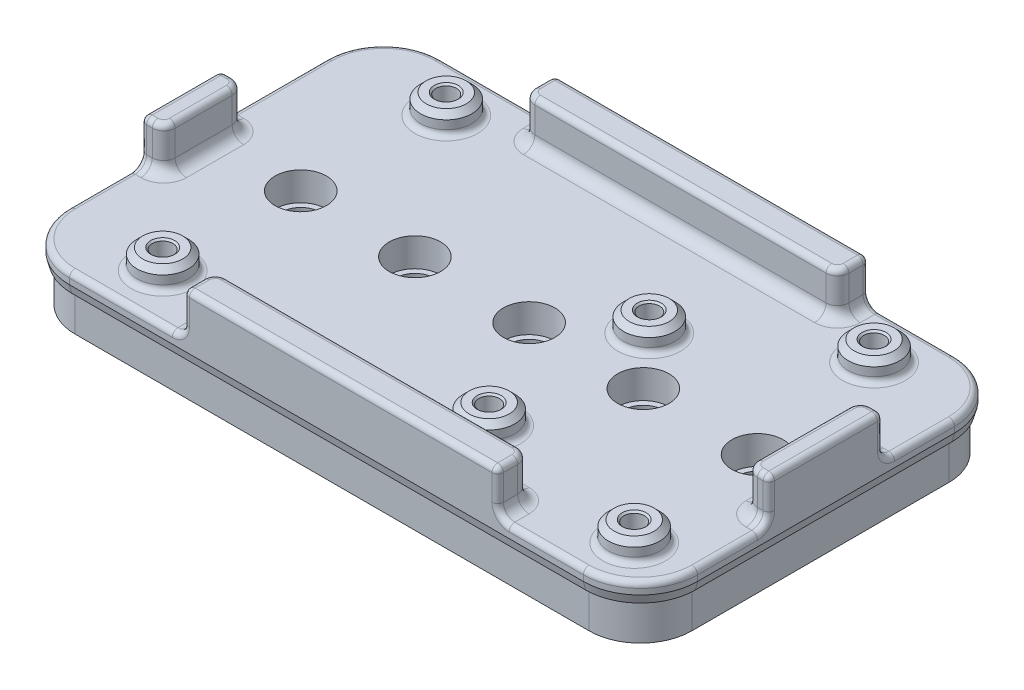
ISO-10303-21;
HEADER;
FILE_DESCRIPTION(('STEP AP214'),'2;1');
FILE_NAME('part.step','',(''),(''),'','','');
FILE_SCHEMA(('AUTOMOTIVE_DESIGN { 1 0 10303 214 1 1 1 1 }'));
ENDSEC;
DATA;
#1=APPLICATION_CONTEXT('core data for automotive mechanical design processes');
#2=APPLICATION_PROTOCOL_DEFINITION('international standard','automotive_design',2000,#1);
#3=PRODUCT_CONTEXT('',#1,'mechanical');
#4=PRODUCT('Part','Part','',(#3));
#5=PRODUCT_RELATED_PRODUCT_CATEGORY('part','',(#4));
#6=PRODUCT_DEFINITION_FORMATION('','',#4);
#7=PRODUCT_DEFINITION_CONTEXT('part definition',#1,'design');
#8=PRODUCT_DEFINITION('design','',#6,#7);
#9=PRODUCT_DEFINITION_SHAPE('','',#8);
#10=(LENGTH_UNIT() NAMED_UNIT(*) SI_UNIT(.MILLI.,.METRE.));
#11=(NAMED_UNIT(*) PLANE_ANGLE_UNIT() SI_UNIT($,.RADIAN.));
#12=(NAMED_UNIT(*) SI_UNIT($,.STERADIAN.) SOLID_ANGLE_UNIT());
#13=UNCERTAINTY_MEASURE_WITH_UNIT(LENGTH_MEASURE(1.E-05),#10,'distance_accuracy_value','');
#14=(GEOMETRIC_REPRESENTATION_CONTEXT(3) GLOBAL_UNCERTAINTY_ASSIGNED_CONTEXT((#13)) GLOBAL_UNIT_ASSIGNED_CONTEXT((#10,
#11,#12)) REPRESENTATION_CONTEXT('',''));
#15=CARTESIAN_POINT('',(0.,0.,0.));
#16=DIRECTION('',(0.,0.,1.));
#17=DIRECTION('',(1.,0.,0.));
#18=AXIS2_PLACEMENT_3D('',#15,#16,#17);
#19=CARTESIAN_POINT('',(45.58,3.5,24.18));
#20=DIRECTION('',(0.,-1.,0.));
#21=DIRECTION('',(0.,0.,-1.));
#22=AXIS2_PLACEMENT_3D('',#19,#20,#21);
#23=CYLINDRICAL_SURFACE('',#22,1.8);
#24=CARTESIAN_POINT('',(45.58,6.69999999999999,24.18));
#25=DIRECTION('',(0.,1.,0.));
#26=DIRECTION('',(0.,0.,1.));
#27=AXIS2_PLACEMENT_3D('',#24,#25,#26);
#28=CIRCLE('',#27,1.8);
#29=CARTESIAN_POINT('',(45.58,6.69999999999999,25.98));
#30=VERTEX_POINT('',#29);
#31=EDGE_CURVE('E648',#30,#30,#28,.T.);
#32=ORIENTED_EDGE('',*,*,#31,.T.);
#33=EDGE_LOOP('',(#32));
#34=FACE_BOUND('',#33,.T.);
#35=CARTESIAN_POINT('',(45.58,0.5,24.18));
#36=DIRECTION('',(0.,-1.,0.));
#37=DIRECTION('',(0.,0.,-1.));
#38=AXIS2_PLACEMENT_3D('',#35,#36,#37);
#39=CIRCLE('',#38,1.8);
#40=CARTESIAN_POINT('',(45.58,0.5,22.38));
#41=VERTEX_POINT('',#40);
#42=EDGE_CURVE('E40',#41,#41,#39,.T.);
#43=ORIENTED_EDGE('',*,*,#42,.T.);
#44=EDGE_LOOP('',(#43));
#45=FACE_BOUND('',#44,.T.);
#46=ADVANCED_FACE('F36',(#34,#45),#23,.F.);
#47=CARTESIAN_POINT('',(15.1,3.5,-8.94));
#48=DIRECTION('',(0.,-1.,0.));
#49=DIRECTION('',(0.,0.,-1.));
#50=AXIS2_PLACEMENT_3D('',#47,#48,#49);
#51=CYLINDRICAL_SURFACE('',#50,1.8);
#52=CARTESIAN_POINT('',(15.1,6.69999999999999,-8.94));
#53=DIRECTION('',(0.,1.,0.));
#54=DIRECTION('',(0.,0.,1.));
#55=AXIS2_PLACEMENT_3D('',#52,#53,#54);
#56=CIRCLE('',#55,1.8);
#57=CARTESIAN_POINT('',(15.1,6.69999999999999,-7.14));
#58=VERTEX_POINT('',#57);
#59=EDGE_CURVE('E666',#58,#58,#56,.T.);
#60=ORIENTED_EDGE('',*,*,#59,.T.);
#61=EDGE_LOOP('',(#60));
#62=FACE_BOUND('',#61,.T.);
#63=CARTESIAN_POINT('',(15.1,0.5,-8.94));
#64=DIRECTION('',(0.,-1.,0.));
#65=DIRECTION('',(0.,0.,-1.));
#66=AXIS2_PLACEMENT_3D('',#63,#64,#65);
#67=CIRCLE('',#66,1.8);
#68=CARTESIAN_POINT('',(15.1,0.5,-10.74));
#69=VERTEX_POINT('',#68);
#70=EDGE_CURVE('E1397',#69,#69,#67,.T.);
#71=ORIENTED_EDGE('',*,*,#70,.T.);
#72=EDGE_LOOP('',(#71));
#73=FACE_BOUND('',#72,.T.);
#74=ADVANCED_FACE('F1533',(#62,#73),#51,.F.);
#75=CARTESIAN_POINT('',(39.23,3.5,-24.18));
#76=DIRECTION('',(0.,-1.,0.));
#77=DIRECTION('',(0.,0.,-1.));
#78=AXIS2_PLACEMENT_3D('',#75,#76,#77);
#79=CYLINDRICAL_SURFACE('',#78,1.8);
#80=CARTESIAN_POINT('',(39.23,6.69999999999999,-24.18));
#81=DIRECTION('',(0.,1.,0.));
#82=DIRECTION('',(0.,0.,1.));
#83=AXIS2_PLACEMENT_3D('',#80,#81,#82);
#84=CIRCLE('',#83,1.8);
#85=CARTESIAN_POINT('',(39.23,6.69999999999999,-22.38));
#86=VERTEX_POINT('',#85);
#87=EDGE_CURVE('E654',#86,#86,#84,.T.);
#88=ORIENTED_EDGE('',*,*,#87,.T.);
#89=EDGE_LOOP('',(#88));
#90=FACE_BOUND('',#89,.T.);
#91=CARTESIAN_POINT('',(39.23,0.5,-24.18));
#92=DIRECTION('',(0.,-1.,0.));
#93=DIRECTION('',(0.,0.,-1.));
#94=AXIS2_PLACEMENT_3D('',#91,#92,#93);
#95=CIRCLE('',#94,1.8);
#96=CARTESIAN_POINT('',(39.23,0.5,-25.98));
#97=VERTEX_POINT('',#96);
#98=EDGE_CURVE('E1395',#97,#97,#95,.T.);
#99=ORIENTED_EDGE('',*,*,#98,.T.);
#100=EDGE_LOOP('',(#99));
#101=FACE_BOUND('',#100,.T.);
#102=ADVANCED_FACE('F1539',(#90,#101),#79,.F.);
#103=CARTESIAN_POINT('',(-35.7,3.5,-24.18));
#104=DIRECTION('',(0.,-1.,0.));
#105=DIRECTION('',(0.,0.,-1.));
#106=AXIS2_PLACEMENT_3D('',#103,#104,#105);
#107=CYLINDRICAL_SURFACE('',#106,1.8);
#108=CARTESIAN_POINT('',(-35.7,6.69999999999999,-24.18));
#109=DIRECTION('',(0.,1.,0.));
#110=DIRECTION('',(0.,0.,1.));
#111=AXIS2_PLACEMENT_3D('',#108,#109,#110);
#112=CIRCLE('',#111,1.8);
#113=CARTESIAN_POINT('',(-35.7,6.69999999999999,-22.38));
#114=VERTEX_POINT('',#113);
#115=EDGE_CURVE('E678',#114,#114,#112,.T.);
#116=ORIENTED_EDGE('',*,*,#115,.T.);
#117=EDGE_LOOP('',(#116));
#118=FACE_BOUND('',#117,.T.);
#119=CARTESIAN_POINT('',(-35.7,0.5,-24.18));
#120=DIRECTION('',(0.,-1.,0.));
#121=DIRECTION('',(0.,0.,-1.));
#122=AXIS2_PLACEMENT_3D('',#119,#120,#121);
#123=CIRCLE('',#122,1.8);
#124=CARTESIAN_POINT('',(-35.7,0.5,-25.98));
#125=VERTEX_POINT('',#124);
#126=EDGE_CURVE('E1391',#125,#125,#123,.T.);
#127=ORIENTED_EDGE('',*,*,#126,.T.);
#128=EDGE_LOOP('',(#127));
#129=FACE_BOUND('',#128,.T.);
#130=ADVANCED_FACE('F2244',(#118,#129),#107,.F.);
#131=CARTESIAN_POINT('',(15.1,3.5,19.1));
#132=DIRECTION('',(0.,-1.,0.));
#133=DIRECTION('',(0.,0.,-1.));
#134=AXIS2_PLACEMENT_3D('',#131,#132,#133);
#135=CYLINDRICAL_SURFACE('',#134,1.8);
#136=CARTESIAN_POINT('',(15.1,6.70000000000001,19.1));
#137=DIRECTION('',(0.,1.,0.));
#138=DIRECTION('',(0.,0.,1.));
#139=AXIS2_PLACEMENT_3D('',#136,#137,#138);
#140=CIRCLE('',#139,1.8);
#141=CARTESIAN_POINT('',(15.1,6.70000000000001,20.9));
#142=VERTEX_POINT('',#141);
#143=EDGE_CURVE('E660',#142,#142,#140,.T.);
#144=ORIENTED_EDGE('',*,*,#143,.T.);
#145=EDGE_LOOP('',(#144));
#146=FACE_BOUND('',#145,.T.);
#147=CARTESIAN_POINT('',(15.1,0.5,19.1));
#148=DIRECTION('',(0.,-1.,0.));
#149=DIRECTION('',(0.,0.,-1.));
#150=AXIS2_PLACEMENT_3D('',#147,#148,#149);
#151=CIRCLE('',#150,1.8);
#152=CARTESIAN_POINT('',(15.1,0.5,17.3));
#153=VERTEX_POINT('',#152);
#154=EDGE_CURVE('E1388',#153,#153,#151,.T.);
#155=ORIENTED_EDGE('',*,*,#154,.T.);
#156=EDGE_LOOP('',(#155));
#157=FACE_BOUND('',#156,.T.);
#158=ADVANCED_FACE('F1548',(#146,#157),#135,.F.);
#159=CARTESIAN_POINT('',(-37.,3.5,24.18));
#160=DIRECTION('',(0.,-1.,0.));
#161=DIRECTION('',(0.,0.,-1.));
#162=AXIS2_PLACEMENT_3D('',#159,#160,#161);
#163=CYLINDRICAL_SURFACE('',#162,1.8);
#164=CARTESIAN_POINT('',(-37.,6.69999999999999,24.18));
#165=DIRECTION('',(0.,1.,0.));
#166=DIRECTION('',(0.,0.,1.));
#167=AXIS2_PLACEMENT_3D('',#164,#165,#166);
#168=CIRCLE('',#167,1.8);
#169=CARTESIAN_POINT('',(-37.,6.69999999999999,25.98));
#170=VERTEX_POINT('',#169);
#171=EDGE_CURVE('E672',#170,#170,#168,.T.);
#172=ORIENTED_EDGE('',*,*,#171,.T.);
#173=EDGE_LOOP('',(#172));
#174=FACE_BOUND('',#173,.T.);
#175=CARTESIAN_POINT('',(-37.,0.5,24.18));
#176=DIRECTION('',(0.,-1.,0.));
#177=DIRECTION('',(0.,0.,-1.));
#178=AXIS2_PLACEMENT_3D('',#175,#176,#177);
#179=CIRCLE('',#178,1.8);
#180=CARTESIAN_POINT('',(-37.,0.5,22.38));
#181=VERTEX_POINT('',#180);
#182=EDGE_CURVE('E1364',#181,#181,#179,.T.);
#183=ORIENTED_EDGE('',*,*,#182,.T.);
#184=EDGE_LOOP('',(#183));
#185=FACE_BOUND('',#184,.T.);
#186=ADVANCED_FACE('F1544',(#174,#185),#163,.F.);
#187=CARTESIAN_POINT('',(-17.,3.5,0.));
#188=DIRECTION('',(0.,-1.,0.));
#189=DIRECTION('',(0.,0.,-1.));
#190=AXIS2_PLACEMENT_3D('',#187,#188,#189);
#191=CYLINDRICAL_SURFACE('',#190,3.5);
#192=CARTESIAN_POINT('',(-17.,-6.5,0.));
#193=DIRECTION('',(0.,-1.,0.));
#194=DIRECTION('',(0.,0.,-1.));
#195=AXIS2_PLACEMENT_3D('',#192,#193,#194);
#196=CIRCLE('',#195,3.5);
#197=CARTESIAN_POINT('',(-17.,-6.5,-3.5));
#198=VERTEX_POINT('',#197);
#199=EDGE_CURVE('E1441',#198,#198,#196,.T.);
#200=ORIENTED_EDGE('',*,*,#199,.T.);
#201=EDGE_LOOP('',(#200));
#202=FACE_BOUND('',#201,.T.);
#203=CARTESIAN_POINT('',(-17.,-1.5,0.));
#204=DIRECTION('',(0.,1.,0.));
#205=DIRECTION('',(0.,0.,1.));
#206=AXIS2_PLACEMENT_3D('',#203,#204,#205);
#207=CIRCLE('',#206,3.5);
#208=CARTESIAN_POINT('',(-17.,-1.5,3.5));
#209=VERTEX_POINT('',#208);
#210=EDGE_CURVE('E1328',#209,#209,#207,.T.);
#211=ORIENTED_EDGE('',*,*,#210,.T.);
#212=EDGE_LOOP('',(#211));
#213=FACE_BOUND('',#212,.T.);
#214=ADVANCED_FACE('F1547',(#202,#213),#191,.F.);
#215=CARTESIAN_POINT('',(3.,3.5,0.));
#216=DIRECTION('',(0.,-1.,0.));
#217=DIRECTION('',(0.,0.,-1.));
#218=AXIS2_PLACEMENT_3D('',#215,#216,#217);
#219=CYLINDRICAL_SURFACE('',#218,3.5);
#220=CARTESIAN_POINT('',(3.,-6.5,0.));
#221=DIRECTION('',(0.,-1.,0.));
#222=DIRECTION('',(0.,0.,-1.));
#223=AXIS2_PLACEMENT_3D('',#220,#221,#222);
#224=CIRCLE('',#223,3.5);
#225=CARTESIAN_POINT('',(3.,-6.5,-3.5));
#226=VERTEX_POINT('',#225);
#227=EDGE_CURVE('E1444',#226,#226,#224,.T.);
#228=ORIENTED_EDGE('',*,*,#227,.T.);
#229=EDGE_LOOP('',(#228));
#230=FACE_BOUND('',#229,.T.);
#231=CARTESIAN_POINT('',(3.,-1.5,0.));
#232=DIRECTION('',(0.,1.,0.));
#233=DIRECTION('',(0.,0.,1.));
#234=AXIS2_PLACEMENT_3D('',#231,#232,#233);
#235=CIRCLE('',#234,3.5);
#236=CARTESIAN_POINT('',(3.,-1.5,3.5));
#237=VERTEX_POINT('',#236);
#238=EDGE_CURVE('E1325',#237,#237,#235,.T.);
#239=ORIENTED_EDGE('',*,*,#238,.T.);
#240=EDGE_LOOP('',(#239));
#241=FACE_BOUND('',#240,.T.);
#242=ADVANCED_FACE('F2231',(#230,#241),#219,.F.);
#243=CARTESIAN_POINT('',(23.,3.5,0.));
#244=DIRECTION('',(0.,-1.,0.));
#245=DIRECTION('',(0.,0.,-1.));
#246=AXIS2_PLACEMENT_3D('',#243,#244,#245);
#247=CYLINDRICAL_SURFACE('',#246,3.5);
#248=CARTESIAN_POINT('',(23.,-6.5,0.));
#249=DIRECTION('',(0.,-1.,0.));
#250=DIRECTION('',(0.,0.,-1.));
#251=AXIS2_PLACEMENT_3D('',#248,#249,#250);
#252=CIRCLE('',#251,3.5);
#253=CARTESIAN_POINT('',(23.,-6.5,-3.50000000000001));
#254=VERTEX_POINT('',#253);
#255=EDGE_CURVE('E1447',#254,#254,#252,.T.);
#256=ORIENTED_EDGE('',*,*,#255,.T.);
#257=EDGE_LOOP('',(#256));
#258=FACE_BOUND('',#257,.T.);
#259=CARTESIAN_POINT('',(23.,-1.5,0.));
#260=DIRECTION('',(0.,1.,0.));
#261=DIRECTION('',(0.,0.,1.));
#262=AXIS2_PLACEMENT_3D('',#259,#260,#261);
#263=CIRCLE('',#262,3.5);
#264=CARTESIAN_POINT('',(23.,-1.5,3.49999999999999));
#265=VERTEX_POINT('',#264);
#266=EDGE_CURVE('E1321',#265,#265,#263,.T.);
#267=ORIENTED_EDGE('',*,*,#266,.T.);
#268=EDGE_LOOP('',(#267));
#269=FACE_BOUND('',#268,.T.);
#270=ADVANCED_FACE('F2227',(#258,#269),#247,.F.);
#271=CARTESIAN_POINT('',(43.,3.5,0.));
#272=DIRECTION('',(0.,-1.,0.));
#273=DIRECTION('',(0.,0.,-1.));
#274=AXIS2_PLACEMENT_3D('',#271,#272,#273);
#275=CYLINDRICAL_SURFACE('',#274,3.5);
#276=CARTESIAN_POINT('',(43.,-6.5,0.));
#277=DIRECTION('',(0.,-1.,0.));
#278=DIRECTION('',(0.,0.,-1.));
#279=AXIS2_PLACEMENT_3D('',#276,#277,#278);
#280=CIRCLE('',#279,3.5);
#281=CARTESIAN_POINT('',(43.,-6.5,-3.50000000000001));
#282=VERTEX_POINT('',#281);
#283=EDGE_CURVE('E1450',#282,#282,#280,.T.);
#284=ORIENTED_EDGE('',*,*,#283,.T.);
#285=EDGE_LOOP('',(#284));
#286=FACE_BOUND('',#285,.T.);
#287=CARTESIAN_POINT('',(43.,-1.5,0.));
#288=DIRECTION('',(0.,1.,0.));
#289=DIRECTION('',(0.,0.,1.));
#290=AXIS2_PLACEMENT_3D('',#287,#288,#289);
#291=CIRCLE('',#290,3.5);
#292=CARTESIAN_POINT('',(43.,-1.5,3.49999999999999));
#293=VERTEX_POINT('',#292);
#294=EDGE_CURVE('E1318',#293,#293,#291,.T.);
#295=ORIENTED_EDGE('',*,*,#294,.T.);
#296=EDGE_LOOP('',(#295));
#297=FACE_BOUND('',#296,.T.);
#298=ADVANCED_FACE('F2224',(#286,#297),#275,.F.);
#299=CARTESIAN_POINT('',(-37.,3.5,0.));
#300=DIRECTION('',(0.,-1.,0.));
#301=DIRECTION('',(0.,0.,-1.));
#302=AXIS2_PLACEMENT_3D('',#299,#300,#301);
#303=CYLINDRICAL_SURFACE('',#302,3.5);
#304=CARTESIAN_POINT('',(-37.,-6.5,0.));
#305=DIRECTION('',(0.,-1.,0.));
#306=DIRECTION('',(0.,0.,-1.));
#307=AXIS2_PLACEMENT_3D('',#304,#305,#306);
#308=CIRCLE('',#307,3.5);
#309=CARTESIAN_POINT('',(-37.,-6.5,-3.5));
#310=VERTEX_POINT('',#309);
#311=EDGE_CURVE('E861',#310,#310,#308,.T.);
#312=ORIENTED_EDGE('',*,*,#311,.T.);
#313=EDGE_LOOP('',(#312));
#314=FACE_BOUND('',#313,.T.);
#315=CARTESIAN_POINT('',(-37.,-1.5,0.));
#316=DIRECTION('',(0.,1.,0.));
#317=DIRECTION('',(0.,0.,1.));
#318=AXIS2_PLACEMENT_3D('',#315,#316,#317);
#319=CIRCLE('',#318,3.5);
#320=CARTESIAN_POINT('',(-37.,-1.5,3.5));
#321=VERTEX_POINT('',#320);
#322=EDGE_CURVE('E1132',#321,#321,#319,.T.);
#323=ORIENTED_EDGE('',*,*,#322,.T.);
#324=EDGE_LOOP('',(#323));
#325=FACE_BOUND('',#324,.T.);
#326=ADVANCED_FACE('F1557',(#314,#325),#303,.F.);
#327=CARTESIAN_POINT('',(-45.,0.,22.5));
#328=DIRECTION('',(0.,1.,0.));
#329=DIRECTION('',(0.,0.,1.));
#330=AXIS2_PLACEMENT_3D('',#327,#328,#329);
#331=PLANE('',#330);
#332=CARTESIAN_POINT('',(-45.,0.,-22.5));
#333=DIRECTION('',(0.,1.,0.));
#334=DIRECTION('',(0.,0.,1.));
#335=AXIS2_PLACEMENT_3D('',#332,#333,#334);
#336=CIRCLE('',#335,9.59807621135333);
#337=CARTESIAN_POINT('',(-54.5980762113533,0.,-22.4999999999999));
#338=VERTEX_POINT('',#337);
#339=CARTESIAN_POINT('',(-44.9999999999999,0.,-32.0980762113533));
#340=VERTEX_POINT('',#339);
#341=EDGE_CURVE('E1346',#338,#340,#336,.F.);
#342=ORIENTED_EDGE('',*,*,#341,.T.);
#343=DIRECTION('',(1.,0.,0.));
#344=VECTOR('',#343,1.);
#345=CARTESIAN_POINT('',(-45.,0.,-32.0980762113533));
#346=LINE('',#345,#344);
#347=CARTESIAN_POINT('',(44.9999999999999,0.,-32.0980762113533));
#348=VERTEX_POINT('',#347);
#349=EDGE_CURVE('E1348',#340,#348,#346,.T.);
#350=ORIENTED_EDGE('',*,*,#349,.T.);
#351=CARTESIAN_POINT('',(45.,0.,-22.5));
#352=DIRECTION('',(0.,1.,0.));
#353=DIRECTION('',(0.,0.,1.));
#354=AXIS2_PLACEMENT_3D('',#351,#352,#353);
#355=CIRCLE('',#354,9.59807621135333);
#356=CARTESIAN_POINT('',(54.5980762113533,0.,-22.4999999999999));
#357=VERTEX_POINT('',#356);
#358=EDGE_CURVE('E1344',#348,#357,#355,.F.);
#359=ORIENTED_EDGE('',*,*,#358,.T.);
#360=DIRECTION('',(0.,0.,1.));
#361=VECTOR('',#360,1.);
#362=CARTESIAN_POINT('',(54.5980762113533,0.,22.5));
#363=LINE('',#362,#361);
#364=CARTESIAN_POINT('',(54.5980762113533,0.,22.4999999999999));
#365=VERTEX_POINT('',#364);
#366=EDGE_CURVE('E1340',#357,#365,#363,.T.);
#367=ORIENTED_EDGE('',*,*,#366,.T.);
#368=CARTESIAN_POINT('',(45.,0.,22.5));
#369=DIRECTION('',(0.,1.,0.));
#370=DIRECTION('',(0.,0.,1.));
#371=AXIS2_PLACEMENT_3D('',#368,#369,#370);
#372=CIRCLE('',#371,9.59807621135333);
#373=CARTESIAN_POINT('',(44.9999999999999,0.,32.0980762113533));
#374=VERTEX_POINT('',#373);
#375=EDGE_CURVE('E1336',#365,#374,#372,.F.);
#376=ORIENTED_EDGE('',*,*,#375,.T.);
#377=DIRECTION('',(-1.,0.,0.));
#378=VECTOR('',#377,1.);
#379=CARTESIAN_POINT('',(-45.,0.,32.0980762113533));
#380=LINE('',#379,#378);
#381=CARTESIAN_POINT('',(-44.9999999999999,0.,32.0980762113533));
#382=VERTEX_POINT('',#381);
#383=EDGE_CURVE('E1334',#374,#382,#380,.T.);
#384=ORIENTED_EDGE('',*,*,#383,.T.);
#385=CARTESIAN_POINT('',(-45.,0.,22.5));
#386=DIRECTION('',(0.,1.,0.));
#387=DIRECTION('',(0.,0.,1.));
#388=AXIS2_PLACEMENT_3D('',#385,#386,#387);
#389=CIRCLE('',#388,9.59807621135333);
#390=CARTESIAN_POINT('',(-54.5980762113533,0.,22.4999999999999));
#391=VERTEX_POINT('',#390);
#392=EDGE_CURVE('E1338',#382,#391,#389,.F.);
#393=ORIENTED_EDGE('',*,*,#392,.T.);
#394=DIRECTION('',(0.,0.,-1.));
#395=VECTOR('',#394,1.);
#396=CARTESIAN_POINT('',(-54.5980762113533,0.,22.5));
#397=LINE('',#396,#395);
#398=EDGE_CURVE('E1342',#391,#338,#397,.T.);
#399=ORIENTED_EDGE('',*,*,#398,.T.);
#400=EDGE_LOOP('',(#342,#350,#359,#367,#376,#384,#393,#399));
#401=FACE_BOUND('',#400,.T.);
#402=CARTESIAN_POINT('',(-45.,0.,-22.5));
#403=DIRECTION('',(0.,-1.,0.));
#404=DIRECTION('',(0.,0.,-1.));
#405=AXIS2_PLACEMENT_3D('',#402,#403,#404);
#406=CIRCLE('',#405,9.);
#407=CARTESIAN_POINT('',(-54.,0.,-22.4999999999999));
#408=VERTEX_POINT('',#407);
#409=CARTESIAN_POINT('',(-44.9999999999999,0.,-31.5));
#410=VERTEX_POINT('',#409);
#411=EDGE_CURVE('E585',#408,#410,#406,.T.);
#412=ORIENTED_EDGE('',*,*,#411,.F.);
#413=DIRECTION('',(0.,0.,-1.));
#414=VECTOR('',#413,1.);
#415=CARTESIAN_POINT('',(-54.,0.,-22.4999999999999));
#416=LINE('',#415,#414);
#417=CARTESIAN_POINT('',(-54.,0.,22.4999999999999));
#418=VERTEX_POINT('',#417);
#419=EDGE_CURVE('E582',#418,#408,#416,.T.);
#420=ORIENTED_EDGE('',*,*,#419,.F.);
#421=CARTESIAN_POINT('',(-45.,0.,22.5));
#422=DIRECTION('',(0.,-1.,0.));
#423=DIRECTION('',(0.,0.,-1.));
#424=AXIS2_PLACEMENT_3D('',#421,#422,#423);
#425=CIRCLE('',#424,9.);
#426=CARTESIAN_POINT('',(-45.,0.,31.5));
#427=VERTEX_POINT('',#426);
#428=EDGE_CURVE('E1479',#427,#418,#425,.T.);
#429=ORIENTED_EDGE('',*,*,#428,.F.);
#430=DIRECTION('',(-1.,0.,0.));
#431=VECTOR('',#430,1.);
#432=CARTESIAN_POINT('',(-44.9999999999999,0.,31.5));
#433=LINE('',#432,#431);
#434=CARTESIAN_POINT('',(44.9999999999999,0.,31.5));
#435=VERTEX_POINT('',#434);
#436=EDGE_CURVE('E1476',#435,#427,#433,.T.);
#437=ORIENTED_EDGE('',*,*,#436,.F.);
#438=CARTESIAN_POINT('',(45.,0.,22.5));
#439=DIRECTION('',(0.,-1.,0.));
#440=DIRECTION('',(0.,0.,-1.));
#441=AXIS2_PLACEMENT_3D('',#438,#439,#440);
#442=CIRCLE('',#441,9.);
#443=CARTESIAN_POINT('',(54.,0.,22.4999999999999));
#444=VERTEX_POINT('',#443);
#445=EDGE_CURVE('E1473',#444,#435,#442,.T.);
#446=ORIENTED_EDGE('',*,*,#445,.F.);
#447=DIRECTION('',(0.,0.,1.));
#448=VECTOR('',#447,1.);
#449=CARTESIAN_POINT('',(54.,0.,22.4999999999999));
#450=LINE('',#449,#448);
#451=CARTESIAN_POINT('',(54.,0.,-22.5));
#452=VERTEX_POINT('',#451);
#453=EDGE_CURVE('E1470',#452,#444,#450,.T.);
#454=ORIENTED_EDGE('',*,*,#453,.F.);
#455=CARTESIAN_POINT('',(45.,0.,-22.5));
#456=DIRECTION('',(0.,-1.,0.));
#457=DIRECTION('',(0.,0.,-1.));
#458=AXIS2_PLACEMENT_3D('',#455,#456,#457);
#459=CIRCLE('',#458,9.);
#460=CARTESIAN_POINT('',(44.9999999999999,0.,-31.5));
#461=VERTEX_POINT('',#460);
#462=EDGE_CURVE('E1467',#461,#452,#459,.T.);
#463=ORIENTED_EDGE('',*,*,#462,.F.);
#464=DIRECTION('',(1.,0.,0.));
#465=VECTOR('',#464,1.);
#466=CARTESIAN_POINT('',(44.9999999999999,0.,-31.5));
#467=LINE('',#466,#465);
#468=EDGE_CURVE('E1465',#410,#461,#467,.T.);
#469=ORIENTED_EDGE('',*,*,#468,.F.);
#470=EDGE_LOOP('',(#412,#420,#429,#437,#446,#454,#463,#469));
#471=FACE_BOUND('',#470,.T.);
#472=ADVANCED_FACE('F1505',(#401,#471),#331,.F.);
#473=CARTESIAN_POINT('',(-45.,3.5,22.5));
#474=DIRECTION('',(0.,1.,0.));
#475=DIRECTION('',(0.,0.,1.));
#476=AXIS2_PLACEMENT_3D('',#473,#474,#475);
#477=PLANE('',#476);
#478=CARTESIAN_POINT('',(-17.,3.5,0.));
#479=DIRECTION('',(0.,1.,0.));
#480=DIRECTION('',(0.,0.,1.));
#481=AXIS2_PLACEMENT_3D('',#478,#479,#480);
#482=CIRCLE('',#481,4.5);
#483=CARTESIAN_POINT('',(-17.,3.5,4.5));
#484=VERTEX_POINT('',#483);
#485=EDGE_CURVE('E1415',#484,#484,#482,.T.);
#486=ORIENTED_EDGE('',*,*,#485,.F.);
#487=EDGE_LOOP('',(#486));
#488=FACE_BOUND('',#487,.T.);
#489=CARTESIAN_POINT('',(3.,3.5,0.));
#490=DIRECTION('',(0.,1.,0.));
#491=DIRECTION('',(0.,0.,1.));
#492=AXIS2_PLACEMENT_3D('',#489,#490,#491);
#493=CIRCLE('',#492,4.5);
#494=CARTESIAN_POINT('',(3.,3.5,4.5));
#495=VERTEX_POINT('',#494);
#496=EDGE_CURVE('E1421',#495,#495,#493,.T.);
#497=ORIENTED_EDGE('',*,*,#496,.F.);
#498=EDGE_LOOP('',(#497));
#499=FACE_BOUND('',#498,.T.);
#500=CARTESIAN_POINT('',(23.,3.5,0.));
#501=DIRECTION('',(0.,1.,0.));
#502=DIRECTION('',(0.,0.,1.));
#503=AXIS2_PLACEMENT_3D('',#500,#501,#502);
#504=CIRCLE('',#503,4.5);
#505=CARTESIAN_POINT('',(23.,3.5,4.5));
#506=VERTEX_POINT('',#505);
#507=EDGE_CURVE('E1427',#506,#506,#504,.T.);
#508=ORIENTED_EDGE('',*,*,#507,.F.);
#509=EDGE_LOOP('',(#508));
#510=FACE_BOUND('',#509,.T.);
#511=CARTESIAN_POINT('',(43.,3.5,0.));
#512=DIRECTION('',(0.,1.,0.));
#513=DIRECTION('',(0.,0.,1.));
#514=AXIS2_PLACEMENT_3D('',#511,#512,#513);
#515=CIRCLE('',#514,4.5);
#516=CARTESIAN_POINT('',(43.,3.5,4.49999999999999));
#517=VERTEX_POINT('',#516);
#518=EDGE_CURVE('E1384',#517,#517,#515,.T.);
#519=ORIENTED_EDGE('',*,*,#518,.F.);
#520=EDGE_LOOP('',(#519));
#521=FACE_BOUND('',#520,.T.);
#522=CARTESIAN_POINT('',(-37.,3.5,0.));
#523=DIRECTION('',(0.,1.,0.));
#524=DIRECTION('',(0.,0.,1.));
#525=AXIS2_PLACEMENT_3D('',#522,#523,#524);
#526=CIRCLE('',#525,4.5);
#527=CARTESIAN_POINT('',(-37.,3.5,4.5));
#528=VERTEX_POINT('',#527);
#529=EDGE_CURVE('E1331',#528,#528,#526,.T.);
#530=ORIENTED_EDGE('',*,*,#529,.F.);
#531=EDGE_LOOP('',(#530));
#532=FACE_BOUND('',#531,.T.);
#533=CARTESIAN_POINT('',(45.,3.5,-22.5));
#534=DIRECTION('',(0.,1.,0.));
#535=DIRECTION('',(0.,0.,1.));
#536=AXIS2_PLACEMENT_3D('',#533,#534,#535);
#537=CIRCLE('',#536,9.);
#538=CARTESIAN_POINT('',(54.,3.5,-22.4999999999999));
#539=VERTEX_POINT('',#538);
#540=CARTESIAN_POINT('',(44.9999999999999,3.5,-31.5));
#541=VERTEX_POINT('',#540);
#542=EDGE_CURVE('E976',#539,#541,#537,.T.);
#543=ORIENTED_EDGE('',*,*,#542,.T.);
#544=DIRECTION('',(-1.,0.,0.));
#545=VECTOR('',#544,1.);
#546=CARTESIAN_POINT('',(32.,3.5,-31.5));
#547=LINE('',#546,#545);
#548=CARTESIAN_POINT('',(32.,3.5,-31.5));
#549=VERTEX_POINT('',#548);
#550=EDGE_CURVE('E978',#541,#549,#547,.T.);
#551=ORIENTED_EDGE('',*,*,#550,.T.);
#552=DIRECTION('',(0.,0.,-1.));
#553=VECTOR('',#552,1.);
#554=CARTESIAN_POINT('',(32.,3.5,22.5));
#555=LINE('',#554,#553);
#556=CARTESIAN_POINT('',(32.,3.5,-29.));
#557=VERTEX_POINT('',#556);
#558=EDGE_CURVE('E744',#549,#557,#555,.F.);
#559=ORIENTED_EDGE('',*,*,#558,.T.);
#560=CARTESIAN_POINT('',(28.,3.5,-29.));
#561=DIRECTION('',(0.,1.,0.));
#562=DIRECTION('',(0.,0.,1.));
#563=AXIS2_PLACEMENT_3D('',#560,#561,#562);
#564=CIRCLE('',#563,4.);
#565=CARTESIAN_POINT('',(28.,3.5,-25.));
#566=VERTEX_POINT('',#565);
#567=EDGE_CURVE('E741',#566,#557,#564,.T.);
#568=ORIENTED_EDGE('',*,*,#567,.F.);
#569=DIRECTION('',(1.,0.,0.));
#570=VECTOR('',#569,1.);
#571=CARTESIAN_POINT('',(-45.,3.5,-25.));
#572=LINE('',#571,#570);
#573=CARTESIAN_POINT('',(-23.,3.5,-25.));
#574=VERTEX_POINT('',#573);
#575=EDGE_CURVE('E746',#566,#574,#572,.F.);
#576=ORIENTED_EDGE('',*,*,#575,.T.);
#577=CARTESIAN_POINT('',(-23.,3.5,-29.));
#578=DIRECTION('',(0.,1.,0.));
#579=DIRECTION('',(0.,0.,1.));
#580=AXIS2_PLACEMENT_3D('',#577,#578,#579);
#581=CIRCLE('',#580,4.);
#582=CARTESIAN_POINT('',(-27.,3.5,-29.));
#583=VERTEX_POINT('',#582);
#584=EDGE_CURVE('E748',#583,#574,#581,.T.);
#585=ORIENTED_EDGE('',*,*,#584,.F.);
#586=DIRECTION('',(0.,0.,1.));
#587=VECTOR('',#586,1.);
#588=CARTESIAN_POINT('',(-27.0000000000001,3.5,22.5));
#589=LINE('',#588,#587);
#590=CARTESIAN_POINT('',(-27.,3.5,-31.5));
#591=VERTEX_POINT('',#590);
#592=EDGE_CURVE('E751',#583,#591,#589,.F.);
#593=ORIENTED_EDGE('',*,*,#592,.T.);
#594=DIRECTION('',(-1.,0.,0.));
#595=VECTOR('',#594,1.);
#596=CARTESIAN_POINT('',(-44.9999999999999,3.5,-31.5));
#597=LINE('',#596,#595);
#598=CARTESIAN_POINT('',(-44.9999999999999,3.5,-31.5));
#599=VERTEX_POINT('',#598);
#600=EDGE_CURVE('E956',#591,#599,#597,.T.);
#601=ORIENTED_EDGE('',*,*,#600,.T.);
#602=CARTESIAN_POINT('',(-45.,3.5,-22.5));
#603=DIRECTION('',(0.,1.,0.));
#604=DIRECTION('',(0.,0.,1.));
#605=AXIS2_PLACEMENT_3D('',#602,#603,#604);
#606=CIRCLE('',#605,9.);
#607=CARTESIAN_POINT('',(-54.,3.5,-22.4999999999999));
#608=VERTEX_POINT('',#607);
#609=EDGE_CURVE('E958',#599,#608,#606,.T.);
#610=ORIENTED_EDGE('',*,*,#609,.T.);
#611=DIRECTION('',(0.,0.,1.));
#612=VECTOR('',#611,1.);
#613=CARTESIAN_POINT('',(-54.,3.5,-6.));
#614=LINE('',#613,#612);
#615=CARTESIAN_POINT('',(-54.,3.5,-6.));
#616=VERTEX_POINT('',#615);
#617=EDGE_CURVE('E960',#608,#616,#614,.T.);
#618=ORIENTED_EDGE('',*,*,#617,.T.);
#619=DIRECTION('',(-1.,0.,0.));
#620=VECTOR('',#619,1.);
#621=CARTESIAN_POINT('',(-45.,3.5,-6.));
#622=LINE('',#621,#620);
#623=CARTESIAN_POINT('',(-53.,3.5,-6.));
#624=VERTEX_POINT('',#623);
#625=EDGE_CURVE('E778',#616,#624,#622,.F.);
#626=ORIENTED_EDGE('',*,*,#625,.T.);
#627=CARTESIAN_POINT('',(-53.,3.5,-2.));
#628=DIRECTION('',(0.,1.,0.));
#629=DIRECTION('',(0.,0.,1.));
#630=AXIS2_PLACEMENT_3D('',#627,#628,#629);
#631=CIRCLE('',#630,4.);
#632=CARTESIAN_POINT('',(-49.,3.5,-2.));
#633=VERTEX_POINT('',#632);
#634=EDGE_CURVE('E775',#633,#624,#631,.T.);
#635=ORIENTED_EDGE('',*,*,#634,.F.);
#636=DIRECTION('',(0.,0.,-1.));
#637=VECTOR('',#636,1.);
#638=CARTESIAN_POINT('',(-49.,3.5,22.5));
#639=LINE('',#638,#637);
#640=CARTESIAN_POINT('',(-49.,3.5,8.));
#641=VERTEX_POINT('',#640);
#642=EDGE_CURVE('E770',#633,#641,#639,.F.);
#643=ORIENTED_EDGE('',*,*,#642,.T.);
#644=CARTESIAN_POINT('',(-53.,3.5,8.));
#645=DIRECTION('',(0.,1.,0.));
#646=DIRECTION('',(0.,0.,1.));
#647=AXIS2_PLACEMENT_3D('',#644,#645,#646);
#648=CIRCLE('',#647,4.);
#649=CARTESIAN_POINT('',(-53.,3.5,12.));
#650=VERTEX_POINT('',#649);
#651=EDGE_CURVE('E767',#650,#641,#648,.T.);
#652=ORIENTED_EDGE('',*,*,#651,.F.);
#653=DIRECTION('',(1.,0.,0.));
#654=VECTOR('',#653,1.);
#655=CARTESIAN_POINT('',(-45.,3.5,12.));
#656=LINE('',#655,#654);
#657=CARTESIAN_POINT('',(-54.,3.5,12.));
#658=VERTEX_POINT('',#657);
#659=EDGE_CURVE('E772',#650,#658,#656,.F.);
#660=ORIENTED_EDGE('',*,*,#659,.T.);
#661=DIRECTION('',(0.,0.,1.));
#662=VECTOR('',#661,1.);
#663=CARTESIAN_POINT('',(-54.,3.5,22.4999999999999));
#664=LINE('',#663,#662);
#665=CARTESIAN_POINT('',(-54.,3.5,22.4999999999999));
#666=VERTEX_POINT('',#665);
#667=EDGE_CURVE('E962',#658,#666,#664,.T.);
#668=ORIENTED_EDGE('',*,*,#667,.T.);
#669=CARTESIAN_POINT('',(-45.,3.5,22.5));
#670=DIRECTION('',(0.,1.,0.));
#671=DIRECTION('',(0.,0.,1.));
#672=AXIS2_PLACEMENT_3D('',#669,#670,#671);
#673=CIRCLE('',#672,9.);
#674=CARTESIAN_POINT('',(-44.9999999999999,3.5,31.5));
#675=VERTEX_POINT('',#674);
#676=EDGE_CURVE('E964',#666,#675,#673,.T.);
#677=ORIENTED_EDGE('',*,*,#676,.T.);
#678=DIRECTION('',(1.,0.,0.));
#679=VECTOR('',#678,1.);
#680=CARTESIAN_POINT('',(-27.,3.5,31.5));
#681=LINE('',#680,#679);
#682=CARTESIAN_POINT('',(-27.,3.5,31.5));
#683=VERTEX_POINT('',#682);
#684=EDGE_CURVE('E966',#675,#683,#681,.T.);
#685=ORIENTED_EDGE('',*,*,#684,.T.);
#686=DIRECTION('',(0.,0.,1.));
#687=VECTOR('',#686,1.);
#688=CARTESIAN_POINT('',(-27.,3.5,22.5));
#689=LINE('',#688,#687);
#690=CARTESIAN_POINT('',(-27.,3.5,29.));
#691=VERTEX_POINT('',#690);
#692=EDGE_CURVE('E765',#683,#691,#689,.F.);
#693=ORIENTED_EDGE('',*,*,#692,.T.);
#694=CARTESIAN_POINT('',(-23.,3.5,29.));
#695=DIRECTION('',(0.,1.,0.));
#696=DIRECTION('',(0.,0.,1.));
#697=AXIS2_PLACEMENT_3D('',#694,#695,#696);
#698=CIRCLE('',#697,4.);
#699=CARTESIAN_POINT('',(-23.,3.5,25.));
#700=VERTEX_POINT('',#699);
#701=EDGE_CURVE('E762',#700,#691,#698,.T.);
#702=ORIENTED_EDGE('',*,*,#701,.F.);
#703=DIRECTION('',(-1.,0.,0.));
#704=VECTOR('',#703,1.);
#705=CARTESIAN_POINT('',(-45.,3.5,25.));
#706=LINE('',#705,#704);
#707=CARTESIAN_POINT('',(28.,3.5,25.));
#708=VERTEX_POINT('',#707);
#709=EDGE_CURVE('E757',#700,#708,#706,.F.);
#710=ORIENTED_EDGE('',*,*,#709,.T.);
#711=CARTESIAN_POINT('',(28.,3.5,29.));
#712=DIRECTION('',(0.,1.,0.));
#713=DIRECTION('',(0.,0.,1.));
#714=AXIS2_PLACEMENT_3D('',#711,#712,#713);
#715=CIRCLE('',#714,4.);
#716=CARTESIAN_POINT('',(32.,3.5,29.));
#717=VERTEX_POINT('',#716);
#718=EDGE_CURVE('E754',#717,#708,#715,.T.);
#719=ORIENTED_EDGE('',*,*,#718,.F.);
#720=DIRECTION('',(0.,0.,-1.));
#721=VECTOR('',#720,1.);
#722=CARTESIAN_POINT('',(32.,3.5,22.5));
#723=LINE('',#722,#721);
#724=CARTESIAN_POINT('',(32.,3.5,31.5));
#725=VERTEX_POINT('',#724);
#726=EDGE_CURVE('E759',#717,#725,#723,.F.);
#727=ORIENTED_EDGE('',*,*,#726,.T.);
#728=DIRECTION('',(1.,0.,0.));
#729=VECTOR('',#728,1.);
#730=CARTESIAN_POINT('',(44.9999999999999,3.5,31.5));
#731=LINE('',#730,#729);
#732=CARTESIAN_POINT('',(44.9999999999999,3.5,31.5));
#733=VERTEX_POINT('',#732);
#734=EDGE_CURVE('E968',#725,#733,#731,.T.);
#735=ORIENTED_EDGE('',*,*,#734,.T.);
#736=CARTESIAN_POINT('',(45.,3.5,22.5));
#737=DIRECTION('',(0.,1.,0.));
#738=DIRECTION('',(0.,0.,1.));
#739=AXIS2_PLACEMENT_3D('',#736,#737,#738);
#740=CIRCLE('',#739,9.);
#741=CARTESIAN_POINT('',(54.,3.5,22.4999999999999));
#742=VERTEX_POINT('',#741);
#743=EDGE_CURVE('E970',#733,#742,#740,.T.);
#744=ORIENTED_EDGE('',*,*,#743,.T.);
#745=DIRECTION('',(0.,0.,-1.));
#746=VECTOR('',#745,1.);
#747=CARTESIAN_POINT('',(54.,3.5,12.));
#748=LINE('',#747,#746);
#749=CARTESIAN_POINT('',(54.,3.5,12.));
#750=VERTEX_POINT('',#749);
#751=EDGE_CURVE('E972',#742,#750,#748,.T.);
#752=ORIENTED_EDGE('',*,*,#751,.T.);
#753=DIRECTION('',(1.,0.,0.));
#754=VECTOR('',#753,1.);
#755=CARTESIAN_POINT('',(-45.,3.5,12.));
#756=LINE('',#755,#754);
#757=CARTESIAN_POINT('',(53.,3.5,12.));
#758=VERTEX_POINT('',#757);
#759=EDGE_CURVE('E739',#750,#758,#756,.F.);
#760=ORIENTED_EDGE('',*,*,#759,.T.);
#761=CARTESIAN_POINT('',(53.,3.5,8.));
#762=DIRECTION('',(0.,1.,0.));
#763=DIRECTION('',(0.,0.,1.));
#764=AXIS2_PLACEMENT_3D('',#761,#762,#763);
#765=CIRCLE('',#764,4.);
#766=CARTESIAN_POINT('',(49.,3.5,8.));
#767=VERTEX_POINT('',#766);
#768=EDGE_CURVE('E736',#767,#758,#765,.T.);
#769=ORIENTED_EDGE('',*,*,#768,.F.);
#770=DIRECTION('',(0.,0.,1.));
#771=VECTOR('',#770,1.);
#772=CARTESIAN_POINT('',(49.,3.5,22.5));
#773=LINE('',#772,#771);
#774=CARTESIAN_POINT('',(49.,3.5,-8.));
#775=VERTEX_POINT('',#774);
#776=EDGE_CURVE('E734',#767,#775,#773,.F.);
#777=ORIENTED_EDGE('',*,*,#776,.T.);
#778=CARTESIAN_POINT('',(53.,3.5,-8.));
#779=DIRECTION('',(0.,1.,0.));
#780=DIRECTION('',(0.,0.,1.));
#781=AXIS2_PLACEMENT_3D('',#778,#779,#780);
#782=CIRCLE('',#781,4.);
#783=CARTESIAN_POINT('',(53.,3.5,-12.));
#784=VERTEX_POINT('',#783);
#785=EDGE_CURVE('E731',#784,#775,#782,.T.);
#786=ORIENTED_EDGE('',*,*,#785,.F.);
#787=DIRECTION('',(-1.,0.,0.));
#788=VECTOR('',#787,1.);
#789=CARTESIAN_POINT('',(-45.,3.5,-12.));
#790=LINE('',#789,#788);
#791=CARTESIAN_POINT('',(54.,3.5,-12.));
#792=VERTEX_POINT('',#791);
#793=EDGE_CURVE('E728',#784,#792,#790,.F.);
#794=ORIENTED_EDGE('',*,*,#793,.T.);
#795=DIRECTION('',(0.,0.,-1.));
#796=VECTOR('',#795,1.);
#797=CARTESIAN_POINT('',(54.,3.5,-22.4999999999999));
#798=LINE('',#797,#796);
#799=EDGE_CURVE('E974',#792,#539,#798,.T.);
#800=ORIENTED_EDGE('',*,*,#799,.T.);
#801=EDGE_LOOP('',(#543,#551,#559,#568,#576,#585,#593,#601,#610,#618,#626,#635,#643,#652,#660,
#668,#677,#685,#693,#702,#710,#719,#727,#735,#744,#752,#760,#769,#777,#786,#794,#800));
#802=FACE_BOUND('',#801,.T.);
#803=CARTESIAN_POINT('',(15.1,3.5,19.1));
#804=DIRECTION('',(0.,1.,0.));
#805=DIRECTION('',(0.,0.,1.));
#806=AXIS2_PLACEMENT_3D('',#803,#804,#805);
#807=CIRCLE('',#806,5.5);
#808=CARTESIAN_POINT('',(15.1,3.5,24.6));
#809=VERTEX_POINT('',#808);
#810=EDGE_CURVE('E702',#809,#809,#807,.F.);
#811=ORIENTED_EDGE('',*,*,#810,.T.);
#812=EDGE_LOOP('',(#811));
#813=FACE_BOUND('',#812,.T.);
#814=CARTESIAN_POINT('',(45.58,3.5,24.18));
#815=DIRECTION('',(0.,1.,0.));
#816=DIRECTION('',(0.,0.,1.));
#817=AXIS2_PLACEMENT_3D('',#814,#815,#816);
#818=CIRCLE('',#817,5.5);
#819=CARTESIAN_POINT('',(45.58,3.5,29.68));
#820=VERTEX_POINT('',#819);
#821=EDGE_CURVE('E699',#820,#820,#818,.F.);
#822=ORIENTED_EDGE('',*,*,#821,.T.);
#823=EDGE_LOOP('',(#822));
#824=FACE_BOUND('',#823,.T.);
#825=CARTESIAN_POINT('',(39.23,3.5,-24.18));
#826=DIRECTION('',(0.,1.,0.));
#827=DIRECTION('',(0.,0.,1.));
#828=AXIS2_PLACEMENT_3D('',#825,#826,#827);
#829=CIRCLE('',#828,5.5);
#830=CARTESIAN_POINT('',(39.23,3.5,-18.68));
#831=VERTEX_POINT('',#830);
#832=EDGE_CURVE('E696',#831,#831,#829,.F.);
#833=ORIENTED_EDGE('',*,*,#832,.T.);
#834=EDGE_LOOP('',(#833));
#835=FACE_BOUND('',#834,.T.);
#836=CARTESIAN_POINT('',(15.1,3.5,-8.94));
#837=DIRECTION('',(0.,1.,0.));
#838=DIRECTION('',(0.,0.,1.));
#839=AXIS2_PLACEMENT_3D('',#836,#837,#838);
#840=CIRCLE('',#839,5.5);
#841=CARTESIAN_POINT('',(15.1,3.5,-3.44));
#842=VERTEX_POINT('',#841);
#843=EDGE_CURVE('E693',#842,#842,#840,.F.);
#844=ORIENTED_EDGE('',*,*,#843,.T.);
#845=EDGE_LOOP('',(#844));
#846=FACE_BOUND('',#845,.T.);
#847=CARTESIAN_POINT('',(-37.,3.5,24.18));
#848=DIRECTION('',(0.,1.,0.));
#849=DIRECTION('',(0.,0.,1.));
#850=AXIS2_PLACEMENT_3D('',#847,#848,#849);
#851=CIRCLE('',#850,5.5);
#852=CARTESIAN_POINT('',(-37.,3.5,29.68));
#853=VERTEX_POINT('',#852);
#854=EDGE_CURVE('E690',#853,#853,#851,.F.);
#855=ORIENTED_EDGE('',*,*,#854,.T.);
#856=EDGE_LOOP('',(#855));
#857=FACE_BOUND('',#856,.T.);
#858=CARTESIAN_POINT('',(-35.7,3.5,-24.18));
#859=DIRECTION('',(0.,1.,0.));
#860=DIRECTION('',(0.,0.,1.));
#861=AXIS2_PLACEMENT_3D('',#858,#859,#860);
#862=CIRCLE('',#861,5.5);
#863=CARTESIAN_POINT('',(-35.7,3.5,-18.68));
#864=VERTEX_POINT('',#863);
#865=EDGE_CURVE('E687',#864,#864,#862,.F.);
#866=ORIENTED_EDGE('',*,*,#865,.T.);
#867=EDGE_LOOP('',(#866));
#868=FACE_BOUND('',#867,.T.);
#869=ADVANCED_FACE('F1550',(#488,#499,#510,#521,#532,#802,#813,#824,#835,#846,#857,#868),#477,.T.);
#870=CARTESIAN_POINT('',(-45.,3.5,22.5));
#871=DIRECTION('',(0.,-1.,0.));
#872=DIRECTION('',(0.,0.,-1.));
#873=AXIS2_PLACEMENT_3D('',#870,#871,#872);
#874=CYLINDRICAL_SURFACE('',#873,10.);
#875=DIRECTION('',(0.,-1.,0.));
#876=VECTOR('',#875,1.);
#877=CARTESIAN_POINT('',(-55.,3.5,22.4999999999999));
#878=LINE('',#877,#876);
#879=CARTESIAN_POINT('',(-55.,2.5,22.4999999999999));
#880=VERTEX_POINT('',#879);
#881=CARTESIAN_POINT('',(-55.,1.49999999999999,22.4999999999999));
#882=VERTEX_POINT('',#881);
#883=EDGE_CURVE('E586',#880,#882,#878,.T.);
#884=ORIENTED_EDGE('',*,*,#883,.T.);
#885=CARTESIAN_POINT('',(-45.,1.49999999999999,22.5));
#886=DIRECTION('',(0.,1.,0.));
#887=DIRECTION('',(0.,0.,1.));
#888=AXIS2_PLACEMENT_3D('',#885,#886,#887);
#889=CIRCLE('',#888,10.);
#890=CARTESIAN_POINT('',(-44.9999999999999,1.49999999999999,32.5));
#891=VERTEX_POINT('',#890);
#892=EDGE_CURVE('E59',#882,#891,#889,.T.);
#893=ORIENTED_EDGE('',*,*,#892,.T.);
#894=DIRECTION('',(0.,-1.,0.));
#895=VECTOR('',#894,1.);
#896=CARTESIAN_POINT('',(-44.9999999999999,3.5,32.5));
#897=LINE('',#896,#895);
#898=CARTESIAN_POINT('',(-44.9999999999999,2.5,32.5));
#899=VERTEX_POINT('',#898);
#900=EDGE_CURVE('E610',#899,#891,#897,.T.);
#901=ORIENTED_EDGE('',*,*,#900,.F.);
#902=CARTESIAN_POINT('',(-45.,2.5,22.5));
#903=DIRECTION('',(0.,1.,0.));
#904=DIRECTION('',(0.,0.,1.));
#905=AXIS2_PLACEMENT_3D('',#902,#903,#904);
#906=CIRCLE('',#905,10.);
#907=EDGE_CURVE('E980',#899,#880,#906,.F.);
#908=ORIENTED_EDGE('',*,*,#907,.T.);
#909=EDGE_LOOP('',(#884,#893,#901,#908));
#910=FACE_BOUND('',#909,.T.);
#911=ADVANCED_FACE('F1553',(#910),#874,.T.);
#912=CARTESIAN_POINT('',(-44.9999999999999,3.5,32.5));
#913=DIRECTION('',(0.,0.,-1.));
#914=DIRECTION('',(-1.,0.,0.));
#915=AXIS2_PLACEMENT_3D('',#912,#913,#914);
#916=PLANE('',#915);
#917=ORIENTED_EDGE('',*,*,#900,.T.);
#918=DIRECTION('',(1.,0.,0.));
#919=VECTOR('',#918,1.);
#920=CARTESIAN_POINT('',(-44.9999999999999,1.49999999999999,32.5));
#921=LINE('',#920,#919);
#922=CARTESIAN_POINT('',(44.9999999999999,1.49999999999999,32.5));
#923=VERTEX_POINT('',#922);
#924=EDGE_CURVE('E11',#891,#923,#921,.T.);
#925=ORIENTED_EDGE('',*,*,#924,.T.);
#926=DIRECTION('',(0.,-1.,0.));
#927=VECTOR('',#926,1.);
#928=CARTESIAN_POINT('',(44.9999999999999,3.5,32.5));
#929=LINE('',#928,#927);
#930=CARTESIAN_POINT('',(44.9999999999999,2.5,32.5));
#931=VERTEX_POINT('',#930);
#932=EDGE_CURVE('E608',#931,#923,#929,.T.);
#933=ORIENTED_EDGE('',*,*,#932,.F.);
#934=DIRECTION('',(1.,0.,0.));
#935=VECTOR('',#934,1.);
#936=CARTESIAN_POINT('',(32.,2.5,32.5));
#937=LINE('',#936,#935);
#938=CARTESIAN_POINT('',(32.,2.5,32.5));
#939=VERTEX_POINT('',#938);
#940=EDGE_CURVE('E942',#931,#939,#937,.F.);
#941=ORIENTED_EDGE('',*,*,#940,.T.);
#942=CARTESIAN_POINT('',(32.,5.5,32.5));
#943=DIRECTION('',(0.,0.,-1.));
#944=DIRECTION('',(-1.,0.,0.));
#945=AXIS2_PLACEMENT_3D('',#942,#943,#944);
#946=CIRCLE('',#945,3.);
#947=CARTESIAN_POINT('',(29.,5.5,32.5));
#948=VERTEX_POINT('',#947);
#949=EDGE_CURVE('E940',#939,#948,#946,.T.);
#950=ORIENTED_EDGE('',*,*,#949,.T.);
#951=DIRECTION('',(0.,-1.,0.));
#952=VECTOR('',#951,1.);
#953=CARTESIAN_POINT('',(29.,3.5,32.5));
#954=LINE('',#953,#952);
#955=CARTESIAN_POINT('',(29.,10.,32.5));
#956=VERTEX_POINT('',#955);
#957=EDGE_CURVE('E938',#948,#956,#954,.F.);
#958=ORIENTED_EDGE('',*,*,#957,.T.);
#959=DIRECTION('',(1.,0.,0.));
#960=VECTOR('',#959,1.);
#961=CARTESIAN_POINT('',(-44.9999999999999,10.,32.5));
#962=LINE('',#961,#960);
#963=CARTESIAN_POINT('',(-24.,10.,32.5));
#964=VERTEX_POINT('',#963);
#965=EDGE_CURVE('E936',#956,#964,#962,.F.);
#966=ORIENTED_EDGE('',*,*,#965,.T.);
#967=DIRECTION('',(0.,-1.,0.));
#968=VECTOR('',#967,1.);
#969=CARTESIAN_POINT('',(-24.,3.5,32.5));
#970=LINE('',#969,#968);
#971=CARTESIAN_POINT('',(-24.,5.5,32.5));
#972=VERTEX_POINT('',#971);
#973=EDGE_CURVE('E944',#964,#972,#970,.T.);
#974=ORIENTED_EDGE('',*,*,#973,.T.);
#975=CARTESIAN_POINT('',(-27.,5.5,32.5));
#976=DIRECTION('',(0.,0.,-1.));
#977=DIRECTION('',(-1.,0.,0.));
#978=AXIS2_PLACEMENT_3D('',#975,#976,#977);
#979=CIRCLE('',#978,3.);
#980=CARTESIAN_POINT('',(-27.,2.5,32.5));
#981=VERTEX_POINT('',#980);
#982=EDGE_CURVE('E946',#972,#981,#979,.T.);
#983=ORIENTED_EDGE('',*,*,#982,.T.);
#984=DIRECTION('',(1.,0.,0.));
#985=VECTOR('',#984,1.);
#986=CARTESIAN_POINT('',(-44.9999999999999,2.5,32.5));
#987=LINE('',#986,#985);
#988=EDGE_CURVE('E948',#981,#899,#987,.F.);
#989=ORIENTED_EDGE('',*,*,#988,.T.);
#990=EDGE_LOOP('',(#917,#925,#933,#941,#950,#958,#966,#974,#983,#989));
#991=FACE_BOUND('',#990,.T.);
#992=ADVANCED_FACE('F1583',(#991),#916,.F.);
#993=CARTESIAN_POINT('',(45.,3.5,22.5));
#994=DIRECTION('',(0.,-1.,0.));
#995=DIRECTION('',(0.,0.,-1.));
#996=AXIS2_PLACEMENT_3D('',#993,#994,#995);
#997=CYLINDRICAL_SURFACE('',#996,10.);
#998=ORIENTED_EDGE('',*,*,#932,.T.);
#999=CARTESIAN_POINT('',(45.,1.49999999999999,22.5));
#1000=DIRECTION('',(0.,1.,0.));
#1001=DIRECTION('',(0.,0.,1.));
#1002=AXIS2_PLACEMENT_3D('',#999,#1000,#1001);
#1003=CIRCLE('',#1002,10.);
#1004=CARTESIAN_POINT('',(55.,1.49999999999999,22.4999999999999));
#1005=VERTEX_POINT('',#1004);
#1006=EDGE_CURVE('E45',#923,#1005,#1003,.T.);
#1007=ORIENTED_EDGE('',*,*,#1006,.T.);
#1008=DIRECTION('',(0.,-1.,0.));
#1009=VECTOR('',#1008,1.);
#1010=CARTESIAN_POINT('',(55.,3.5,22.4999999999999));
#1011=LINE('',#1010,#1009);
#1012=CARTESIAN_POINT('',(55.,2.5,22.4999999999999));
#1013=VERTEX_POINT('',#1012);
#1014=EDGE_CURVE('E605',#1013,#1005,#1011,.T.);
#1015=ORIENTED_EDGE('',*,*,#1014,.F.);
#1016=CARTESIAN_POINT('',(45.,2.5,22.5));
#1017=DIRECTION('',(0.,1.,0.));
#1018=DIRECTION('',(0.,0.,1.));
#1019=AXIS2_PLACEMENT_3D('',#1016,#1017,#1018);
#1020=CIRCLE('',#1019,10.);
#1021=EDGE_CURVE('E1095',#1013,#931,#1020,.F.);
#1022=ORIENTED_EDGE('',*,*,#1021,.T.);
#1023=EDGE_LOOP('',(#998,#1007,#1015,#1022));
#1024=FACE_BOUND('',#1023,.T.);
#1025=ADVANCED_FACE('F1579',(#1024),#997,.T.);
#1026=CARTESIAN_POINT('',(55.,3.5,22.4999999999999));
#1027=DIRECTION('',(-1.,0.,0.));
#1028=DIRECTION('',(0.,0.,1.));
#1029=AXIS2_PLACEMENT_3D('',#1026,#1027,#1028);
#1030=PLANE('',#1029);
#1031=ORIENTED_EDGE('',*,*,#1014,.T.);
#1032=DIRECTION('',(0.,0.,-1.));
#1033=VECTOR('',#1032,1.);
#1034=CARTESIAN_POINT('',(55.,1.49999999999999,22.4999999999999));
#1035=LINE('',#1034,#1033);
#1036=CARTESIAN_POINT('',(55.,1.49999999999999,-22.4999999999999));
#1037=VERTEX_POINT('',#1036);
#1038=EDGE_CURVE('E1357',#1005,#1037,#1035,.T.);
#1039=ORIENTED_EDGE('',*,*,#1038,.T.);
#1040=DIRECTION('',(0.,-1.,0.));
#1041=VECTOR('',#1040,1.);
#1042=CARTESIAN_POINT('',(55.,3.5,-22.4999999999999));
#1043=LINE('',#1042,#1041);
#1044=CARTESIAN_POINT('',(55.,2.5,-22.4999999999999));
#1045=VERTEX_POINT('',#1044);
#1046=EDGE_CURVE('E602',#1045,#1037,#1043,.T.);
#1047=ORIENTED_EDGE('',*,*,#1046,.F.);
#1048=DIRECTION('',(0.,0.,-1.));
#1049=VECTOR('',#1048,1.);
#1050=CARTESIAN_POINT('',(55.,2.5,-12.));
#1051=LINE('',#1050,#1049);
#1052=CARTESIAN_POINT('',(55.,2.5,-12.));
#1053=VERTEX_POINT('',#1052);
#1054=EDGE_CURVE('E1060',#1045,#1053,#1051,.F.);
#1055=ORIENTED_EDGE('',*,*,#1054,.T.);
#1056=CARTESIAN_POINT('',(55.,5.5,-12.));
#1057=DIRECTION('',(-1.,0.,0.));
#1058=DIRECTION('',(0.,0.,1.));
#1059=AXIS2_PLACEMENT_3D('',#1056,#1057,#1058);
#1060=CIRCLE('',#1059,3.);
#1061=CARTESIAN_POINT('',(55.,5.5,-9.));
#1062=VERTEX_POINT('',#1061);
#1063=EDGE_CURVE('E1058',#1053,#1062,#1060,.T.);
#1064=ORIENTED_EDGE('',*,*,#1063,.T.);
#1065=DIRECTION('',(0.,-1.,0.));
#1066=VECTOR('',#1065,1.);
#1067=CARTESIAN_POINT('',(55.,3.5,-9.));
#1068=LINE('',#1067,#1066);
#1069=CARTESIAN_POINT('',(55.,10.,-9.));
#1070=VERTEX_POINT('',#1069);
#1071=EDGE_CURVE('E1054',#1062,#1070,#1068,.F.);
#1072=ORIENTED_EDGE('',*,*,#1071,.T.);
#1073=DIRECTION('',(0.,0.,-1.));
#1074=VECTOR('',#1073,1.);
#1075=CARTESIAN_POINT('',(55.,10.,22.4999999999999));
#1076=LINE('',#1075,#1074);
#1077=CARTESIAN_POINT('',(55.,10.,9.));
#1078=VERTEX_POINT('',#1077);
#1079=EDGE_CURVE('E1052',#1070,#1078,#1076,.F.);
#1080=ORIENTED_EDGE('',*,*,#1079,.T.);
#1081=DIRECTION('',(0.,-1.,0.));
#1082=VECTOR('',#1081,1.);
#1083=CARTESIAN_POINT('',(55.,3.5,9.));
#1084=LINE('',#1083,#1082);
#1085=CARTESIAN_POINT('',(55.,5.5,9.));
#1086=VERTEX_POINT('',#1085);
#1087=EDGE_CURVE('E1056',#1078,#1086,#1084,.T.);
#1088=ORIENTED_EDGE('',*,*,#1087,.T.);
#1089=CARTESIAN_POINT('',(55.,5.5,12.));
#1090=DIRECTION('',(-1.,0.,0.));
#1091=DIRECTION('',(0.,0.,1.));
#1092=AXIS2_PLACEMENT_3D('',#1089,#1090,#1091);
#1093=CIRCLE('',#1092,3.);
#1094=CARTESIAN_POINT('',(55.,2.5,12.));
#1095=VERTEX_POINT('',#1094);
#1096=EDGE_CURVE('E1062',#1086,#1095,#1093,.T.);
#1097=ORIENTED_EDGE('',*,*,#1096,.T.);
#1098=DIRECTION('',(0.,0.,-1.));
#1099=VECTOR('',#1098,1.);
#1100=CARTESIAN_POINT('',(55.,2.5,22.4999999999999));
#1101=LINE('',#1100,#1099);
#1102=EDGE_CURVE('E1064',#1095,#1013,#1101,.F.);
#1103=ORIENTED_EDGE('',*,*,#1102,.T.);
#1104=EDGE_LOOP('',(#1031,#1039,#1047,#1055,#1064,#1072,#1080,#1088,#1097,#1103));
#1105=FACE_BOUND('',#1104,.T.);
#1106=ADVANCED_FACE('F1575',(#1105),#1030,.F.);
#1107=CARTESIAN_POINT('',(45.,3.5,-22.5));
#1108=DIRECTION('',(0.,-1.,0.));
#1109=DIRECTION('',(0.,0.,-1.));
#1110=AXIS2_PLACEMENT_3D('',#1107,#1108,#1109);
#1111=CYLINDRICAL_SURFACE('',#1110,10.);
#1112=ORIENTED_EDGE('',*,*,#1046,.T.);
#1113=CARTESIAN_POINT('',(45.,1.49999999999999,-22.5));
#1114=DIRECTION('',(0.,1.,0.));
#1115=DIRECTION('',(0.,0.,1.));
#1116=AXIS2_PLACEMENT_3D('',#1113,#1114,#1115);
#1117=CIRCLE('',#1116,10.);
#1118=CARTESIAN_POINT('',(44.9999999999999,1.49999999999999,-32.5));
#1119=VERTEX_POINT('',#1118);
#1120=EDGE_CURVE('E1353',#1037,#1119,#1117,.T.);
#1121=ORIENTED_EDGE('',*,*,#1120,.T.);
#1122=DIRECTION('',(0.,-1.,0.));
#1123=VECTOR('',#1122,1.);
#1124=CARTESIAN_POINT('',(44.9999999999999,3.5,-32.5));
#1125=LINE('',#1124,#1123);
#1126=CARTESIAN_POINT('',(44.9999999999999,2.5,-32.5));
#1127=VERTEX_POINT('',#1126);
#1128=EDGE_CURVE('E599',#1127,#1119,#1125,.T.);
#1129=ORIENTED_EDGE('',*,*,#1128,.F.);
#1130=CARTESIAN_POINT('',(45.,2.5,-22.5));
#1131=DIRECTION('',(0.,1.,0.));
#1132=DIRECTION('',(0.,0.,1.));
#1133=AXIS2_PLACEMENT_3D('',#1130,#1131,#1132);
#1134=CIRCLE('',#1133,10.);
#1135=EDGE_CURVE('E1050',#1127,#1045,#1134,.F.);
#1136=ORIENTED_EDGE('',*,*,#1135,.T.);
#1137=EDGE_LOOP('',(#1112,#1121,#1129,#1136));
#1138=FACE_BOUND('',#1137,.T.);
#1139=ADVANCED_FACE('F1571',(#1138),#1111,.T.);
#1140=CARTESIAN_POINT('',(-44.9999999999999,3.5,-32.5));
#1141=DIRECTION('',(0.,0.,1.));
#1142=DIRECTION('',(1.,0.,0.));
#1143=AXIS2_PLACEMENT_3D('',#1140,#1141,#1142);
#1144=PLANE('',#1143);
#1145=ORIENTED_EDGE('',*,*,#1128,.T.);
#1146=DIRECTION('',(-1.,0.,0.));
#1147=VECTOR('',#1146,1.);
#1148=CARTESIAN_POINT('',(-44.9999999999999,1.49999999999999,-32.5));
#1149=LINE('',#1148,#1147);
#1150=CARTESIAN_POINT('',(-44.9999999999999,1.49999999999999,-32.5));
#1151=VERTEX_POINT('',#1150);
#1152=EDGE_CURVE('E1128',#1119,#1151,#1149,.T.);
#1153=ORIENTED_EDGE('',*,*,#1152,.T.);
#1154=DIRECTION('',(0.,-1.,0.));
#1155=VECTOR('',#1154,1.);
#1156=CARTESIAN_POINT('',(-44.9999999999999,3.5,-32.5));
#1157=LINE('',#1156,#1155);
#1158=CARTESIAN_POINT('',(-44.9999999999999,2.5,-32.5));
#1159=VERTEX_POINT('',#1158);
#1160=EDGE_CURVE('E596',#1159,#1151,#1157,.T.);
#1161=ORIENTED_EDGE('',*,*,#1160,.F.);
#1162=DIRECTION('',(-1.,0.,0.));
#1163=VECTOR('',#1162,1.);
#1164=CARTESIAN_POINT('',(-27.,2.5,-32.5));
#1165=LINE('',#1164,#1163);
#1166=CARTESIAN_POINT('',(-27.,2.5,-32.5));
#1167=VERTEX_POINT('',#1166);
#1168=EDGE_CURVE('E1017',#1159,#1167,#1165,.F.);
#1169=ORIENTED_EDGE('',*,*,#1168,.T.);
#1170=CARTESIAN_POINT('',(-27.,5.5,-32.5));
#1171=DIRECTION('',(0.,0.,1.));
#1172=DIRECTION('',(1.,0.,0.));
#1173=AXIS2_PLACEMENT_3D('',#1170,#1171,#1172);
#1174=CIRCLE('',#1173,3.);
#1175=CARTESIAN_POINT('',(-24.,5.5,-32.5));
#1176=VERTEX_POINT('',#1175);
#1177=EDGE_CURVE('E1015',#1167,#1176,#1174,.T.);
#1178=ORIENTED_EDGE('',*,*,#1177,.T.);
#1179=DIRECTION('',(0.,-1.,0.));
#1180=VECTOR('',#1179,1.);
#1181=CARTESIAN_POINT('',(-24.,3.5,-32.5));
#1182=LINE('',#1181,#1180);
#1183=CARTESIAN_POINT('',(-24.,10.,-32.5));
#1184=VERTEX_POINT('',#1183);
#1185=EDGE_CURVE('E1011',#1176,#1184,#1182,.F.);
#1186=ORIENTED_EDGE('',*,*,#1185,.T.);
#1187=DIRECTION('',(-1.,0.,0.));
#1188=VECTOR('',#1187,1.);
#1189=CARTESIAN_POINT('',(30.,10.,-32.5));
#1190=LINE('',#1189,#1188);
#1191=CARTESIAN_POINT('',(29.,10.,-32.5));
#1192=VERTEX_POINT('',#1191);
#1193=EDGE_CURVE('E1007',#1184,#1192,#1190,.F.);
#1194=ORIENTED_EDGE('',*,*,#1193,.T.);
#1195=DIRECTION('',(0.,-1.,0.));
#1196=VECTOR('',#1195,1.);
#1197=CARTESIAN_POINT('',(29.,3.5,-32.5));
#1198=LINE('',#1197,#1196);
#1199=CARTESIAN_POINT('',(29.,5.5,-32.5));
#1200=VERTEX_POINT('',#1199);
#1201=EDGE_CURVE('E1009',#1192,#1200,#1198,.T.);
#1202=ORIENTED_EDGE('',*,*,#1201,.T.);
#1203=CARTESIAN_POINT('',(32.,5.5,-32.5));
#1204=DIRECTION('',(0.,0.,1.));
#1205=DIRECTION('',(1.,0.,0.));
#1206=AXIS2_PLACEMENT_3D('',#1203,#1204,#1205);
#1207=CIRCLE('',#1206,3.);
#1208=CARTESIAN_POINT('',(32.,2.5,-32.5));
#1209=VERTEX_POINT('',#1208);
#1210=EDGE_CURVE('E1013',#1200,#1209,#1207,.T.);
#1211=ORIENTED_EDGE('',*,*,#1210,.T.);
#1212=DIRECTION('',(-1.,0.,0.));
#1213=VECTOR('',#1212,1.);
#1214=CARTESIAN_POINT('',(44.9999999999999,2.5,-32.5));
#1215=LINE('',#1214,#1213);
#1216=EDGE_CURVE('E1019',#1209,#1127,#1215,.F.);
#1217=ORIENTED_EDGE('',*,*,#1216,.T.);
#1218=EDGE_LOOP('',(#1145,#1153,#1161,#1169,#1178,#1186,#1194,#1202,#1211,#1217));
#1219=FACE_BOUND('',#1218,.T.);
#1220=ADVANCED_FACE('F1567',(#1219),#1144,.F.);
#1221=CARTESIAN_POINT('',(-45.,3.5,-22.5));
#1222=DIRECTION('',(0.,-1.,0.));
#1223=DIRECTION('',(0.,0.,-1.));
#1224=AXIS2_PLACEMENT_3D('',#1221,#1222,#1223);
#1225=CYLINDRICAL_SURFACE('',#1224,10.);
#1226=ORIENTED_EDGE('',*,*,#1160,.T.);
#1227=CARTESIAN_POINT('',(-45.,1.49999999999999,-22.5));
#1228=DIRECTION('',(0.,1.,0.));
#1229=DIRECTION('',(0.,0.,1.));
#1230=AXIS2_PLACEMENT_3D('',#1227,#1228,#1229);
#1231=CIRCLE('',#1230,10.);
#1232=CARTESIAN_POINT('',(-55.,1.49999999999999,-22.4999999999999));
#1233=VERTEX_POINT('',#1232);
#1234=EDGE_CURVE('E1351',#1151,#1233,#1231,.T.);
#1235=ORIENTED_EDGE('',*,*,#1234,.T.);
#1236=DIRECTION('',(0.,-1.,0.));
#1237=VECTOR('',#1236,1.);
#1238=CARTESIAN_POINT('',(-55.,3.5,-22.4999999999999));
#1239=LINE('',#1238,#1237);
#1240=CARTESIAN_POINT('',(-55.,2.5,-22.4999999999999));
#1241=VERTEX_POINT('',#1240);
#1242=EDGE_CURVE('E588',#1241,#1233,#1239,.T.);
#1243=ORIENTED_EDGE('',*,*,#1242,.F.);
#1244=CARTESIAN_POINT('',(-45.,2.5,-22.5));
#1245=DIRECTION('',(0.,1.,0.));
#1246=DIRECTION('',(0.,0.,1.));
#1247=AXIS2_PLACEMENT_3D('',#1244,#1245,#1246);
#1248=CIRCLE('',#1247,10.);
#1249=EDGE_CURVE('E1025',#1241,#1159,#1248,.F.);
#1250=ORIENTED_EDGE('',*,*,#1249,.T.);
#1251=EDGE_LOOP('',(#1226,#1235,#1243,#1250));
#1252=FACE_BOUND('',#1251,.T.);
#1253=ADVANCED_FACE('F1563',(#1252),#1225,.T.);
#1254=CARTESIAN_POINT('',(-55.,3.5,22.4999999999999));
#1255=DIRECTION('',(1.,0.,0.));
#1256=DIRECTION('',(0.,0.,-1.));
#1257=AXIS2_PLACEMENT_3D('',#1254,#1255,#1256);
#1258=PLANE('',#1257);
#1259=ORIENTED_EDGE('',*,*,#1242,.T.);
#1260=DIRECTION('',(0.,0.,1.));
#1261=VECTOR('',#1260,1.);
#1262=CARTESIAN_POINT('',(-55.,1.49999999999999,22.4999999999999));
#1263=LINE('',#1262,#1261);
#1264=EDGE_CURVE('E1355',#1233,#882,#1263,.T.);
#1265=ORIENTED_EDGE('',*,*,#1264,.T.);
#1266=ORIENTED_EDGE('',*,*,#883,.F.);
#1267=DIRECTION('',(0.,0.,1.));
#1268=VECTOR('',#1267,1.);
#1269=CARTESIAN_POINT('',(-55.,2.5,12.));
#1270=LINE('',#1269,#1268);
#1271=CARTESIAN_POINT('',(-55.,2.5,12.));
#1272=VERTEX_POINT('',#1271);
#1273=EDGE_CURVE('E930',#880,#1272,#1270,.F.);
#1274=ORIENTED_EDGE('',*,*,#1273,.T.);
#1275=CARTESIAN_POINT('',(-55.,5.5,12.));
#1276=DIRECTION('',(1.,0.,0.));
#1277=DIRECTION('',(0.,0.,-1.));
#1278=AXIS2_PLACEMENT_3D('',#1275,#1276,#1277);
#1279=CIRCLE('',#1278,3.);
#1280=CARTESIAN_POINT('',(-55.,5.5,9.));
#1281=VERTEX_POINT('',#1280);
#1282=EDGE_CURVE('E928',#1272,#1281,#1279,.T.);
#1283=ORIENTED_EDGE('',*,*,#1282,.T.);
#1284=DIRECTION('',(0.,-1.,0.));
#1285=VECTOR('',#1284,1.);
#1286=CARTESIAN_POINT('',(-55.,3.5,9.));
#1287=LINE('',#1286,#1285);
#1288=CARTESIAN_POINT('',(-55.,10.,9.));
#1289=VERTEX_POINT('',#1288);
#1290=EDGE_CURVE('E923',#1281,#1289,#1287,.F.);
#1291=ORIENTED_EDGE('',*,*,#1290,.T.);
#1292=DIRECTION('',(0.,0.,1.));
#1293=VECTOR('',#1292,1.);
#1294=CARTESIAN_POINT('',(-55.,10.,-4.));
#1295=LINE('',#1294,#1293);
#1296=CARTESIAN_POINT('',(-55.,10.,-3.));
#1297=VERTEX_POINT('',#1296);
#1298=EDGE_CURVE('E919',#1289,#1297,#1295,.F.);
#1299=ORIENTED_EDGE('',*,*,#1298,.T.);
#1300=DIRECTION('',(0.,-1.,0.));
#1301=VECTOR('',#1300,1.);
#1302=CARTESIAN_POINT('',(-55.,3.5,-3.));
#1303=LINE('',#1302,#1301);
#1304=CARTESIAN_POINT('',(-55.,5.5,-3.));
#1305=VERTEX_POINT('',#1304);
#1306=EDGE_CURVE('E921',#1297,#1305,#1303,.T.);
#1307=ORIENTED_EDGE('',*,*,#1306,.T.);
#1308=CARTESIAN_POINT('',(-55.,5.5,-6.));
#1309=DIRECTION('',(1.,0.,0.));
#1310=DIRECTION('',(0.,0.,-1.));
#1311=AXIS2_PLACEMENT_3D('',#1308,#1309,#1310);
#1312=CIRCLE('',#1311,3.);
#1313=CARTESIAN_POINT('',(-55.,2.5,-6.));
#1314=VERTEX_POINT('',#1313);
#1315=EDGE_CURVE('E926',#1305,#1314,#1312,.T.);
#1316=ORIENTED_EDGE('',*,*,#1315,.T.);
#1317=DIRECTION('',(0.,0.,1.));
#1318=VECTOR('',#1317,1.);
#1319=CARTESIAN_POINT('',(-55.,2.5,-22.4999999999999));
#1320=LINE('',#1319,#1318);
#1321=EDGE_CURVE('E932',#1314,#1241,#1320,.F.);
#1322=ORIENTED_EDGE('',*,*,#1321,.T.);
#1323=EDGE_LOOP('',(#1259,#1265,#1266,#1274,#1283,#1291,#1299,#1307,#1316,#1322));
#1324=FACE_BOUND('',#1323,.T.);
#1325=ADVANCED_FACE('F1559',(#1324),#1258,.F.);
#1326=CARTESIAN_POINT('',(-55.,11.,10.));
#1327=DIRECTION('',(0.,0.,-1.));
#1328=DIRECTION('',(-1.,0.,0.));
#1329=AXIS2_PLACEMENT_3D('',#1326,#1327,#1328);
#1330=PLANE('',#1329);
#1331=DIRECTION('',(1.,0.,0.));
#1332=VECTOR('',#1331,1.);
#1333=CARTESIAN_POINT('',(-55.,10.,10.));
#1334=LINE('',#1333,#1332);
#1335=CARTESIAN_POINT('',(-53.,10.,10.));
#1336=VERTEX_POINT('',#1335);
#1337=CARTESIAN_POINT('',(-54.,10.,10.));
#1338=VERTEX_POINT('',#1337);
#1339=EDGE_CURVE('E842',#1336,#1338,#1334,.F.);
#1340=ORIENTED_EDGE('',*,*,#1339,.T.);
#1341=DIRECTION('',(0.,-1.,0.));
#1342=VECTOR('',#1341,1.);
#1343=CARTESIAN_POINT('',(-54.,11.,10.));
#1344=LINE('',#1343,#1342);
#1345=CARTESIAN_POINT('',(-54.,5.5,10.));
#1346=VERTEX_POINT('',#1345);
#1347=EDGE_CURVE('E916',#1338,#1346,#1344,.T.);
#1348=ORIENTED_EDGE('',*,*,#1347,.T.);
#1349=DIRECTION('',(1.,0.,0.));
#1350=VECTOR('',#1349,1.);
#1351=CARTESIAN_POINT('',(-55.,5.5,10.));
#1352=LINE('',#1351,#1350);
#1353=CARTESIAN_POINT('',(-53.,5.5,10.));
#1354=VERTEX_POINT('',#1353);
#1355=EDGE_CURVE('E817',#1346,#1354,#1352,.T.);
#1356=ORIENTED_EDGE('',*,*,#1355,.T.);
#1357=DIRECTION('',(0.,-1.,0.));
#1358=VECTOR('',#1357,1.);
#1359=CARTESIAN_POINT('',(-53.,11.,10.));
#1360=LINE('',#1359,#1358);
#1361=EDGE_CURVE('E819',#1354,#1336,#1360,.F.);
#1362=ORIENTED_EDGE('',*,*,#1361,.T.);
#1363=EDGE_LOOP('',(#1340,#1348,#1356,#1362));
#1364=FACE_BOUND('',#1363,.T.);
#1365=ADVANCED_FACE('F1562',(#1364),#1330,.F.);
#1366=CARTESIAN_POINT('',(-51.,11.,-4.));
#1367=DIRECTION('',(-1.,0.,0.));
#1368=DIRECTION('',(0.,0.,1.));
#1369=AXIS2_PLACEMENT_3D('',#1366,#1367,#1368);
#1370=PLANE('',#1369);
#1371=DIRECTION('',(0.,-1.,0.));
#1372=VECTOR('',#1371,1.);
#1373=CARTESIAN_POINT('',(-51.,11.,-2.));
#1374=LINE('',#1373,#1372);
#1375=CARTESIAN_POINT('',(-51.,5.5,-2.));
#1376=VERTEX_POINT('',#1375);
#1377=CARTESIAN_POINT('',(-51.,10.,-2.));
#1378=VERTEX_POINT('',#1377);
#1379=EDGE_CURVE('E812',#1376,#1378,#1374,.F.);
#1380=ORIENTED_EDGE('',*,*,#1379,.T.);
#1381=DIRECTION('',(0.,0.,-1.));
#1382=VECTOR('',#1381,1.);
#1383=CARTESIAN_POINT('',(-51.,10.,8.));
#1384=LINE('',#1383,#1382);
#1385=CARTESIAN_POINT('',(-51.,10.,8.));
#1386=VERTEX_POINT('',#1385);
#1387=EDGE_CURVE('E1120',#1378,#1386,#1384,.F.);
#1388=ORIENTED_EDGE('',*,*,#1387,.T.);
#1389=DIRECTION('',(0.,-1.,0.));
#1390=VECTOR('',#1389,1.);
#1391=CARTESIAN_POINT('',(-51.,11.,8.));
#1392=LINE('',#1391,#1390);
#1393=CARTESIAN_POINT('',(-51.,5.5,8.));
#1394=VERTEX_POINT('',#1393);
#1395=EDGE_CURVE('E815',#1386,#1394,#1392,.T.);
#1396=ORIENTED_EDGE('',*,*,#1395,.T.);
#1397=DIRECTION('',(0.,0.,-1.));
#1398=VECTOR('',#1397,1.);
#1399=CARTESIAN_POINT('',(-51.,5.5,-4.));
#1400=LINE('',#1399,#1398);
#1401=EDGE_CURVE('E810',#1394,#1376,#1400,.T.);
#1402=ORIENTED_EDGE('',*,*,#1401,.T.);
#1403=EDGE_LOOP('',(#1380,#1388,#1396,#1402));
#1404=FACE_BOUND('',#1403,.T.);
#1405=ADVANCED_FACE('F2216',(#1404),#1370,.F.);
#1406=CARTESIAN_POINT('',(-55.,11.,-4.));
#1407=DIRECTION('',(0.,0.,1.));
#1408=DIRECTION('',(1.,0.,0.));
#1409=AXIS2_PLACEMENT_3D('',#1406,#1407,#1408);
#1410=PLANE('',#1409);
#1411=DIRECTION('',(0.,-1.,0.));
#1412=VECTOR('',#1411,1.);
#1413=CARTESIAN_POINT('',(-54.,11.,-4.));
#1414=LINE('',#1413,#1412);
#1415=CARTESIAN_POINT('',(-54.,5.5,-4.));
#1416=VERTEX_POINT('',#1415);
#1417=CARTESIAN_POINT('',(-54.,10.,-4.));
#1418=VERTEX_POINT('',#1417);
#1419=EDGE_CURVE('E997',#1416,#1418,#1414,.F.);
#1420=ORIENTED_EDGE('',*,*,#1419,.T.);
#1421=DIRECTION('',(-1.,0.,0.));
#1422=VECTOR('',#1421,1.);
#1423=CARTESIAN_POINT('',(-53.,10.,-4.));
#1424=LINE('',#1423,#1422);
#1425=CARTESIAN_POINT('',(-53.,10.,-4.));
#1426=VERTEX_POINT('',#1425);
#1427=EDGE_CURVE('E999',#1418,#1426,#1424,.F.);
#1428=ORIENTED_EDGE('',*,*,#1427,.T.);
#1429=DIRECTION('',(0.,-1.,0.));
#1430=VECTOR('',#1429,1.);
#1431=CARTESIAN_POINT('',(-53.,11.,-4.));
#1432=LINE('',#1431,#1430);
#1433=CARTESIAN_POINT('',(-53.,5.5,-4.));
#1434=VERTEX_POINT('',#1433);
#1435=EDGE_CURVE('E825',#1426,#1434,#1432,.T.);
#1436=ORIENTED_EDGE('',*,*,#1435,.T.);
#1437=DIRECTION('',(-1.,0.,0.));
#1438=VECTOR('',#1437,1.);
#1439=CARTESIAN_POINT('',(-55.,5.5,-4.));
#1440=LINE('',#1439,#1438);
#1441=EDGE_CURVE('E822',#1434,#1416,#1440,.T.);
#1442=ORIENTED_EDGE('',*,*,#1441,.T.);
#1443=EDGE_LOOP('',(#1420,#1428,#1436,#1442));
#1444=FACE_BOUND('',#1443,.T.);
#1445=ADVANCED_FACE('F2209',(#1444),#1410,.F.);
#1446=CARTESIAN_POINT('',(0.,11.,0.));
#1447=DIRECTION('',(0.,1.,0.));
#1448=DIRECTION('',(0.,0.,1.));
#1449=AXIS2_PLACEMENT_3D('',#1446,#1447,#1448);
#1450=PLANE('',#1449);
#1451=DIRECTION('',(-1.,0.,0.));
#1452=VECTOR('',#1451,1.);
#1453=CARTESIAN_POINT('',(-55.,11.,-3.));
#1454=LINE('',#1453,#1452);
#1455=CARTESIAN_POINT('',(-53.,11.,-3.));
#1456=VERTEX_POINT('',#1455);
#1457=CARTESIAN_POINT('',(-54.,11.,-3.));
#1458=VERTEX_POINT('',#1457);
#1459=EDGE_CURVE('E986',#1456,#1458,#1454,.T.);
#1460=ORIENTED_EDGE('',*,*,#1459,.T.);
#1461=DIRECTION('',(0.,0.,1.));
#1462=VECTOR('',#1461,1.);
#1463=CARTESIAN_POINT('',(-54.,11.,10.));
#1464=LINE('',#1463,#1462);
#1465=CARTESIAN_POINT('',(-54.,11.,9.));
#1466=VERTEX_POINT('',#1465);
#1467=EDGE_CURVE('E993',#1458,#1466,#1464,.T.);
#1468=ORIENTED_EDGE('',*,*,#1467,.T.);
#1469=DIRECTION('',(1.,0.,0.));
#1470=VECTOR('',#1469,1.);
#1471=CARTESIAN_POINT('',(-53.,11.,9.));
#1472=LINE('',#1471,#1470);
#1473=CARTESIAN_POINT('',(-53.,11.,9.));
#1474=VERTEX_POINT('',#1473);
#1475=EDGE_CURVE('E990',#1466,#1474,#1472,.T.);
#1476=ORIENTED_EDGE('',*,*,#1475,.T.);
#1477=CARTESIAN_POINT('',(-53.,11.,8.));
#1478=DIRECTION('',(0.,1.,0.));
#1479=DIRECTION('',(0.,0.,1.));
#1480=AXIS2_PLACEMENT_3D('',#1477,#1478,#1479);
#1481=CIRCLE('',#1480,1.);
#1482=CARTESIAN_POINT('',(-52.,11.,8.));
#1483=VERTEX_POINT('',#1482);
#1484=EDGE_CURVE('E988',#1474,#1483,#1481,.T.);
#1485=ORIENTED_EDGE('',*,*,#1484,.T.);
#1486=DIRECTION('',(0.,0.,-1.));
#1487=VECTOR('',#1486,1.);
#1488=CARTESIAN_POINT('',(-52.,11.,-2.));
#1489=LINE('',#1488,#1487);
#1490=CARTESIAN_POINT('',(-52.,11.,-2.));
#1491=VERTEX_POINT('',#1490);
#1492=EDGE_CURVE('E982',#1483,#1491,#1489,.T.);
#1493=ORIENTED_EDGE('',*,*,#1492,.T.);
#1494=CARTESIAN_POINT('',(-53.,11.,-2.));
#1495=DIRECTION('',(0.,1.,0.));
#1496=DIRECTION('',(0.,0.,1.));
#1497=AXIS2_PLACEMENT_3D('',#1494,#1495,#1496);
#1498=CIRCLE('',#1497,1.);
#1499=EDGE_CURVE('E984',#1491,#1456,#1498,.T.);
#1500=ORIENTED_EDGE('',*,*,#1499,.T.);
#1501=EDGE_LOOP('',(#1460,#1468,#1476,#1485,#1493,#1500));
#1502=FACE_BOUND('',#1501,.T.);
#1503=ADVANCED_FACE('F2202',(#1502),#1450,.T.);
#1504=CARTESIAN_POINT('',(-25.,11.,-32.5));
#1505=DIRECTION('',(1.,0.,0.));
#1506=DIRECTION('',(0.,0.,-1.));
#1507=AXIS2_PLACEMENT_3D('',#1504,#1505,#1506);
#1508=PLANE('',#1507);
#1509=DIRECTION('',(0.,0.,1.));
#1510=VECTOR('',#1509,1.);
#1511=CARTESIAN_POINT('',(-25.,10.,-32.5));
#1512=LINE('',#1511,#1510);
#1513=CARTESIAN_POINT('',(-25.,10.,-29.));
#1514=VERTEX_POINT('',#1513);
#1515=CARTESIAN_POINT('',(-25.,10.,-31.5));
#1516=VERTEX_POINT('',#1515);
#1517=EDGE_CURVE('E1003',#1514,#1516,#1512,.F.);
#1518=ORIENTED_EDGE('',*,*,#1517,.T.);
#1519=DIRECTION('',(0.,-1.,0.));
#1520=VECTOR('',#1519,1.);
#1521=CARTESIAN_POINT('',(-25.,11.,-31.5));
#1522=LINE('',#1521,#1520);
#1523=CARTESIAN_POINT('',(-25.,5.5,-31.5));
#1524=VERTEX_POINT('',#1523);
#1525=EDGE_CURVE('E1005',#1516,#1524,#1522,.T.);
#1526=ORIENTED_EDGE('',*,*,#1525,.T.);
#1527=DIRECTION('',(0.,0.,1.));
#1528=VECTOR('',#1527,1.);
#1529=CARTESIAN_POINT('',(-25.,5.5,-32.5));
#1530=LINE('',#1529,#1528);
#1531=CARTESIAN_POINT('',(-25.,5.5,-29.));
#1532=VERTEX_POINT('',#1531);
#1533=EDGE_CURVE('E791',#1524,#1532,#1530,.T.);
#1534=ORIENTED_EDGE('',*,*,#1533,.T.);
#1535=DIRECTION('',(0.,-1.,0.));
#1536=VECTOR('',#1535,1.);
#1537=CARTESIAN_POINT('',(-25.,11.,-29.));
#1538=LINE('',#1537,#1536);
#1539=EDGE_CURVE('E788',#1532,#1514,#1538,.F.);
#1540=ORIENTED_EDGE('',*,*,#1539,.T.);
#1541=EDGE_LOOP('',(#1518,#1526,#1534,#1540));
#1542=FACE_BOUND('',#1541,.T.);
#1543=ADVANCED_FACE('F2199',(#1542),#1508,.F.);
#1544=CARTESIAN_POINT('',(-25.,11.,-27.));
#1545=DIRECTION('',(0.,0.,-1.));
#1546=DIRECTION('',(-1.,0.,0.));
#1547=AXIS2_PLACEMENT_3D('',#1544,#1545,#1546);
#1548=PLANE('',#1547);
#1549=DIRECTION('',(0.,-1.,0.));
#1550=VECTOR('',#1549,1.);
#1551=CARTESIAN_POINT('',(28.,11.,-27.));
#1552=LINE('',#1551,#1550);
#1553=CARTESIAN_POINT('',(28.,5.5,-27.));
#1554=VERTEX_POINT('',#1553);
#1555=CARTESIAN_POINT('',(28.,10.,-27.));
#1556=VERTEX_POINT('',#1555);
#1557=EDGE_CURVE('E720',#1554,#1556,#1552,.F.);
#1558=ORIENTED_EDGE('',*,*,#1557,.T.);
#1559=DIRECTION('',(1.,0.,0.));
#1560=VECTOR('',#1559,1.);
#1561=CARTESIAN_POINT('',(-23.,10.,-27.));
#1562=LINE('',#1561,#1560);
#1563=CARTESIAN_POINT('',(-23.,10.,-27.));
#1564=VERTEX_POINT('',#1563);
#1565=EDGE_CURVE('E1122',#1556,#1564,#1562,.F.);
#1566=ORIENTED_EDGE('',*,*,#1565,.T.);
#1567=DIRECTION('',(0.,-1.,0.));
#1568=VECTOR('',#1567,1.);
#1569=CARTESIAN_POINT('',(-23.,11.,-27.));
#1570=LINE('',#1569,#1568);
#1571=CARTESIAN_POINT('',(-23.,5.5,-27.));
#1572=VERTEX_POINT('',#1571);
#1573=EDGE_CURVE('E726',#1564,#1572,#1570,.T.);
#1574=ORIENTED_EDGE('',*,*,#1573,.T.);
#1575=DIRECTION('',(1.,0.,0.));
#1576=VECTOR('',#1575,1.);
#1577=CARTESIAN_POINT('',(-25.,5.5,-27.));
#1578=LINE('',#1577,#1576);
#1579=EDGE_CURVE('E723',#1572,#1554,#1578,.T.);
#1580=ORIENTED_EDGE('',*,*,#1579,.T.);
#1581=EDGE_LOOP('',(#1558,#1566,#1574,#1580));
#1582=FACE_BOUND('',#1581,.T.);
#1583=ADVANCED_FACE('F2096',(#1582),#1548,.F.);
#1584=CARTESIAN_POINT('',(30.,11.,-32.5));
#1585=DIRECTION('',(-1.,0.,0.));
#1586=DIRECTION('',(0.,0.,1.));
#1587=AXIS2_PLACEMENT_3D('',#1584,#1585,#1586);
#1588=PLANE('',#1587);
#1589=DIRECTION('',(0.,-1.,0.));
#1590=VECTOR('',#1589,1.);
#1591=CARTESIAN_POINT('',(30.,11.,-31.5));
#1592=LINE('',#1591,#1590);
#1593=CARTESIAN_POINT('',(30.,5.5,-31.5));
#1594=VERTEX_POINT('',#1593);
#1595=CARTESIAN_POINT('',(30.,10.,-31.5));
#1596=VERTEX_POINT('',#1595);
#1597=EDGE_CURVE('E1042',#1594,#1596,#1592,.F.);
#1598=ORIENTED_EDGE('',*,*,#1597,.T.);
#1599=DIRECTION('',(0.,0.,-1.));
#1600=VECTOR('',#1599,1.);
#1601=CARTESIAN_POINT('',(30.,10.,-29.));
#1602=LINE('',#1601,#1600);
#1603=CARTESIAN_POINT('',(30.,10.,-29.));
#1604=VERTEX_POINT('',#1603);
#1605=EDGE_CURVE('E1044',#1596,#1604,#1602,.F.);
#1606=ORIENTED_EDGE('',*,*,#1605,.T.);
#1607=DIRECTION('',(0.,-1.,0.));
#1608=VECTOR('',#1607,1.);
#1609=CARTESIAN_POINT('',(30.,11.,-29.));
#1610=LINE('',#1609,#1608);
#1611=CARTESIAN_POINT('',(30.,5.5,-29.));
#1612=VERTEX_POINT('',#1611);
#1613=EDGE_CURVE('E830',#1604,#1612,#1610,.T.);
#1614=ORIENTED_EDGE('',*,*,#1613,.T.);
#1615=DIRECTION('',(0.,0.,-1.));
#1616=VECTOR('',#1615,1.);
#1617=CARTESIAN_POINT('',(30.,5.5,-32.5));
#1618=LINE('',#1617,#1616);
#1619=EDGE_CURVE('E827',#1612,#1594,#1618,.T.);
#1620=ORIENTED_EDGE('',*,*,#1619,.T.);
#1621=EDGE_LOOP('',(#1598,#1606,#1614,#1620));
#1622=FACE_BOUND('',#1621,.T.);
#1623=ADVANCED_FACE('F2074',(#1622),#1588,.F.);
#1624=CARTESIAN_POINT('',(0.,11.,0.));
#1625=DIRECTION('',(0.,1.,0.));
#1626=DIRECTION('',(0.,0.,1.));
#1627=AXIS2_PLACEMENT_3D('',#1624,#1625,#1626);
#1628=PLANE('',#1627);
#1629=CARTESIAN_POINT('',(-23.,11.,-29.));
#1630=DIRECTION('',(0.,1.,0.));
#1631=DIRECTION('',(0.,0.,1.));
#1632=AXIS2_PLACEMENT_3D('',#1629,#1630,#1631);
#1633=CIRCLE('',#1632,1.);
#1634=CARTESIAN_POINT('',(-24.,11.,-29.));
#1635=VERTEX_POINT('',#1634);
#1636=CARTESIAN_POINT('',(-23.,11.,-28.));
#1637=VERTEX_POINT('',#1636);
#1638=EDGE_CURVE('E1036',#1635,#1637,#1633,.T.);
#1639=ORIENTED_EDGE('',*,*,#1638,.T.);
#1640=DIRECTION('',(1.,0.,0.));
#1641=VECTOR('',#1640,1.);
#1642=CARTESIAN_POINT('',(28.,11.,-28.));
#1643=LINE('',#1642,#1641);
#1644=CARTESIAN_POINT('',(28.,11.,-28.));
#1645=VERTEX_POINT('',#1644);
#1646=EDGE_CURVE('E1038',#1637,#1645,#1643,.T.);
#1647=ORIENTED_EDGE('',*,*,#1646,.T.);
#1648=CARTESIAN_POINT('',(28.,11.,-29.));
#1649=DIRECTION('',(0.,1.,0.));
#1650=DIRECTION('',(0.,0.,1.));
#1651=AXIS2_PLACEMENT_3D('',#1648,#1649,#1650);
#1652=CIRCLE('',#1651,1.);
#1653=CARTESIAN_POINT('',(29.,11.,-29.));
#1654=VERTEX_POINT('',#1653);
#1655=EDGE_CURVE('E1034',#1645,#1654,#1652,.T.);
#1656=ORIENTED_EDGE('',*,*,#1655,.T.);
#1657=DIRECTION('',(0.,0.,-1.));
#1658=VECTOR('',#1657,1.);
#1659=CARTESIAN_POINT('',(29.,11.,-32.5));
#1660=LINE('',#1659,#1658);
#1661=CARTESIAN_POINT('',(29.,11.,-31.5));
#1662=VERTEX_POINT('',#1661);
#1663=EDGE_CURVE('E1029',#1654,#1662,#1660,.T.);
#1664=ORIENTED_EDGE('',*,*,#1663,.T.);
#1665=DIRECTION('',(-1.,0.,0.));
#1666=VECTOR('',#1665,1.);
#1667=CARTESIAN_POINT('',(-25.,11.,-31.5));
#1668=LINE('',#1667,#1666);
#1669=CARTESIAN_POINT('',(-24.,11.,-31.5));
#1670=VERTEX_POINT('',#1669);
#1671=EDGE_CURVE('E1027',#1662,#1670,#1668,.T.);
#1672=ORIENTED_EDGE('',*,*,#1671,.T.);
#1673=DIRECTION('',(0.,0.,1.));
#1674=VECTOR('',#1673,1.);
#1675=CARTESIAN_POINT('',(-24.,11.,-29.));
#1676=LINE('',#1675,#1674);
#1677=EDGE_CURVE('E1031',#1670,#1635,#1676,.T.);
#1678=ORIENTED_EDGE('',*,*,#1677,.T.);
#1679=EDGE_LOOP('',(#1639,#1647,#1656,#1664,#1672,#1678));
#1680=FACE_BOUND('',#1679,.T.);
#1681=ADVANCED_FACE('F2088',(#1680),#1628,.T.);
#1682=CARTESIAN_POINT('',(55.,11.,-10.));
#1683=DIRECTION('',(0.,0.,1.));
#1684=DIRECTION('',(1.,0.,0.));
#1685=AXIS2_PLACEMENT_3D('',#1682,#1683,#1684);
#1686=PLANE('',#1685);
#1687=DIRECTION('',(0.,-1.,0.));
#1688=VECTOR('',#1687,1.);
#1689=CARTESIAN_POINT('',(53.,11.,-10.));
#1690=LINE('',#1689,#1688);
#1691=CARTESIAN_POINT('',(53.,5.5,-10.));
#1692=VERTEX_POINT('',#1691);
#1693=CARTESIAN_POINT('',(53.,10.,-10.));
#1694=VERTEX_POINT('',#1693);
#1695=EDGE_CURVE('E834',#1692,#1694,#1690,.F.);
#1696=ORIENTED_EDGE('',*,*,#1695,.T.);
#1697=DIRECTION('',(-1.,0.,0.));
#1698=VECTOR('',#1697,1.);
#1699=CARTESIAN_POINT('',(55.,10.,-10.));
#1700=LINE('',#1699,#1698);
#1701=CARTESIAN_POINT('',(54.,10.,-10.));
#1702=VERTEX_POINT('',#1701);
#1703=EDGE_CURVE('E1083',#1694,#1702,#1700,.F.);
#1704=ORIENTED_EDGE('',*,*,#1703,.T.);
#1705=DIRECTION('',(0.,-1.,0.));
#1706=VECTOR('',#1705,1.);
#1707=CARTESIAN_POINT('',(54.,11.,-10.));
#1708=LINE('',#1707,#1706);
#1709=CARTESIAN_POINT('',(54.,5.5,-10.));
#1710=VERTEX_POINT('',#1709);
#1711=EDGE_CURVE('E1081',#1702,#1710,#1708,.T.);
#1712=ORIENTED_EDGE('',*,*,#1711,.T.);
#1713=DIRECTION('',(-1.,0.,0.));
#1714=VECTOR('',#1713,1.);
#1715=CARTESIAN_POINT('',(55.,5.5,-10.));
#1716=LINE('',#1715,#1714);
#1717=EDGE_CURVE('E832',#1710,#1692,#1716,.T.);
#1718=ORIENTED_EDGE('',*,*,#1717,.T.);
#1719=EDGE_LOOP('',(#1696,#1704,#1712,#1718));
#1720=FACE_BOUND('',#1719,.T.);
#1721=ADVANCED_FACE('F3205',(#1720),#1686,.F.);
#1722=CARTESIAN_POINT('',(51.,11.,-10.));
#1723=DIRECTION('',(1.,0.,0.));
#1724=DIRECTION('',(0.,0.,-1.));
#1725=AXIS2_PLACEMENT_3D('',#1722,#1723,#1724);
#1726=PLANE('',#1725);
#1727=DIRECTION('',(0.,-1.,0.));
#1728=VECTOR('',#1727,1.);
#1729=CARTESIAN_POINT('',(51.,11.,8.));
#1730=LINE('',#1729,#1728);
#1731=CARTESIAN_POINT('',(51.,5.5,8.));
#1732=VERTEX_POINT('',#1731);
#1733=CARTESIAN_POINT('',(51.,10.,8.));
#1734=VERTEX_POINT('',#1733);
#1735=EDGE_CURVE('E780',#1732,#1734,#1730,.F.);
#1736=ORIENTED_EDGE('',*,*,#1735,.T.);
#1737=DIRECTION('',(0.,0.,1.));
#1738=VECTOR('',#1737,1.);
#1739=CARTESIAN_POINT('',(51.,10.,-10.));
#1740=LINE('',#1739,#1738);
#1741=CARTESIAN_POINT('',(51.,10.,-8.));
#1742=VERTEX_POINT('',#1741);
#1743=EDGE_CURVE('E1124',#1734,#1742,#1740,.F.);
#1744=ORIENTED_EDGE('',*,*,#1743,.T.);
#1745=DIRECTION('',(0.,-1.,0.));
#1746=VECTOR('',#1745,1.);
#1747=CARTESIAN_POINT('',(51.,11.,-8.));
#1748=LINE('',#1747,#1746);
#1749=CARTESIAN_POINT('',(51.,5.5,-8.));
#1750=VERTEX_POINT('',#1749);
#1751=EDGE_CURVE('E786',#1742,#1750,#1748,.T.);
#1752=ORIENTED_EDGE('',*,*,#1751,.T.);
#1753=DIRECTION('',(0.,0.,1.));
#1754=VECTOR('',#1753,1.);
#1755=CARTESIAN_POINT('',(51.,5.5,-10.));
#1756=LINE('',#1755,#1754);
#1757=EDGE_CURVE('E783',#1750,#1732,#1756,.T.);
#1758=ORIENTED_EDGE('',*,*,#1757,.T.);
#1759=EDGE_LOOP('',(#1736,#1744,#1752,#1758));
#1760=FACE_BOUND('',#1759,.T.);
#1761=ADVANCED_FACE('F3195',(#1760),#1726,.F.);
#1762=CARTESIAN_POINT('',(55.,11.,10.));
#1763=DIRECTION('',(0.,0.,-1.));
#1764=DIRECTION('',(-1.,0.,0.));
#1765=AXIS2_PLACEMENT_3D('',#1762,#1763,#1764);
#1766=PLANE('',#1765);
#1767=DIRECTION('',(0.,-1.,0.));
#1768=VECTOR('',#1767,1.);
#1769=CARTESIAN_POINT('',(54.,11.,10.));
#1770=LINE('',#1769,#1768);
#1771=CARTESIAN_POINT('',(54.,5.5,10.));
#1772=VERTEX_POINT('',#1771);
#1773=CARTESIAN_POINT('',(54.,10.,10.));
#1774=VERTEX_POINT('',#1773);
#1775=EDGE_CURVE('E1087',#1772,#1774,#1770,.F.);
#1776=ORIENTED_EDGE('',*,*,#1775,.T.);
#1777=DIRECTION('',(1.,0.,0.));
#1778=VECTOR('',#1777,1.);
#1779=CARTESIAN_POINT('',(55.,10.,10.));
#1780=LINE('',#1779,#1778);
#1781=CARTESIAN_POINT('',(53.,10.,10.));
#1782=VERTEX_POINT('',#1781);
#1783=EDGE_CURVE('E1089',#1774,#1782,#1780,.F.);
#1784=ORIENTED_EDGE('',*,*,#1783,.T.);
#1785=DIRECTION('',(0.,-1.,0.));
#1786=VECTOR('',#1785,1.);
#1787=CARTESIAN_POINT('',(53.,11.,10.));
#1788=LINE('',#1787,#1786);
#1789=CARTESIAN_POINT('',(53.,5.5,10.));
#1790=VERTEX_POINT('',#1789);
#1791=EDGE_CURVE('E837',#1782,#1790,#1788,.T.);
#1792=ORIENTED_EDGE('',*,*,#1791,.T.);
#1793=DIRECTION('',(1.,0.,0.));
#1794=VECTOR('',#1793,1.);
#1795=CARTESIAN_POINT('',(55.,5.5,10.));
#1796=LINE('',#1795,#1794);
#1797=EDGE_CURVE('E839',#1790,#1772,#1796,.T.);
#1798=ORIENTED_EDGE('',*,*,#1797,.T.);
#1799=EDGE_LOOP('',(#1776,#1784,#1792,#1798));
#1800=FACE_BOUND('',#1799,.T.);
#1801=ADVANCED_FACE('F3185',(#1800),#1766,.F.);
#1802=CARTESIAN_POINT('',(0.,11.,0.));
#1803=DIRECTION('',(0.,-1.,0.));
#1804=DIRECTION('',(0.,0.,-1.));
#1805=AXIS2_PLACEMENT_3D('',#1802,#1803,#1804);
#1806=PLANE('',#1805);
#1807=CARTESIAN_POINT('',(53.,11.,-8.));
#1808=DIRECTION('',(0.,-1.,0.));
#1809=DIRECTION('',(0.,0.,-1.));
#1810=AXIS2_PLACEMENT_3D('',#1807,#1808,#1809);
#1811=CIRCLE('',#1810,1.);
#1812=CARTESIAN_POINT('',(53.,11.,-9.));
#1813=VERTEX_POINT('',#1812);
#1814=CARTESIAN_POINT('',(52.,11.,-8.));
#1815=VERTEX_POINT('',#1814);
#1816=EDGE_CURVE('E1077',#1813,#1815,#1811,.F.);
#1817=ORIENTED_EDGE('',*,*,#1816,.T.);
#1818=DIRECTION('',(0.,0.,1.));
#1819=VECTOR('',#1818,1.);
#1820=CARTESIAN_POINT('',(52.,11.,0.));
#1821=LINE('',#1820,#1819);
#1822=CARTESIAN_POINT('',(52.,11.,8.));
#1823=VERTEX_POINT('',#1822);
#1824=EDGE_CURVE('E1079',#1815,#1823,#1821,.T.);
#1825=ORIENTED_EDGE('',*,*,#1824,.T.);
#1826=CARTESIAN_POINT('',(53.,11.,8.));
#1827=DIRECTION('',(0.,-1.,0.));
#1828=DIRECTION('',(0.,0.,-1.));
#1829=AXIS2_PLACEMENT_3D('',#1826,#1827,#1828);
#1830=CIRCLE('',#1829,1.);
#1831=CARTESIAN_POINT('',(53.,11.,9.));
#1832=VERTEX_POINT('',#1831);
#1833=EDGE_CURVE('E1075',#1823,#1832,#1830,.F.);
#1834=ORIENTED_EDGE('',*,*,#1833,.T.);
#1835=DIRECTION('',(1.,0.,0.));
#1836=VECTOR('',#1835,1.);
#1837=CARTESIAN_POINT('',(0.,11.,9.));
#1838=LINE('',#1837,#1836);
#1839=CARTESIAN_POINT('',(54.,11.,9.));
#1840=VERTEX_POINT('',#1839);
#1841=EDGE_CURVE('E1070',#1832,#1840,#1838,.T.);
#1842=ORIENTED_EDGE('',*,*,#1841,.T.);
#1843=DIRECTION('',(0.,0.,-1.));
#1844=VECTOR('',#1843,1.);
#1845=CARTESIAN_POINT('',(54.,11.,0.));
#1846=LINE('',#1845,#1844);
#1847=CARTESIAN_POINT('',(54.,11.,-9.));
#1848=VERTEX_POINT('',#1847);
#1849=EDGE_CURVE('E1068',#1840,#1848,#1846,.T.);
#1850=ORIENTED_EDGE('',*,*,#1849,.T.);
#1851=DIRECTION('',(-1.,0.,0.));
#1852=VECTOR('',#1851,1.);
#1853=CARTESIAN_POINT('',(0.,11.,-9.));
#1854=LINE('',#1853,#1852);
#1855=EDGE_CURVE('E1072',#1848,#1813,#1854,.T.);
#1856=ORIENTED_EDGE('',*,*,#1855,.T.);
#1857=EDGE_LOOP('',(#1817,#1825,#1834,#1842,#1850,#1856));
#1858=FACE_BOUND('',#1857,.T.);
#1859=ADVANCED_FACE('F3175',(#1858),#1806,.F.);
#1860=CARTESIAN_POINT('',(-25.,11.,32.5));
#1861=DIRECTION('',(1.,0.,0.));
#1862=DIRECTION('',(0.,0.,-1.));
#1863=AXIS2_PLACEMENT_3D('',#1860,#1861,#1862);
#1864=PLANE('',#1863);
#1865=DIRECTION('',(0.,0.,1.));
#1866=VECTOR('',#1865,1.);
#1867=CARTESIAN_POINT('',(-25.,5.5,32.5));
#1868=LINE('',#1867,#1866);
#1869=CARTESIAN_POINT('',(-25.,5.5,29.));
#1870=VERTEX_POINT('',#1869);
#1871=CARTESIAN_POINT('',(-25.,5.5,31.5));
#1872=VERTEX_POINT('',#1871);
#1873=EDGE_CURVE('E805',#1870,#1872,#1868,.T.);
#1874=ORIENTED_EDGE('',*,*,#1873,.T.);
#1875=DIRECTION('',(0.,-1.,0.));
#1876=VECTOR('',#1875,1.);
#1877=CARTESIAN_POINT('',(-25.,11.,31.5));
#1878=LINE('',#1877,#1876);
#1879=CARTESIAN_POINT('',(-25.,10.,31.5));
#1880=VERTEX_POINT('',#1879);
#1881=EDGE_CURVE('E952',#1872,#1880,#1878,.F.);
#1882=ORIENTED_EDGE('',*,*,#1881,.T.);
#1883=DIRECTION('',(0.,0.,1.));
#1884=VECTOR('',#1883,1.);
#1885=CARTESIAN_POINT('',(-25.,10.,32.5));
#1886=LINE('',#1885,#1884);
#1887=CARTESIAN_POINT('',(-25.,10.,29.));
#1888=VERTEX_POINT('',#1887);
#1889=EDGE_CURVE('E950',#1880,#1888,#1886,.F.);
#1890=ORIENTED_EDGE('',*,*,#1889,.T.);
#1891=DIRECTION('',(0.,-1.,0.));
#1892=VECTOR('',#1891,1.);
#1893=CARTESIAN_POINT('',(-25.,11.,29.));
#1894=LINE('',#1893,#1892);
#1895=EDGE_CURVE('E808',#1888,#1870,#1894,.T.);
#1896=ORIENTED_EDGE('',*,*,#1895,.T.);
#1897=EDGE_LOOP('',(#1874,#1882,#1890,#1896));
#1898=FACE_BOUND('',#1897,.T.);
#1899=ADVANCED_FACE('F3165',(#1898),#1864,.F.);
#1900=CARTESIAN_POINT('',(30.,11.,32.5));
#1901=DIRECTION('',(-1.,0.,0.));
#1902=DIRECTION('',(0.,0.,1.));
#1903=AXIS2_PLACEMENT_3D('',#1900,#1901,#1902);
#1904=PLANE('',#1903);
#1905=DIRECTION('',(0.,-1.,0.));
#1906=VECTOR('',#1905,1.);
#1907=CARTESIAN_POINT('',(30.,11.,29.));
#1908=LINE('',#1907,#1906);
#1909=CARTESIAN_POINT('',(30.,5.5,29.));
#1910=VERTEX_POINT('',#1909);
#1911=CARTESIAN_POINT('',(30.,10.,29.));
#1912=VERTEX_POINT('',#1911);
#1913=EDGE_CURVE('E802',#1910,#1912,#1908,.F.);
#1914=ORIENTED_EDGE('',*,*,#1913,.T.);
#1915=DIRECTION('',(0.,0.,-1.));
#1916=VECTOR('',#1915,1.);
#1917=CARTESIAN_POINT('',(30.,10.,32.5));
#1918=LINE('',#1917,#1916);
#1919=CARTESIAN_POINT('',(30.,10.,31.5));
#1920=VERTEX_POINT('',#1919);
#1921=EDGE_CURVE('E1114',#1912,#1920,#1918,.F.);
#1922=ORIENTED_EDGE('',*,*,#1921,.T.);
#1923=DIRECTION('',(0.,-1.,0.));
#1924=VECTOR('',#1923,1.);
#1925=CARTESIAN_POINT('',(30.,11.,31.5));
#1926=LINE('',#1925,#1924);
#1927=CARTESIAN_POINT('',(30.,5.5,31.5));
#1928=VERTEX_POINT('',#1927);
#1929=EDGE_CURVE('E1112',#1920,#1928,#1926,.T.);
#1930=ORIENTED_EDGE('',*,*,#1929,.T.);
#1931=DIRECTION('',(0.,0.,-1.));
#1932=VECTOR('',#1931,1.);
#1933=CARTESIAN_POINT('',(30.,5.5,32.5));
#1934=LINE('',#1933,#1932);
#1935=EDGE_CURVE('E800',#1928,#1910,#1934,.T.);
#1936=ORIENTED_EDGE('',*,*,#1935,.T.);
#1937=EDGE_LOOP('',(#1914,#1922,#1930,#1936));
#1938=FACE_BOUND('',#1937,.T.);
#1939=ADVANCED_FACE('F3155',(#1938),#1904,.F.);
#1940=CARTESIAN_POINT('',(-25.,11.,27.));
#1941=DIRECTION('',(0.,0.,1.));
#1942=DIRECTION('',(1.,0.,0.));
#1943=AXIS2_PLACEMENT_3D('',#1940,#1941,#1942);
#1944=PLANE('',#1943);
#1945=DIRECTION('',(0.,-1.,0.));
#1946=VECTOR('',#1945,1.);
#1947=CARTESIAN_POINT('',(-23.,11.,27.));
#1948=LINE('',#1947,#1946);
#1949=CARTESIAN_POINT('',(-23.,5.5,27.));
#1950=VERTEX_POINT('',#1949);
#1951=CARTESIAN_POINT('',(-23.,10.,27.));
#1952=VERTEX_POINT('',#1951);
#1953=EDGE_CURVE('E795',#1950,#1952,#1948,.F.);
#1954=ORIENTED_EDGE('',*,*,#1953,.T.);
#1955=DIRECTION('',(-1.,0.,0.));
#1956=VECTOR('',#1955,1.);
#1957=CARTESIAN_POINT('',(-25.,10.,27.));
#1958=LINE('',#1957,#1956);
#1959=CARTESIAN_POINT('',(28.,10.,27.));
#1960=VERTEX_POINT('',#1959);
#1961=EDGE_CURVE('E1126',#1952,#1960,#1958,.F.);
#1962=ORIENTED_EDGE('',*,*,#1961,.T.);
#1963=DIRECTION('',(0.,-1.,0.));
#1964=VECTOR('',#1963,1.);
#1965=CARTESIAN_POINT('',(28.,11.,27.));
#1966=LINE('',#1965,#1964);
#1967=CARTESIAN_POINT('',(28.,5.5,27.));
#1968=VERTEX_POINT('',#1967);
#1969=EDGE_CURVE('E798',#1960,#1968,#1966,.T.);
#1970=ORIENTED_EDGE('',*,*,#1969,.T.);
#1971=DIRECTION('',(-1.,0.,0.));
#1972=VECTOR('',#1971,1.);
#1973=CARTESIAN_POINT('',(-25.,5.5,27.));
#1974=LINE('',#1973,#1972);
#1975=EDGE_CURVE('E793',#1968,#1950,#1974,.T.);
#1976=ORIENTED_EDGE('',*,*,#1975,.T.);
#1977=EDGE_LOOP('',(#1954,#1962,#1970,#1976));
#1978=FACE_BOUND('',#1977,.T.);
#1979=ADVANCED_FACE('F3144',(#1978),#1944,.F.);
#1980=CARTESIAN_POINT('',(0.,11.,0.));
#1981=DIRECTION('',(0.,-1.,0.));
#1982=DIRECTION('',(0.,0.,-1.));
#1983=AXIS2_PLACEMENT_3D('',#1980,#1981,#1982);
#1984=PLANE('',#1983);
#1985=DIRECTION('',(0.,0.,1.));
#1986=VECTOR('',#1985,1.);
#1987=CARTESIAN_POINT('',(-24.,11.,0.));
#1988=LINE('',#1987,#1986);
#1989=CARTESIAN_POINT('',(-24.,11.,29.));
#1990=VERTEX_POINT('',#1989);
#1991=CARTESIAN_POINT('',(-24.,11.,31.5));
#1992=VERTEX_POINT('',#1991);
#1993=EDGE_CURVE('E1103',#1990,#1992,#1988,.T.);
#1994=ORIENTED_EDGE('',*,*,#1993,.T.);
#1995=DIRECTION('',(1.,0.,0.));
#1996=VECTOR('',#1995,1.);
#1997=CARTESIAN_POINT('',(0.,11.,31.5));
#1998=LINE('',#1997,#1996);
#1999=CARTESIAN_POINT('',(29.,11.,31.5));
#2000=VERTEX_POINT('',#1999);
#2001=EDGE_CURVE('E1110',#1992,#2000,#1998,.T.);
#2002=ORIENTED_EDGE('',*,*,#2001,.T.);
#2003=DIRECTION('',(0.,0.,-1.));
#2004=VECTOR('',#2003,1.);
#2005=CARTESIAN_POINT('',(29.,11.,0.));
#2006=LINE('',#2005,#2004);
#2007=CARTESIAN_POINT('',(29.,11.,29.));
#2008=VERTEX_POINT('',#2007);
#2009=EDGE_CURVE('E1107',#2000,#2008,#2006,.T.);
#2010=ORIENTED_EDGE('',*,*,#2009,.T.);
#2011=CARTESIAN_POINT('',(28.,11.,29.));
#2012=DIRECTION('',(0.,-1.,0.));
#2013=DIRECTION('',(0.,0.,-1.));
#2014=AXIS2_PLACEMENT_3D('',#2011,#2012,#2013);
#2015=CIRCLE('',#2014,1.);
#2016=CARTESIAN_POINT('',(28.,11.,28.));
#2017=VERTEX_POINT('',#2016);
#2018=EDGE_CURVE('E1105',#2008,#2017,#2015,.F.);
#2019=ORIENTED_EDGE('',*,*,#2018,.T.);
#2020=DIRECTION('',(-1.,0.,0.));
#2021=VECTOR('',#2020,1.);
#2022=CARTESIAN_POINT('',(0.,11.,28.));
#2023=LINE('',#2022,#2021);
#2024=CARTESIAN_POINT('',(-23.,11.,28.));
#2025=VERTEX_POINT('',#2024);
#2026=EDGE_CURVE('E1099',#2017,#2025,#2023,.T.);
#2027=ORIENTED_EDGE('',*,*,#2026,.T.);
#2028=CARTESIAN_POINT('',(-23.,11.,29.));
#2029=DIRECTION('',(0.,-1.,0.));
#2030=DIRECTION('',(0.,0.,-1.));
#2031=AXIS2_PLACEMENT_3D('',#2028,#2029,#2030);
#2032=CIRCLE('',#2031,1.);
#2033=EDGE_CURVE('E1101',#2025,#1990,#2032,.F.);
#2034=ORIENTED_EDGE('',*,*,#2033,.T.);
#2035=EDGE_LOOP('',(#1994,#2002,#2010,#2019,#2027,#2034));
#2036=FACE_BOUND('',#2035,.T.);
#2037=ADVANCED_FACE('F3139',(#2036),#1984,.F.);
#2038=CARTESIAN_POINT('',(-35.7,7.,-24.18));
#2039=DIRECTION('',(0.,1.,0.));
#2040=DIRECTION('',(0.,0.,1.));
#2041=AXIS2_PLACEMENT_3D('',#2038,#2039,#2040);
#2042=PLANE('',#2041);
#2043=CARTESIAN_POINT('',(-35.7,7.,-24.18));
#2044=DIRECTION('',(0.,1.,0.));
#2045=DIRECTION('',(0.,0.,1.));
#2046=AXIS2_PLACEMENT_3D('',#2043,#2044,#2045);
#2047=CIRCLE('',#2046,2.10000000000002);
#2048=CARTESIAN_POINT('',(-35.7,7.,-22.08));
#2049=VERTEX_POINT('',#2048);
#2050=EDGE_CURVE('E681',#2049,#2049,#2047,.F.);
#2051=ORIENTED_EDGE('',*,*,#2050,.T.);
#2052=EDGE_LOOP('',(#2051));
#2053=FACE_BOUND('',#2052,.T.);
#2054=CARTESIAN_POINT('',(-35.7,7.,-24.18));
#2055=DIRECTION('',(0.,1.,0.));
#2056=DIRECTION('',(0.,0.,1.));
#2057=AXIS2_PLACEMENT_3D('',#2054,#2055,#2056);
#2058=CIRCLE('',#2057,3.50000000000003);
#2059=CARTESIAN_POINT('',(-35.7,7.,-20.68));
#2060=VERTEX_POINT('',#2059);
#2061=EDGE_CURVE('E642',#2060,#2060,#2058,.T.);
#2062=ORIENTED_EDGE('',*,*,#2061,.T.);
#2063=EDGE_LOOP('',(#2062));
#2064=FACE_BOUND('',#2063,.T.);
#2065=ADVANCED_FACE('F3143',(#2053,#2064),#2042,.T.);
#2066=CARTESIAN_POINT('',(-35.7,7.,-24.18));
#2067=DIRECTION('',(0.,-1.,0.));
#2068=DIRECTION('',(0.,0.,-1.));
#2069=AXIS2_PLACEMENT_3D('',#2066,#2067,#2068);
#2070=CYLINDRICAL_SURFACE('',#2069,4.5);
#2071=CARTESIAN_POINT('',(-35.7,4.5,-24.18));
#2072=DIRECTION('',(0.,1.,0.));
#2073=DIRECTION('',(0.,0.,1.));
#2074=AXIS2_PLACEMENT_3D('',#2071,#2072,#2073);
#2075=CIRCLE('',#2074,4.5);
#2076=CARTESIAN_POINT('',(-35.7,4.5,-19.68));
#2077=VERTEX_POINT('',#2076);
#2078=EDGE_CURVE('E717',#2077,#2077,#2075,.T.);
#2079=ORIENTED_EDGE('',*,*,#2078,.T.);
#2080=EDGE_LOOP('',(#2079));
#2081=FACE_BOUND('',#2080,.T.);
#2082=CARTESIAN_POINT('',(-35.7,6.00000000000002,-24.18));
#2083=DIRECTION('',(0.,1.,0.));
#2084=DIRECTION('',(0.,0.,1.));
#2085=AXIS2_PLACEMENT_3D('',#2082,#2083,#2084);
#2086=CIRCLE('',#2085,4.5);
#2087=CARTESIAN_POINT('',(-35.7,6.00000000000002,-19.68));
#2088=VERTEX_POINT('',#2087);
#2089=EDGE_CURVE('E645',#2088,#2088,#2086,.F.);
#2090=ORIENTED_EDGE('',*,*,#2089,.T.);
#2091=EDGE_LOOP('',(#2090));
#2092=FACE_BOUND('',#2091,.T.);
#2093=ADVANCED_FACE('F3488',(#2081,#2092),#2070,.T.);
#2094=CARTESIAN_POINT('',(-37.,7.,24.18));
#2095=DIRECTION('',(0.,1.,0.));
#2096=DIRECTION('',(0.,0.,1.));
#2097=AXIS2_PLACEMENT_3D('',#2094,#2095,#2096);
#2098=PLANE('',#2097);
#2099=CARTESIAN_POINT('',(-37.,7.,24.18));
#2100=DIRECTION('',(0.,1.,0.));
#2101=DIRECTION('',(0.,0.,1.));
#2102=AXIS2_PLACEMENT_3D('',#2099,#2100,#2101);
#2103=CIRCLE('',#2102,2.10000000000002);
#2104=CARTESIAN_POINT('',(-37.,7.,26.28));
#2105=VERTEX_POINT('',#2104);
#2106=EDGE_CURVE('E675',#2105,#2105,#2103,.F.);
#2107=ORIENTED_EDGE('',*,*,#2106,.T.);
#2108=EDGE_LOOP('',(#2107));
#2109=FACE_BOUND('',#2108,.T.);
#2110=CARTESIAN_POINT('',(-37.,7.,24.18));
#2111=DIRECTION('',(0.,1.,0.));
#2112=DIRECTION('',(0.,0.,1.));
#2113=AXIS2_PLACEMENT_3D('',#2110,#2111,#2112);
#2114=CIRCLE('',#2113,3.50000000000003);
#2115=CARTESIAN_POINT('',(-37.,7.,27.68));
#2116=VERTEX_POINT('',#2115);
#2117=EDGE_CURVE('E636',#2116,#2116,#2114,.T.);
#2118=ORIENTED_EDGE('',*,*,#2117,.T.);
#2119=EDGE_LOOP('',(#2118));
#2120=FACE_BOUND('',#2119,.T.);
#2121=ADVANCED_FACE('F3480',(#2109,#2120),#2098,.T.);
#2122=CARTESIAN_POINT('',(-37.,7.,24.18));
#2123=DIRECTION('',(0.,-1.,0.));
#2124=DIRECTION('',(0.,0.,-1.));
#2125=AXIS2_PLACEMENT_3D('',#2122,#2123,#2124);
#2126=CYLINDRICAL_SURFACE('',#2125,4.5);
#2127=CARTESIAN_POINT('',(-37.,4.5,24.18));
#2128=DIRECTION('',(0.,1.,0.));
#2129=DIRECTION('',(0.,0.,1.));
#2130=AXIS2_PLACEMENT_3D('',#2127,#2128,#2129);
#2131=CIRCLE('',#2130,4.5);
#2132=CARTESIAN_POINT('',(-37.,4.5,28.68));
#2133=VERTEX_POINT('',#2132);
#2134=EDGE_CURVE('E714',#2133,#2133,#2131,.T.);
#2135=ORIENTED_EDGE('',*,*,#2134,.T.);
#2136=EDGE_LOOP('',(#2135));
#2137=FACE_BOUND('',#2136,.T.);
#2138=CARTESIAN_POINT('',(-37.,6.00000000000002,24.18));
#2139=DIRECTION('',(0.,1.,0.));
#2140=DIRECTION('',(0.,0.,1.));
#2141=AXIS2_PLACEMENT_3D('',#2138,#2139,#2140);
#2142=CIRCLE('',#2141,4.5);
#2143=CARTESIAN_POINT('',(-37.,6.00000000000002,28.68));
#2144=VERTEX_POINT('',#2143);
#2145=EDGE_CURVE('E639',#2144,#2144,#2142,.F.);
#2146=ORIENTED_EDGE('',*,*,#2145,.T.);
#2147=EDGE_LOOP('',(#2146));
#2148=FACE_BOUND('',#2147,.T.);
#2149=ADVANCED_FACE('F3475',(#2137,#2148),#2126,.T.);
#2150=CARTESIAN_POINT('',(15.1,7.,-8.94));
#2151=DIRECTION('',(0.,1.,0.));
#2152=DIRECTION('',(0.,0.,1.));
#2153=AXIS2_PLACEMENT_3D('',#2150,#2151,#2152);
#2154=PLANE('',#2153);
#2155=CARTESIAN_POINT('',(15.1,7.,-8.94));
#2156=DIRECTION('',(0.,1.,0.));
#2157=DIRECTION('',(0.,0.,1.));
#2158=AXIS2_PLACEMENT_3D('',#2155,#2156,#2157);
#2159=CIRCLE('',#2158,2.10000000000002);
#2160=CARTESIAN_POINT('',(15.1,7.,-6.83999999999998));
#2161=VERTEX_POINT('',#2160);
#2162=EDGE_CURVE('E669',#2161,#2161,#2159,.F.);
#2163=ORIENTED_EDGE('',*,*,#2162,.T.);
#2164=EDGE_LOOP('',(#2163));
#2165=FACE_BOUND('',#2164,.T.);
#2166=CARTESIAN_POINT('',(15.1,7.,-8.94));
#2167=DIRECTION('',(0.,1.,0.));
#2168=DIRECTION('',(0.,0.,1.));
#2169=AXIS2_PLACEMENT_3D('',#2166,#2167,#2168);
#2170=CIRCLE('',#2169,3.50000000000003);
#2171=CARTESIAN_POINT('',(15.1,7.,-5.43999999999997));
#2172=VERTEX_POINT('',#2171);
#2173=EDGE_CURVE('E630',#2172,#2172,#2170,.T.);
#2174=ORIENTED_EDGE('',*,*,#2173,.T.);
#2175=EDGE_LOOP('',(#2174));
#2176=FACE_BOUND('',#2175,.T.);
#2177=ADVANCED_FACE('F3467',(#2165,#2176),#2154,.T.);
#2178=CARTESIAN_POINT('',(15.1,7.,-8.94));
#2179=DIRECTION('',(0.,-1.,0.));
#2180=DIRECTION('',(0.,0.,-1.));
#2181=AXIS2_PLACEMENT_3D('',#2178,#2179,#2180);
#2182=CYLINDRICAL_SURFACE('',#2181,4.5);
#2183=CARTESIAN_POINT('',(15.1,4.5,-8.94));
#2184=DIRECTION('',(0.,1.,0.));
#2185=DIRECTION('',(0.,0.,1.));
#2186=AXIS2_PLACEMENT_3D('',#2183,#2184,#2185);
#2187=CIRCLE('',#2186,4.5);
#2188=CARTESIAN_POINT('',(15.1,4.5,-4.44));
#2189=VERTEX_POINT('',#2188);
#2190=EDGE_CURVE('E711',#2189,#2189,#2187,.T.);
#2191=ORIENTED_EDGE('',*,*,#2190,.T.);
#2192=EDGE_LOOP('',(#2191));
#2193=FACE_BOUND('',#2192,.T.);
#2194=CARTESIAN_POINT('',(15.1,6.00000000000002,-8.94));
#2195=DIRECTION('',(0.,1.,0.));
#2196=DIRECTION('',(0.,0.,1.));
#2197=AXIS2_PLACEMENT_3D('',#2194,#2195,#2196);
#2198=CIRCLE('',#2197,4.5);
#2199=CARTESIAN_POINT('',(15.1,6.00000000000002,-4.44));
#2200=VERTEX_POINT('',#2199);
#2201=EDGE_CURVE('E633',#2200,#2200,#2198,.F.);
#2202=ORIENTED_EDGE('',*,*,#2201,.T.);
#2203=EDGE_LOOP('',(#2202));
#2204=FACE_BOUND('',#2203,.T.);
#2205=ADVANCED_FACE('F3462',(#2193,#2204),#2182,.T.);
#2206=CARTESIAN_POINT('',(39.23,7.,-24.18));
#2207=DIRECTION('',(0.,1.,0.));
#2208=DIRECTION('',(0.,0.,1.));
#2209=AXIS2_PLACEMENT_3D('',#2206,#2207,#2208);
#2210=PLANE('',#2209);
#2211=CARTESIAN_POINT('',(39.23,7.,-24.18));
#2212=DIRECTION('',(0.,1.,0.));
#2213=DIRECTION('',(0.,0.,1.));
#2214=AXIS2_PLACEMENT_3D('',#2211,#2212,#2213);
#2215=CIRCLE('',#2214,2.10000000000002);
#2216=CARTESIAN_POINT('',(39.23,7.,-22.08));
#2217=VERTEX_POINT('',#2216);
#2218=EDGE_CURVE('E657',#2217,#2217,#2215,.F.);
#2219=ORIENTED_EDGE('',*,*,#2218,.T.);
#2220=EDGE_LOOP('',(#2219));
#2221=FACE_BOUND('',#2220,.T.);
#2222=CARTESIAN_POINT('',(39.23,7.,-24.18));
#2223=DIRECTION('',(0.,1.,0.));
#2224=DIRECTION('',(0.,0.,1.));
#2225=AXIS2_PLACEMENT_3D('',#2222,#2223,#2224);
#2226=CIRCLE('',#2225,3.50000000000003);
#2227=CARTESIAN_POINT('',(39.23,7.,-20.68));
#2228=VERTEX_POINT('',#2227);
#2229=EDGE_CURVE('E618',#2228,#2228,#2226,.T.);
#2230=ORIENTED_EDGE('',*,*,#2229,.T.);
#2231=EDGE_LOOP('',(#2230));
#2232=FACE_BOUND('',#2231,.T.);
#2233=ADVANCED_FACE('F3454',(#2221,#2232),#2210,.T.);
#2234=CARTESIAN_POINT('',(39.23,7.,-24.18));
#2235=DIRECTION('',(0.,-1.,0.));
#2236=DIRECTION('',(0.,0.,-1.));
#2237=AXIS2_PLACEMENT_3D('',#2234,#2235,#2236);
#2238=CYLINDRICAL_SURFACE('',#2237,4.5);
#2239=CARTESIAN_POINT('',(39.23,4.5,-24.18));
#2240=DIRECTION('',(0.,1.,0.));
#2241=DIRECTION('',(0.,0.,1.));
#2242=AXIS2_PLACEMENT_3D('',#2239,#2240,#2241);
#2243=CIRCLE('',#2242,4.5);
#2244=CARTESIAN_POINT('',(39.23,4.5,-19.68));
#2245=VERTEX_POINT('',#2244);
#2246=EDGE_CURVE('E708',#2245,#2245,#2243,.T.);
#2247=ORIENTED_EDGE('',*,*,#2246,.T.);
#2248=EDGE_LOOP('',(#2247));
#2249=FACE_BOUND('',#2248,.T.);
#2250=CARTESIAN_POINT('',(39.23,6.00000000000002,-24.18));
#2251=DIRECTION('',(0.,1.,0.));
#2252=DIRECTION('',(0.,0.,1.));
#2253=AXIS2_PLACEMENT_3D('',#2250,#2251,#2252);
#2254=CIRCLE('',#2253,4.5);
#2255=CARTESIAN_POINT('',(39.23,6.00000000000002,-19.68));
#2256=VERTEX_POINT('',#2255);
#2257=EDGE_CURVE('E621',#2256,#2256,#2254,.F.);
#2258=ORIENTED_EDGE('',*,*,#2257,.T.);
#2259=EDGE_LOOP('',(#2258));
#2260=FACE_BOUND('',#2259,.T.);
#2261=ADVANCED_FACE('F3449',(#2249,#2260),#2238,.T.);
#2262=CARTESIAN_POINT('',(45.58,7.,24.18));
#2263=DIRECTION('',(0.,1.,0.));
#2264=DIRECTION('',(0.,0.,1.));
#2265=AXIS2_PLACEMENT_3D('',#2262,#2263,#2264);
#2266=PLANE('',#2265);
#2267=CARTESIAN_POINT('',(45.58,7.,24.18));
#2268=DIRECTION('',(0.,1.,0.));
#2269=DIRECTION('',(0.,0.,1.));
#2270=AXIS2_PLACEMENT_3D('',#2267,#2268,#2269);
#2271=CIRCLE('',#2270,2.10000000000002);
#2272=CARTESIAN_POINT('',(45.58,7.,26.28));
#2273=VERTEX_POINT('',#2272);
#2274=EDGE_CURVE('E651',#2273,#2273,#2271,.F.);
#2275=ORIENTED_EDGE('',*,*,#2274,.T.);
#2276=EDGE_LOOP('',(#2275));
#2277=FACE_BOUND('',#2276,.T.);
#2278=CARTESIAN_POINT('',(45.58,7.,24.18));
#2279=DIRECTION('',(0.,1.,0.));
#2280=DIRECTION('',(0.,0.,1.));
#2281=AXIS2_PLACEMENT_3D('',#2278,#2279,#2280);
#2282=CIRCLE('',#2281,3.50000000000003);
#2283=CARTESIAN_POINT('',(45.58,7.,27.68));
#2284=VERTEX_POINT('',#2283);
#2285=EDGE_CURVE('E612',#2284,#2284,#2282,.T.);
#2286=ORIENTED_EDGE('',*,*,#2285,.T.);
#2287=EDGE_LOOP('',(#2286));
#2288=FACE_BOUND('',#2287,.T.);
#2289=ADVANCED_FACE('F3441',(#2277,#2288),#2266,.T.);
#2290=CARTESIAN_POINT('',(45.58,7.,24.18));
#2291=DIRECTION('',(0.,-1.,0.));
#2292=DIRECTION('',(0.,0.,-1.));
#2293=AXIS2_PLACEMENT_3D('',#2290,#2291,#2292);
#2294=CYLINDRICAL_SURFACE('',#2293,4.5);
#2295=CARTESIAN_POINT('',(45.58,4.5,24.18));
#2296=DIRECTION('',(0.,1.,0.));
#2297=DIRECTION('',(0.,0.,1.));
#2298=AXIS2_PLACEMENT_3D('',#2295,#2296,#2297);
#2299=CIRCLE('',#2298,4.5);
#2300=CARTESIAN_POINT('',(45.58,4.5,28.68));
#2301=VERTEX_POINT('',#2300);
#2302=EDGE_CURVE('E705',#2301,#2301,#2299,.T.);
#2303=ORIENTED_EDGE('',*,*,#2302,.T.);
#2304=EDGE_LOOP('',(#2303));
#2305=FACE_BOUND('',#2304,.T.);
#2306=CARTESIAN_POINT('',(45.58,6.00000000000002,24.18));
#2307=DIRECTION('',(0.,1.,0.));
#2308=DIRECTION('',(0.,0.,1.));
#2309=AXIS2_PLACEMENT_3D('',#2306,#2307,#2308);
#2310=CIRCLE('',#2309,4.5);
#2311=CARTESIAN_POINT('',(45.58,6.00000000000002,28.68));
#2312=VERTEX_POINT('',#2311);
#2313=EDGE_CURVE('E615',#2312,#2312,#2310,.F.);
#2314=ORIENTED_EDGE('',*,*,#2313,.T.);
#2315=EDGE_LOOP('',(#2314));
#2316=FACE_BOUND('',#2315,.T.);
#2317=ADVANCED_FACE('F3436',(#2305,#2316),#2294,.T.);
#2318=CARTESIAN_POINT('',(15.1,7.,19.1));
#2319=DIRECTION('',(0.,1.,0.));
#2320=DIRECTION('',(0.,0.,1.));
#2321=AXIS2_PLACEMENT_3D('',#2318,#2319,#2320);
#2322=PLANE('',#2321);
#2323=CARTESIAN_POINT('',(15.1,7.,19.1));
#2324=DIRECTION('',(0.,1.,0.));
#2325=DIRECTION('',(0.,0.,1.));
#2326=AXIS2_PLACEMENT_3D('',#2323,#2324,#2325);
#2327=CIRCLE('',#2326,2.1);
#2328=CARTESIAN_POINT('',(15.1,7.,21.2));
#2329=VERTEX_POINT('',#2328);
#2330=EDGE_CURVE('E663',#2329,#2329,#2327,.F.);
#2331=ORIENTED_EDGE('',*,*,#2330,.T.);
#2332=EDGE_LOOP('',(#2331));
#2333=FACE_BOUND('',#2332,.T.);
#2334=CARTESIAN_POINT('',(15.1,7.,19.1));
#2335=DIRECTION('',(0.,1.,0.));
#2336=DIRECTION('',(0.,0.,1.));
#2337=AXIS2_PLACEMENT_3D('',#2334,#2335,#2336);
#2338=CIRCLE('',#2337,3.50000000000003);
#2339=CARTESIAN_POINT('',(15.1,7.,22.6));
#2340=VERTEX_POINT('',#2339);
#2341=EDGE_CURVE('E624',#2340,#2340,#2338,.T.);
#2342=ORIENTED_EDGE('',*,*,#2341,.T.);
#2343=EDGE_LOOP('',(#2342));
#2344=FACE_BOUND('',#2343,.T.);
#2345=ADVANCED_FACE('F3427',(#2333,#2344),#2322,.T.);
#2346=CARTESIAN_POINT('',(15.1,7.,19.1));
#2347=DIRECTION('',(0.,-1.,0.));
#2348=DIRECTION('',(0.,0.,-1.));
#2349=AXIS2_PLACEMENT_3D('',#2346,#2347,#2348);
#2350=CYLINDRICAL_SURFACE('',#2349,4.5);
#2351=CARTESIAN_POINT('',(15.1,4.5,19.1));
#2352=DIRECTION('',(0.,1.,0.));
#2353=DIRECTION('',(0.,0.,1.));
#2354=AXIS2_PLACEMENT_3D('',#2351,#2352,#2353);
#2355=CIRCLE('',#2354,4.5);
#2356=CARTESIAN_POINT('',(15.1,4.5,23.6));
#2357=VERTEX_POINT('',#2356);
#2358=EDGE_CURVE('E684',#2357,#2357,#2355,.T.);
#2359=ORIENTED_EDGE('',*,*,#2358,.T.);
#2360=EDGE_LOOP('',(#2359));
#2361=FACE_BOUND('',#2360,.T.);
#2362=CARTESIAN_POINT('',(15.1,6.00000000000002,19.1));
#2363=DIRECTION('',(0.,1.,0.));
#2364=DIRECTION('',(0.,0.,1.));
#2365=AXIS2_PLACEMENT_3D('',#2362,#2363,#2364);
#2366=CIRCLE('',#2365,4.5);
#2367=CARTESIAN_POINT('',(15.1,6.00000000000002,23.6));
#2368=VERTEX_POINT('',#2367);
#2369=EDGE_CURVE('E627',#2368,#2368,#2366,.F.);
#2370=ORIENTED_EDGE('',*,*,#2369,.T.);
#2371=EDGE_LOOP('',(#2370));
#2372=FACE_BOUND('',#2371,.T.);
#2373=ADVANCED_FACE('F1593',(#2361,#2372),#2350,.T.);
#2374=CARTESIAN_POINT('',(45.58,7.,24.18));
#2375=DIRECTION('',(0.,-1.,0.));
#2376=DIRECTION('',(0.,0.,-1.));
#2377=AXIS2_PLACEMENT_3D('',#2374,#2375,#2376);
#2378=CONICAL_SURFACE('',#2377,3.50000000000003,0.785398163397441);
#2379=ORIENTED_EDGE('',*,*,#2313,.F.);
#2380=EDGE_LOOP('',(#2379));
#2381=FACE_BOUND('',#2380,.T.);
#2382=ORIENTED_EDGE('',*,*,#2285,.F.);
#2383=EDGE_LOOP('',(#2382));
#2384=FACE_BOUND('',#2383,.T.);
#2385=ADVANCED_FACE('F1589',(#2381,#2384),#2378,.T.);
#2386=CARTESIAN_POINT('',(39.23,7.,-24.18));
#2387=DIRECTION('',(0.,-1.,0.));
#2388=DIRECTION('',(0.,0.,-1.));
#2389=AXIS2_PLACEMENT_3D('',#2386,#2387,#2388);
#2390=CONICAL_SURFACE('',#2389,3.50000000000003,0.785398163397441);
#2391=ORIENTED_EDGE('',*,*,#2257,.F.);
#2392=EDGE_LOOP('',(#2391));
#2393=FACE_BOUND('',#2392,.T.);
#2394=ORIENTED_EDGE('',*,*,#2229,.F.);
#2395=EDGE_LOOP('',(#2394));
#2396=FACE_BOUND('',#2395,.T.);
#2397=ADVANCED_FACE('F1592',(#2393,#2396),#2390,.T.);
#2398=CARTESIAN_POINT('',(15.1,7.,19.1));
#2399=DIRECTION('',(0.,-1.,0.));
#2400=DIRECTION('',(0.,0.,-1.));
#2401=AXIS2_PLACEMENT_3D('',#2398,#2399,#2400);
#2402=CONICAL_SURFACE('',#2401,3.50000000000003,0.785398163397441);
#2403=ORIENTED_EDGE('',*,*,#2369,.F.);
#2404=EDGE_LOOP('',(#2403));
#2405=FACE_BOUND('',#2404,.T.);
#2406=ORIENTED_EDGE('',*,*,#2341,.F.);
#2407=EDGE_LOOP('',(#2406));
#2408=FACE_BOUND('',#2407,.T.);
#2409=ADVANCED_FACE('F1597',(#2405,#2408),#2402,.T.);
#2410=CARTESIAN_POINT('',(15.1,7.,-8.94));
#2411=DIRECTION('',(0.,-1.,0.));
#2412=DIRECTION('',(0.,0.,-1.));
#2413=AXIS2_PLACEMENT_3D('',#2410,#2411,#2412);
#2414=CONICAL_SURFACE('',#2413,3.50000000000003,0.785398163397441);
#2415=ORIENTED_EDGE('',*,*,#2201,.F.);
#2416=EDGE_LOOP('',(#2415));
#2417=FACE_BOUND('',#2416,.T.);
#2418=ORIENTED_EDGE('',*,*,#2173,.F.);
#2419=EDGE_LOOP('',(#2418));
#2420=FACE_BOUND('',#2419,.T.);
#2421=ADVANCED_FACE('F1601',(#2417,#2420),#2414,.T.);
#2422=CARTESIAN_POINT('',(-37.,7.,24.18));
#2423=DIRECTION('',(0.,-1.,0.));
#2424=DIRECTION('',(0.,0.,-1.));
#2425=AXIS2_PLACEMENT_3D('',#2422,#2423,#2424);
#2426=CONICAL_SURFACE('',#2425,3.50000000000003,0.785398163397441);
#2427=ORIENTED_EDGE('',*,*,#2145,.F.);
#2428=EDGE_LOOP('',(#2427));
#2429=FACE_BOUND('',#2428,.T.);
#2430=ORIENTED_EDGE('',*,*,#2117,.F.);
#2431=EDGE_LOOP('',(#2430));
#2432=FACE_BOUND('',#2431,.T.);
#2433=ADVANCED_FACE('F1605',(#2429,#2432),#2426,.T.);
#2434=CARTESIAN_POINT('',(-35.7,7.,-24.18));
#2435=DIRECTION('',(0.,-1.,0.));
#2436=DIRECTION('',(0.,0.,-1.));
#2437=AXIS2_PLACEMENT_3D('',#2434,#2435,#2436);
#2438=CONICAL_SURFACE('',#2437,3.50000000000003,0.785398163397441);
#2439=ORIENTED_EDGE('',*,*,#2089,.F.);
#2440=EDGE_LOOP('',(#2439));
#2441=FACE_BOUND('',#2440,.T.);
#2442=ORIENTED_EDGE('',*,*,#2061,.F.);
#2443=EDGE_LOOP('',(#2442));
#2444=FACE_BOUND('',#2443,.T.);
#2445=ADVANCED_FACE('F1609',(#2441,#2444),#2438,.T.);
#2446=CARTESIAN_POINT('',(45.58,6.69999999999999,24.18));
#2447=DIRECTION('',(0.,1.,0.));
#2448=DIRECTION('',(0.,0.,1.));
#2449=AXIS2_PLACEMENT_3D('',#2446,#2447,#2448);
#2450=CONICAL_SURFACE('',#2449,1.8,0.785398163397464);
#2451=ORIENTED_EDGE('',*,*,#2274,.F.);
#2452=EDGE_LOOP('',(#2451));
#2453=FACE_BOUND('',#2452,.T.);
#2454=ORIENTED_EDGE('',*,*,#31,.F.);
#2455=EDGE_LOOP('',(#2454));
#2456=FACE_BOUND('',#2455,.T.);
#2457=ADVANCED_FACE('F1613',(#2453,#2456),#2450,.F.);
#2458=CARTESIAN_POINT('',(39.23,6.69999999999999,-24.18));
#2459=DIRECTION('',(0.,1.,0.));
#2460=DIRECTION('',(0.,0.,1.));
#2461=AXIS2_PLACEMENT_3D('',#2458,#2459,#2460);
#2462=CONICAL_SURFACE('',#2461,1.8,0.785398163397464);
#2463=ORIENTED_EDGE('',*,*,#2218,.F.);
#2464=EDGE_LOOP('',(#2463));
#2465=FACE_BOUND('',#2464,.T.);
#2466=ORIENTED_EDGE('',*,*,#87,.F.);
#2467=EDGE_LOOP('',(#2466));
#2468=FACE_BOUND('',#2467,.T.);
#2469=ADVANCED_FACE('F1617',(#2465,#2468),#2462,.F.);
#2470=CARTESIAN_POINT('',(15.1,6.70000000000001,19.1));
#2471=DIRECTION('',(0.,1.,0.));
#2472=DIRECTION('',(0.,0.,1.));
#2473=AXIS2_PLACEMENT_3D('',#2470,#2471,#2472);
#2474=CONICAL_SURFACE('',#2473,1.8,0.785398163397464);
#2475=ORIENTED_EDGE('',*,*,#2330,.F.);
#2476=EDGE_LOOP('',(#2475));
#2477=FACE_BOUND('',#2476,.T.);
#2478=ORIENTED_EDGE('',*,*,#143,.F.);
#2479=EDGE_LOOP('',(#2478));
#2480=FACE_BOUND('',#2479,.T.);
#2481=ADVANCED_FACE('F1621',(#2477,#2480),#2474,.F.);
#2482=CARTESIAN_POINT('',(15.1,6.69999999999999,-8.94));
#2483=DIRECTION('',(0.,1.,0.));
#2484=DIRECTION('',(0.,0.,1.));
#2485=AXIS2_PLACEMENT_3D('',#2482,#2483,#2484);
#2486=CONICAL_SURFACE('',#2485,1.8,0.785398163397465);
#2487=ORIENTED_EDGE('',*,*,#2162,.F.);
#2488=EDGE_LOOP('',(#2487));
#2489=FACE_BOUND('',#2488,.T.);
#2490=ORIENTED_EDGE('',*,*,#59,.F.);
#2491=EDGE_LOOP('',(#2490));
#2492=FACE_BOUND('',#2491,.T.);
#2493=ADVANCED_FACE('F1625',(#2489,#2492),#2486,.F.);
#2494=CARTESIAN_POINT('',(-37.,6.69999999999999,24.18));
#2495=DIRECTION('',(0.,1.,0.));
#2496=DIRECTION('',(0.,0.,1.));
#2497=AXIS2_PLACEMENT_3D('',#2494,#2495,#2496);
#2498=CONICAL_SURFACE('',#2497,1.8,0.785398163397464);
#2499=ORIENTED_EDGE('',*,*,#2106,.F.);
#2500=EDGE_LOOP('',(#2499));
#2501=FACE_BOUND('',#2500,.T.);
#2502=ORIENTED_EDGE('',*,*,#171,.F.);
#2503=EDGE_LOOP('',(#2502));
#2504=FACE_BOUND('',#2503,.T.);
#2505=ADVANCED_FACE('F1629',(#2501,#2504),#2498,.F.);
#2506=CARTESIAN_POINT('',(-35.7,6.69999999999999,-24.18));
#2507=DIRECTION('',(0.,1.,0.));
#2508=DIRECTION('',(0.,0.,1.));
#2509=AXIS2_PLACEMENT_3D('',#2506,#2507,#2508);
#2510=CONICAL_SURFACE('',#2509,1.8,0.785398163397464);
#2511=ORIENTED_EDGE('',*,*,#2050,.F.);
#2512=EDGE_LOOP('',(#2511));
#2513=FACE_BOUND('',#2512,.T.);
#2514=ORIENTED_EDGE('',*,*,#115,.F.);
#2515=EDGE_LOOP('',(#2514));
#2516=FACE_BOUND('',#2515,.T.);
#2517=ADVANCED_FACE('F1633',(#2513,#2516),#2510,.F.);
#2518=CARTESIAN_POINT('',(15.1,4.5,19.1));
#2519=DIRECTION('',(0.,1.,0.));
#2520=DIRECTION('',(0.,0.,1.));
#2521=AXIS2_PLACEMENT_3D('',#2518,#2519,#2520);
#2522=TOROIDAL_SURFACE('',#2521,5.5,1.);
#2523=ORIENTED_EDGE('',*,*,#810,.F.);
#2524=EDGE_LOOP('',(#2523));
#2525=FACE_BOUND('',#2524,.T.);
#2526=ORIENTED_EDGE('',*,*,#2358,.F.);
#2527=EDGE_LOOP('',(#2526));
#2528=FACE_BOUND('',#2527,.T.);
#2529=ADVANCED_FACE('F1637',(#2525,#2528),#2522,.F.);
#2530=CARTESIAN_POINT('',(45.58,4.5,24.18));
#2531=DIRECTION('',(0.,1.,0.));
#2532=DIRECTION('',(0.,0.,1.));
#2533=AXIS2_PLACEMENT_3D('',#2530,#2531,#2532);
#2534=TOROIDAL_SURFACE('',#2533,5.5,1.);
#2535=ORIENTED_EDGE('',*,*,#821,.F.);
#2536=EDGE_LOOP('',(#2535));
#2537=FACE_BOUND('',#2536,.T.);
#2538=ORIENTED_EDGE('',*,*,#2302,.F.);
#2539=EDGE_LOOP('',(#2538));
#2540=FACE_BOUND('',#2539,.T.);
#2541=ADVANCED_FACE('F1641',(#2537,#2540),#2534,.F.);
#2542=CARTESIAN_POINT('',(39.23,4.5,-24.18));
#2543=DIRECTION('',(0.,1.,0.));
#2544=DIRECTION('',(0.,0.,1.));
#2545=AXIS2_PLACEMENT_3D('',#2542,#2543,#2544);
#2546=TOROIDAL_SURFACE('',#2545,5.5,1.);
#2547=ORIENTED_EDGE('',*,*,#832,.F.);
#2548=EDGE_LOOP('',(#2547));
#2549=FACE_BOUND('',#2548,.T.);
#2550=ORIENTED_EDGE('',*,*,#2246,.F.);
#2551=EDGE_LOOP('',(#2550));
#2552=FACE_BOUND('',#2551,.T.);
#2553=ADVANCED_FACE('F1645',(#2549,#2552),#2546,.F.);
#2554=CARTESIAN_POINT('',(15.1,4.5,-8.94));
#2555=DIRECTION('',(0.,1.,0.));
#2556=DIRECTION('',(0.,0.,1.));
#2557=AXIS2_PLACEMENT_3D('',#2554,#2555,#2556);
#2558=TOROIDAL_SURFACE('',#2557,5.5,1.);
#2559=ORIENTED_EDGE('',*,*,#843,.F.);
#2560=EDGE_LOOP('',(#2559));
#2561=FACE_BOUND('',#2560,.T.);
#2562=ORIENTED_EDGE('',*,*,#2190,.F.);
#2563=EDGE_LOOP('',(#2562));
#2564=FACE_BOUND('',#2563,.T.);
#2565=ADVANCED_FACE('F1649',(#2561,#2564),#2558,.F.);
#2566=CARTESIAN_POINT('',(-37.,4.5,24.18));
#2567=DIRECTION('',(0.,1.,0.));
#2568=DIRECTION('',(0.,0.,1.));
#2569=AXIS2_PLACEMENT_3D('',#2566,#2567,#2568);
#2570=TOROIDAL_SURFACE('',#2569,5.5,1.);
#2571=ORIENTED_EDGE('',*,*,#854,.F.);
#2572=EDGE_LOOP('',(#2571));
#2573=FACE_BOUND('',#2572,.T.);
#2574=ORIENTED_EDGE('',*,*,#2134,.F.);
#2575=EDGE_LOOP('',(#2574));
#2576=FACE_BOUND('',#2575,.T.);
#2577=ADVANCED_FACE('F1653',(#2573,#2576),#2570,.F.);
#2578=CARTESIAN_POINT('',(-35.7,4.5,-24.18));
#2579=DIRECTION('',(0.,1.,0.));
#2580=DIRECTION('',(0.,0.,1.));
#2581=AXIS2_PLACEMENT_3D('',#2578,#2579,#2580);
#2582=TOROIDAL_SURFACE('',#2581,5.5,1.);
#2583=ORIENTED_EDGE('',*,*,#865,.F.);
#2584=EDGE_LOOP('',(#2583));
#2585=FACE_BOUND('',#2584,.T.);
#2586=ORIENTED_EDGE('',*,*,#2078,.F.);
#2587=EDGE_LOOP('',(#2586));
#2588=FACE_BOUND('',#2587,.T.);
#2589=ADVANCED_FACE('F1657',(#2585,#2588),#2582,.F.);
#2590=CARTESIAN_POINT('',(-45.,-6.5,-22.5));
#2591=DIRECTION('',(0.,-1.,0.));
#2592=DIRECTION('',(0.,0.,-1.));
#2593=AXIS2_PLACEMENT_3D('',#2590,#2591,#2592);
#2594=PLANE('',#2593);
#2595=CARTESIAN_POINT('',(15.1,-6.5,19.1));
#2596=DIRECTION('',(0.,-1.,0.));
#2597=DIRECTION('',(0.,0.,-1.));
#2598=AXIS2_PLACEMENT_3D('',#2595,#2596,#2597);
#2599=CIRCLE('',#2598,3.5);
#2600=CARTESIAN_POINT('',(15.1,-6.5,15.6));
#2601=VERTEX_POINT('',#2600);
#2602=EDGE_CURVE('E2288',#2601,#2601,#2599,.T.);
#2603=ORIENTED_EDGE('',*,*,#2602,.F.);
#2604=EDGE_LOOP('',(#2603));
#2605=FACE_BOUND('',#2604,.T.);
#2606=CARTESIAN_POINT('',(45.58,-6.5,24.18));
#2607=DIRECTION('',(0.,-1.,0.));
#2608=DIRECTION('',(0.,0.,-1.));
#2609=AXIS2_PLACEMENT_3D('',#2606,#2607,#2608);
#2610=CIRCLE('',#2609,3.5);
#2611=CARTESIAN_POINT('',(45.58,-6.5,20.68));
#2612=VERTEX_POINT('',#2611);
#2613=EDGE_CURVE('E2282',#2612,#2612,#2610,.T.);
#2614=ORIENTED_EDGE('',*,*,#2613,.F.);
#2615=EDGE_LOOP('',(#2614));
#2616=FACE_BOUND('',#2615,.T.);
#2617=CARTESIAN_POINT('',(-35.7,-6.5,-24.18));
#2618=DIRECTION('',(0.,-1.,0.));
#2619=DIRECTION('',(0.,0.,-1.));
#2620=AXIS2_PLACEMENT_3D('',#2617,#2618,#2619);
#2621=CIRCLE('',#2620,3.5);
#2622=CARTESIAN_POINT('',(-35.7,-6.5,-27.68));
#2623=VERTEX_POINT('',#2622);
#2624=EDGE_CURVE('E2276',#2623,#2623,#2621,.T.);
#2625=ORIENTED_EDGE('',*,*,#2624,.F.);
#2626=EDGE_LOOP('',(#2625));
#2627=FACE_BOUND('',#2626,.T.);
#2628=CARTESIAN_POINT('',(15.1,-6.5,-8.94));
#2629=DIRECTION('',(0.,-1.,0.));
#2630=DIRECTION('',(0.,0.,-1.));
#2631=AXIS2_PLACEMENT_3D('',#2628,#2629,#2630);
#2632=CIRCLE('',#2631,3.5);
#2633=CARTESIAN_POINT('',(15.1,-6.5,-12.44));
#2634=VERTEX_POINT('',#2633);
#2635=EDGE_CURVE('E2266',#2634,#2634,#2632,.T.);
#2636=ORIENTED_EDGE('',*,*,#2635,.F.);
#2637=EDGE_LOOP('',(#2636));
#2638=FACE_BOUND('',#2637,.T.);
#2639=CARTESIAN_POINT('',(39.23,-6.5,-24.18));
#2640=DIRECTION('',(0.,-1.,0.));
#2641=DIRECTION('',(0.,0.,-1.));
#2642=AXIS2_PLACEMENT_3D('',#2639,#2640,#2641);
#2643=CIRCLE('',#2642,3.5);
#2644=CARTESIAN_POINT('',(39.23,-6.5,-27.68));
#2645=VERTEX_POINT('',#2644);
#2646=EDGE_CURVE('E2267',#2645,#2645,#2643,.T.);
#2647=ORIENTED_EDGE('',*,*,#2646,.F.);
#2648=EDGE_LOOP('',(#2647));
#2649=FACE_BOUND('',#2648,.T.);
#2650=CARTESIAN_POINT('',(-37.,-6.5,24.18));
#2651=DIRECTION('',(0.,-1.,0.));
#2652=DIRECTION('',(0.,0.,-1.));
#2653=AXIS2_PLACEMENT_3D('',#2650,#2651,#2652);
#2654=CIRCLE('',#2653,3.5);
#2655=CARTESIAN_POINT('',(-37.,-6.5,20.68));
#2656=VERTEX_POINT('',#2655);
#2657=EDGE_CURVE('E1402',#2656,#2656,#2654,.T.);
#2658=ORIENTED_EDGE('',*,*,#2657,.F.);
#2659=EDGE_LOOP('',(#2658));
#2660=FACE_BOUND('',#2659,.T.);
#2661=ORIENTED_EDGE('',*,*,#311,.F.);
#2662=EDGE_LOOP('',(#2661));
#2663=FACE_BOUND('',#2662,.T.);
#2664=ORIENTED_EDGE('',*,*,#199,.F.);
#2665=EDGE_LOOP('',(#2664));
#2666=FACE_BOUND('',#2665,.T.);
#2667=ORIENTED_EDGE('',*,*,#283,.F.);
#2668=EDGE_LOOP('',(#2667));
#2669=FACE_BOUND('',#2668,.T.);
#2670=CARTESIAN_POINT('',(-45.,-6.5,-22.5));
#2671=DIRECTION('',(0.,-1.,0.));
#2672=DIRECTION('',(0.,0.,-1.));
#2673=AXIS2_PLACEMENT_3D('',#2670,#2671,#2672);
#2674=CIRCLE('',#2673,9.);
#2675=CARTESIAN_POINT('',(-54.,-6.5,-22.4999999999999));
#2676=VERTEX_POINT('',#2675);
#2677=CARTESIAN_POINT('',(-44.9999999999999,-6.5,-31.5));
#2678=VERTEX_POINT('',#2677);
#2679=EDGE_CURVE('E572',#2676,#2678,#2674,.T.);
#2680=ORIENTED_EDGE('',*,*,#2679,.T.);
#2681=DIRECTION('',(1.,0.,0.));
#2682=VECTOR('',#2681,1.);
#2683=CARTESIAN_POINT('',(44.9999999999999,-6.5,-31.5));
#2684=LINE('',#2683,#2682);
#2685=CARTESIAN_POINT('',(44.9999999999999,-6.5,-31.5));
#2686=VERTEX_POINT('',#2685);
#2687=EDGE_CURVE('E560',#2678,#2686,#2684,.T.);
#2688=ORIENTED_EDGE('',*,*,#2687,.T.);
#2689=CARTESIAN_POINT('',(45.,-6.5,-22.5));
#2690=DIRECTION('',(0.,-1.,0.));
#2691=DIRECTION('',(0.,0.,-1.));
#2692=AXIS2_PLACEMENT_3D('',#2689,#2690,#2691);
#2693=CIRCLE('',#2692,9.);
#2694=CARTESIAN_POINT('',(54.,-6.5,-22.5));
#2695=VERTEX_POINT('',#2694);
#2696=EDGE_CURVE('E571',#2686,#2695,#2693,.T.);
#2697=ORIENTED_EDGE('',*,*,#2696,.T.);
#2698=DIRECTION('',(0.,0.,1.));
#2699=VECTOR('',#2698,1.);
#2700=CARTESIAN_POINT('',(54.,-6.5,22.4999999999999));
#2701=LINE('',#2700,#2699);
#2702=CARTESIAN_POINT('',(54.,-6.5,22.4999999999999));
#2703=VERTEX_POINT('',#2702);
#2704=EDGE_CURVE('E1454',#2695,#2703,#2701,.T.);
#2705=ORIENTED_EDGE('',*,*,#2704,.T.);
#2706=CARTESIAN_POINT('',(45.,-6.5,22.5));
#2707=DIRECTION('',(0.,-1.,0.));
#2708=DIRECTION('',(0.,0.,-1.));
#2709=AXIS2_PLACEMENT_3D('',#2706,#2707,#2708);
#2710=CIRCLE('',#2709,9.);
#2711=CARTESIAN_POINT('',(44.9999999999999,-6.5,31.5));
#2712=VERTEX_POINT('',#2711);
#2713=EDGE_CURVE('E1456',#2703,#2712,#2710,.T.);
#2714=ORIENTED_EDGE('',*,*,#2713,.T.);
#2715=DIRECTION('',(-1.,0.,0.));
#2716=VECTOR('',#2715,1.);
#2717=CARTESIAN_POINT('',(-44.9999999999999,-6.5,31.5));
#2718=LINE('',#2717,#2716);
#2719=CARTESIAN_POINT('',(-44.9999999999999,-6.5,31.5));
#2720=VERTEX_POINT('',#2719);
#2721=EDGE_CURVE('E1458',#2712,#2720,#2718,.T.);
#2722=ORIENTED_EDGE('',*,*,#2721,.T.);
#2723=CARTESIAN_POINT('',(-45.,-6.5,22.5));
#2724=DIRECTION('',(0.,-1.,0.));
#2725=DIRECTION('',(0.,0.,-1.));
#2726=AXIS2_PLACEMENT_3D('',#2723,#2724,#2725);
#2727=CIRCLE('',#2726,9.);
#2728=CARTESIAN_POINT('',(-54.,-6.5,22.4999999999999));
#2729=VERTEX_POINT('',#2728);
#2730=EDGE_CURVE('E1460',#2720,#2729,#2727,.T.);
#2731=ORIENTED_EDGE('',*,*,#2730,.T.);
#2732=DIRECTION('',(0.,0.,-1.));
#2733=VECTOR('',#2732,1.);
#2734=CARTESIAN_POINT('',(-54.,-6.5,-22.4999999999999));
#2735=LINE('',#2734,#2733);
#2736=EDGE_CURVE('E578',#2729,#2676,#2735,.T.);
#2737=ORIENTED_EDGE('',*,*,#2736,.T.);
#2738=EDGE_LOOP('',(#2680,#2688,#2697,#2705,#2714,#2722,#2731,#2737));
#2739=FACE_BOUND('',#2738,.T.);
#2740=ORIENTED_EDGE('',*,*,#255,.F.);
#2741=EDGE_LOOP('',(#2740));
#2742=FACE_BOUND('',#2741,.T.);
#2743=ORIENTED_EDGE('',*,*,#227,.F.);
#2744=EDGE_LOOP('',(#2743));
#2745=FACE_BOUND('',#2744,.T.);
#2746=ADVANCED_FACE('F575',(#2605,#2616,#2627,#2638,#2649,#2660,#2663,#2666,#2669,#2739,#2742,
#2745),#2594,.T.);
#2747=CARTESIAN_POINT('',(-45.,-6.5,-22.5));
#2748=DIRECTION('',(0.,1.,0.));
#2749=DIRECTION('',(0.,0.,1.));
#2750=AXIS2_PLACEMENT_3D('',#2747,#2748,#2749);
#2751=CYLINDRICAL_SURFACE('',#2750,9.);
#2752=ORIENTED_EDGE('',*,*,#411,.T.);
#2753=DIRECTION('',(0.,1.,0.));
#2754=VECTOR('',#2753,1.);
#2755=CARTESIAN_POINT('',(-44.9999999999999,-6.5,-31.5));
#2756=LINE('',#2755,#2754);
#2757=EDGE_CURVE('E565',#2678,#410,#2756,.T.);
#2758=ORIENTED_EDGE('',*,*,#2757,.F.);
#2759=ORIENTED_EDGE('',*,*,#2679,.F.);
#2760=DIRECTION('',(0.,1.,0.));
#2761=VECTOR('',#2760,1.);
#2762=CARTESIAN_POINT('',(-54.,-6.5,-22.4999999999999));
#2763=LINE('',#2762,#2761);
#2764=EDGE_CURVE('E1463',#2676,#408,#2763,.T.);
#2765=ORIENTED_EDGE('',*,*,#2764,.T.);
#2766=EDGE_LOOP('',(#2752,#2758,#2759,#2765));
#2767=FACE_BOUND('',#2766,.T.);
#2768=ADVANCED_FACE('F584',(#2767),#2751,.T.);
#2769=CARTESIAN_POINT('',(44.9999999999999,-6.5,-31.5));
#2770=DIRECTION('',(0.,0.,1.));
#2771=DIRECTION('',(1.,0.,0.));
#2772=AXIS2_PLACEMENT_3D('',#2769,#2770,#2771);
#2773=PLANE('',#2772);
#2774=ORIENTED_EDGE('',*,*,#468,.T.);
#2775=DIRECTION('',(0.,1.,0.));
#2776=VECTOR('',#2775,1.);
#2777=CARTESIAN_POINT('',(44.9999999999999,-6.5,-31.5));
#2778=LINE('',#2777,#2776);
#2779=EDGE_CURVE('E568',#2686,#461,#2778,.T.);
#2780=ORIENTED_EDGE('',*,*,#2779,.F.);
#2781=ORIENTED_EDGE('',*,*,#2687,.F.);
#2782=ORIENTED_EDGE('',*,*,#2757,.T.);
#2783=EDGE_LOOP('',(#2774,#2780,#2781,#2782));
#2784=FACE_BOUND('',#2783,.T.);
#2785=ADVANCED_FACE('F563',(#2784),#2773,.F.);
#2786=CARTESIAN_POINT('',(45.,-6.5,-22.5));
#2787=DIRECTION('',(0.,1.,0.));
#2788=DIRECTION('',(0.,0.,1.));
#2789=AXIS2_PLACEMENT_3D('',#2786,#2787,#2788);
#2790=CYLINDRICAL_SURFACE('',#2789,9.);
#2791=ORIENTED_EDGE('',*,*,#462,.T.);
#2792=DIRECTION('',(0.,1.,0.));
#2793=VECTOR('',#2792,1.);
#2794=CARTESIAN_POINT('',(54.,-6.5,-22.5));
#2795=LINE('',#2794,#2793);
#2796=EDGE_CURVE('E590',#2695,#452,#2795,.T.);
#2797=ORIENTED_EDGE('',*,*,#2796,.F.);
#2798=ORIENTED_EDGE('',*,*,#2696,.F.);
#2799=ORIENTED_EDGE('',*,*,#2779,.T.);
#2800=EDGE_LOOP('',(#2791,#2797,#2798,#2799));
#2801=FACE_BOUND('',#2800,.T.);
#2802=ADVANCED_FACE('F1503',(#2801),#2790,.T.);
#2803=CARTESIAN_POINT('',(54.,-6.5,22.4999999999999));
#2804=DIRECTION('',(-1.,0.,0.));
#2805=DIRECTION('',(0.,0.,1.));
#2806=AXIS2_PLACEMENT_3D('',#2803,#2804,#2805);
#2807=PLANE('',#2806);
#2808=ORIENTED_EDGE('',*,*,#453,.T.);
#2809=DIRECTION('',(0.,1.,0.));
#2810=VECTOR('',#2809,1.);
#2811=CARTESIAN_POINT('',(54.,-6.5,22.4999999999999));
#2812=LINE('',#2811,#2810);
#2813=EDGE_CURVE('E1494',#2703,#444,#2812,.T.);
#2814=ORIENTED_EDGE('',*,*,#2813,.F.);
#2815=ORIENTED_EDGE('',*,*,#2704,.F.);
#2816=ORIENTED_EDGE('',*,*,#2796,.T.);
#2817=EDGE_LOOP('',(#2808,#2814,#2815,#2816));
#2818=FACE_BOUND('',#2817,.T.);
#2819=ADVANCED_FACE('F1500',(#2818),#2807,.F.);
#2820=CARTESIAN_POINT('',(45.,-6.5,22.5));
#2821=DIRECTION('',(0.,1.,0.));
#2822=DIRECTION('',(0.,0.,1.));
#2823=AXIS2_PLACEMENT_3D('',#2820,#2821,#2822);
#2824=CYLINDRICAL_SURFACE('',#2823,9.);
#2825=ORIENTED_EDGE('',*,*,#445,.T.);
#2826=DIRECTION('',(0.,1.,0.));
#2827=VECTOR('',#2826,1.);
#2828=CARTESIAN_POINT('',(44.9999999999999,-6.5,31.5));
#2829=LINE('',#2828,#2827);
#2830=EDGE_CURVE('E1491',#2712,#435,#2829,.T.);
#2831=ORIENTED_EDGE('',*,*,#2830,.F.);
#2832=ORIENTED_EDGE('',*,*,#2713,.F.);
#2833=ORIENTED_EDGE('',*,*,#2813,.T.);
#2834=EDGE_LOOP('',(#2825,#2831,#2832,#2833));
#2835=FACE_BOUND('',#2834,.T.);
#2836=ADVANCED_FACE('F1508',(#2835),#2824,.T.);
#2837=CARTESIAN_POINT('',(-44.9999999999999,-6.5,31.5));
#2838=DIRECTION('',(0.,0.,-1.));
#2839=DIRECTION('',(-1.,0.,0.));
#2840=AXIS2_PLACEMENT_3D('',#2837,#2838,#2839);
#2841=PLANE('',#2840);
#2842=ORIENTED_EDGE('',*,*,#436,.T.);
#2843=DIRECTION('',(0.,1.,0.));
#2844=VECTOR('',#2843,1.);
#2845=CARTESIAN_POINT('',(-44.9999999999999,-6.5,31.5));
#2846=LINE('',#2845,#2844);
#2847=EDGE_CURVE('E1488',#2720,#427,#2846,.T.);
#2848=ORIENTED_EDGE('',*,*,#2847,.F.);
#2849=ORIENTED_EDGE('',*,*,#2721,.F.);
#2850=ORIENTED_EDGE('',*,*,#2830,.T.);
#2851=EDGE_LOOP('',(#2842,#2848,#2849,#2850));
#2852=FACE_BOUND('',#2851,.T.);
#2853=ADVANCED_FACE('F1512',(#2852),#2841,.F.);
#2854=CARTESIAN_POINT('',(-45.,-6.5,22.5));
#2855=DIRECTION('',(0.,1.,0.));
#2856=DIRECTION('',(0.,0.,1.));
#2857=AXIS2_PLACEMENT_3D('',#2854,#2855,#2856);
#2858=CYLINDRICAL_SURFACE('',#2857,9.);
#2859=ORIENTED_EDGE('',*,*,#428,.T.);
#2860=DIRECTION('',(0.,1.,0.));
#2861=VECTOR('',#2860,1.);
#2862=CARTESIAN_POINT('',(-54.,-6.5,22.4999999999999));
#2863=LINE('',#2862,#2861);
#2864=EDGE_CURVE('E1485',#2729,#418,#2863,.T.);
#2865=ORIENTED_EDGE('',*,*,#2864,.F.);
#2866=ORIENTED_EDGE('',*,*,#2730,.F.);
#2867=ORIENTED_EDGE('',*,*,#2847,.T.);
#2868=EDGE_LOOP('',(#2859,#2865,#2866,#2867));
#2869=FACE_BOUND('',#2868,.T.);
#2870=ADVANCED_FACE('F1517',(#2869),#2858,.T.);
#2871=CARTESIAN_POINT('',(-54.,-6.5,-22.4999999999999));
#2872=DIRECTION('',(1.,0.,0.));
#2873=DIRECTION('',(0.,0.,-1.));
#2874=AXIS2_PLACEMENT_3D('',#2871,#2872,#2873);
#2875=PLANE('',#2874);
#2876=ORIENTED_EDGE('',*,*,#419,.T.);
#2877=ORIENTED_EDGE('',*,*,#2764,.F.);
#2878=ORIENTED_EDGE('',*,*,#2736,.F.);
#2879=ORIENTED_EDGE('',*,*,#2864,.T.);
#2880=EDGE_LOOP('',(#2876,#2877,#2878,#2879));
#2881=FACE_BOUND('',#2880,.T.);
#2882=ADVANCED_FACE('F1519',(#2881),#2875,.F.);
#2883=CARTESIAN_POINT('',(-27.,5.5,-32.5));
#2884=DIRECTION('',(0.,0.,1.));
#2885=DIRECTION('',(1.,0.,0.));
#2886=AXIS2_PLACEMENT_3D('',#2883,#2884,#2885);
#2887=CYLINDRICAL_SURFACE('',#2886,2.);
#2888=ORIENTED_EDGE('',*,*,#1533,.F.);
#2889=CARTESIAN_POINT('',(-27.,5.5,-31.5));
#2890=DIRECTION('',(0.,0.,1.));
#2891=DIRECTION('',(1.,0.,0.));
#2892=AXIS2_PLACEMENT_3D('',#2889,#2890,#2891);
#2893=CIRCLE('',#2892,2.);
#2894=EDGE_CURVE('E1021',#1524,#591,#2893,.F.);
#2895=ORIENTED_EDGE('',*,*,#2894,.T.);
#2896=ORIENTED_EDGE('',*,*,#592,.F.);
#2897=CARTESIAN_POINT('',(-27.,5.5,-29.));
#2898=DIRECTION('',(0.,0.,-1.));
#2899=DIRECTION('',(-1.,0.,0.));
#2900=AXIS2_PLACEMENT_3D('',#2897,#2898,#2899);
#2901=CIRCLE('',#2900,2.);
#2902=EDGE_CURVE('E858',#1532,#583,#2901,.T.);
#2903=ORIENTED_EDGE('',*,*,#2902,.F.);
#2904=EDGE_LOOP('',(#2888,#2895,#2896,#2903));
#2905=FACE_BOUND('',#2904,.T.);
#2906=ADVANCED_FACE('F1521',(#2905),#2887,.F.);
#2907=CARTESIAN_POINT('',(-23.,11.,-29.));
#2908=DIRECTION('',(0.,-1.,0.));
#2909=DIRECTION('',(0.,0.,-1.));
#2910=AXIS2_PLACEMENT_3D('',#2907,#2908,#2909);
#2911=CYLINDRICAL_SURFACE('',#2910,2.);
#2912=ORIENTED_EDGE('',*,*,#1573,.F.);
#2913=CARTESIAN_POINT('',(-23.,10.,-29.));
#2914=DIRECTION('',(0.,1.,0.));
#2915=DIRECTION('',(0.,0.,1.));
#2916=AXIS2_PLACEMENT_3D('',#2913,#2914,#2915);
#2917=CIRCLE('',#2916,2.);
#2918=EDGE_CURVE('E1040',#1564,#1514,#2917,.F.);
#2919=ORIENTED_EDGE('',*,*,#2918,.T.);
#2920=ORIENTED_EDGE('',*,*,#1539,.F.);
#2921=CARTESIAN_POINT('',(-23.,5.5,-29.));
#2922=DIRECTION('',(0.,1.,0.));
#2923=DIRECTION('',(0.,0.,1.));
#2924=AXIS2_PLACEMENT_3D('',#2921,#2922,#2923);
#2925=CIRCLE('',#2924,2.);
#2926=EDGE_CURVE('E855',#1572,#1532,#2925,.F.);
#2927=ORIENTED_EDGE('',*,*,#2926,.F.);
#2928=EDGE_LOOP('',(#2912,#2919,#2920,#2927));
#2929=FACE_BOUND('',#2928,.T.);
#2930=ADVANCED_FACE('F1527',(#2929),#2911,.T.);
#2931=CARTESIAN_POINT('',(28.,11.,-29.));
#2932=DIRECTION('',(0.,-1.,0.));
#2933=DIRECTION('',(0.,0.,-1.));
#2934=AXIS2_PLACEMENT_3D('',#2931,#2932,#2933);
#2935=CYLINDRICAL_SURFACE('',#2934,2.);
#2936=ORIENTED_EDGE('',*,*,#1613,.F.);
#2937=CARTESIAN_POINT('',(28.,10.,-29.));
#2938=DIRECTION('',(0.,1.,0.));
#2939=DIRECTION('',(0.,0.,1.));
#2940=AXIS2_PLACEMENT_3D('',#2937,#2938,#2939);
#2941=CIRCLE('',#2940,2.);
#2942=EDGE_CURVE('E1046',#1604,#1556,#2941,.F.);
#2943=ORIENTED_EDGE('',*,*,#2942,.T.);
#2944=ORIENTED_EDGE('',*,*,#1557,.F.);
#2945=CARTESIAN_POINT('',(28.,5.5,-29.));
#2946=DIRECTION('',(0.,1.,0.));
#2947=DIRECTION('',(0.,0.,1.));
#2948=AXIS2_PLACEMENT_3D('',#2945,#2946,#2947);
#2949=CIRCLE('',#2948,2.);
#2950=EDGE_CURVE('E852',#1612,#1554,#2949,.F.);
#2951=ORIENTED_EDGE('',*,*,#2950,.F.);
#2952=EDGE_LOOP('',(#2936,#2943,#2944,#2951));
#2953=FACE_BOUND('',#2952,.T.);
#2954=ADVANCED_FACE('F1678',(#2953),#2935,.T.);
#2955=CARTESIAN_POINT('',(32.,5.5,-32.5));
#2956=DIRECTION('',(0.,0.,-1.));
#2957=DIRECTION('',(-1.,0.,0.));
#2958=AXIS2_PLACEMENT_3D('',#2955,#2956,#2957);
#2959=CYLINDRICAL_SURFACE('',#2958,2.);
#2960=ORIENTED_EDGE('',*,*,#558,.F.);
#2961=CARTESIAN_POINT('',(32.,5.5,-31.5));
#2962=DIRECTION('',(0.,0.,1.));
#2963=DIRECTION('',(1.,0.,0.));
#2964=AXIS2_PLACEMENT_3D('',#2961,#2962,#2963);
#2965=CIRCLE('',#2964,2.);
#2966=EDGE_CURVE('E1048',#549,#1594,#2965,.F.);
#2967=ORIENTED_EDGE('',*,*,#2966,.T.);
#2968=ORIENTED_EDGE('',*,*,#1619,.F.);
#2969=CARTESIAN_POINT('',(32.,5.5,-29.));
#2970=DIRECTION('',(0.,0.,-1.));
#2971=DIRECTION('',(-1.,0.,0.));
#2972=AXIS2_PLACEMENT_3D('',#2969,#2970,#2971);
#2973=CIRCLE('',#2972,2.);
#2974=EDGE_CURVE('E849',#557,#1612,#2973,.T.);
#2975=ORIENTED_EDGE('',*,*,#2974,.F.);
#2976=EDGE_LOOP('',(#2960,#2967,#2968,#2975));
#2977=FACE_BOUND('',#2976,.T.);
#2978=ADVANCED_FACE('F1674',(#2977),#2959,.F.);
#2979=CARTESIAN_POINT('',(-23.,5.5,-29.));
#2980=DIRECTION('',(0.,1.,0.));
#2981=DIRECTION('',(0.,0.,1.));
#2982=AXIS2_PLACEMENT_3D('',#2979,#2980,#2981);
#2983=TOROIDAL_SURFACE('',#2982,4.,2.);
#2984=ORIENTED_EDGE('',*,*,#2902,.T.);
#2985=ORIENTED_EDGE('',*,*,#584,.T.);
#2986=CARTESIAN_POINT('',(-23.,5.5,-25.));
#2987=DIRECTION('',(1.,0.,0.));
#2988=DIRECTION('',(0.,0.,-1.));
#2989=AXIS2_PLACEMENT_3D('',#2986,#2987,#2988);
#2990=CIRCLE('',#2989,2.);
#2991=EDGE_CURVE('E845',#1572,#574,#2990,.F.);
#2992=ORIENTED_EDGE('',*,*,#2991,.F.);
#2993=ORIENTED_EDGE('',*,*,#2926,.T.);
#2994=EDGE_LOOP('',(#2984,#2985,#2992,#2993));
#2995=FACE_BOUND('',#2994,.T.);
#2996=ADVANCED_FACE('F1670',(#2995),#2983,.F.);
#2997=CARTESIAN_POINT('',(28.,5.5,-29.));
#2998=DIRECTION('',(0.,1.,0.));
#2999=DIRECTION('',(0.,0.,1.));
#3000=AXIS2_PLACEMENT_3D('',#2997,#2998,#2999);
#3001=TOROIDAL_SURFACE('',#3000,4.,2.);
#3002=ORIENTED_EDGE('',*,*,#2974,.T.);
#3003=ORIENTED_EDGE('',*,*,#2950,.T.);
#3004=CARTESIAN_POINT('',(28.,5.5,-25.));
#3005=DIRECTION('',(-1.,0.,0.));
#3006=DIRECTION('',(0.,0.,1.));
#3007=AXIS2_PLACEMENT_3D('',#3004,#3005,#3006);
#3008=CIRCLE('',#3007,2.);
#3009=EDGE_CURVE('E843',#566,#1554,#3008,.F.);
#3010=ORIENTED_EDGE('',*,*,#3009,.F.);
#3011=ORIENTED_EDGE('',*,*,#567,.T.);
#3012=EDGE_LOOP('',(#3002,#3003,#3010,#3011));
#3013=FACE_BOUND('',#3012,.T.);
#3014=ADVANCED_FACE('F1666',(#3013),#3001,.F.);
#3015=CARTESIAN_POINT('',(-25.,5.5,-25.));
#3016=DIRECTION('',(1.,0.,0.));
#3017=DIRECTION('',(0.,0.,-1.));
#3018=AXIS2_PLACEMENT_3D('',#3015,#3016,#3017);
#3019=CYLINDRICAL_SURFACE('',#3018,2.);
#3020=ORIENTED_EDGE('',*,*,#2991,.T.);
#3021=ORIENTED_EDGE('',*,*,#575,.F.);
#3022=ORIENTED_EDGE('',*,*,#3009,.T.);
#3023=ORIENTED_EDGE('',*,*,#1579,.F.);
#3024=EDGE_LOOP('',(#3020,#3021,#3022,#3023));
#3025=FACE_BOUND('',#3024,.T.);
#3026=ADVANCED_FACE('F1662',(#3025),#3019,.F.);
#3027=CARTESIAN_POINT('',(55.,5.5,-12.));
#3028=DIRECTION('',(-1.,0.,0.));
#3029=DIRECTION('',(0.,0.,1.));
#3030=AXIS2_PLACEMENT_3D('',#3027,#3028,#3029);
#3031=CYLINDRICAL_SURFACE('',#3030,2.);
#3032=ORIENTED_EDGE('',*,*,#1717,.F.);
#3033=CARTESIAN_POINT('',(54.,5.5,-12.));
#3034=DIRECTION('',(-1.,0.,0.));
#3035=DIRECTION('',(0.,0.,1.));
#3036=AXIS2_PLACEMENT_3D('',#3033,#3034,#3035);
#3037=CIRCLE('',#3036,2.);
#3038=EDGE_CURVE('E1066',#1710,#792,#3037,.F.);
#3039=ORIENTED_EDGE('',*,*,#3038,.T.);
#3040=ORIENTED_EDGE('',*,*,#793,.F.);
#3041=CARTESIAN_POINT('',(53.,5.5,-12.));
#3042=DIRECTION('',(1.,0.,0.));
#3043=DIRECTION('',(0.,0.,-1.));
#3044=AXIS2_PLACEMENT_3D('',#3041,#3042,#3043);
#3045=CIRCLE('',#3044,2.);
#3046=EDGE_CURVE('E846',#1692,#784,#3045,.T.);
#3047=ORIENTED_EDGE('',*,*,#3046,.F.);
#3048=EDGE_LOOP('',(#3032,#3039,#3040,#3047));
#3049=FACE_BOUND('',#3048,.T.);
#3050=ADVANCED_FACE('F1665',(#3049),#3031,.F.);
#3051=CARTESIAN_POINT('',(53.,11.,-8.));
#3052=DIRECTION('',(0.,-1.,0.));
#3053=DIRECTION('',(0.,0.,-1.));
#3054=AXIS2_PLACEMENT_3D('',#3051,#3052,#3053);
#3055=CYLINDRICAL_SURFACE('',#3054,2.);
#3056=ORIENTED_EDGE('',*,*,#1751,.F.);
#3057=CARTESIAN_POINT('',(53.,10.,-8.));
#3058=DIRECTION('',(0.,-1.,0.));
#3059=DIRECTION('',(0.,0.,-1.));
#3060=AXIS2_PLACEMENT_3D('',#3057,#3058,#3059);
#3061=CIRCLE('',#3060,2.);
#3062=EDGE_CURVE('E1085',#1742,#1694,#3061,.T.);
#3063=ORIENTED_EDGE('',*,*,#3062,.T.);
#3064=ORIENTED_EDGE('',*,*,#1695,.F.);
#3065=CARTESIAN_POINT('',(53.,5.5,-8.));
#3066=DIRECTION('',(0.,1.,0.));
#3067=DIRECTION('',(0.,0.,1.));
#3068=AXIS2_PLACEMENT_3D('',#3065,#3066,#3067);
#3069=CIRCLE('',#3068,2.);
#3070=EDGE_CURVE('E874',#1750,#1692,#3069,.F.);
#3071=ORIENTED_EDGE('',*,*,#3070,.F.);
#3072=EDGE_LOOP('',(#3056,#3063,#3064,#3071));
#3073=FACE_BOUND('',#3072,.T.);
#3074=ADVANCED_FACE('F1706',(#3073),#3055,.T.);
#3075=CARTESIAN_POINT('',(53.,11.,8.));
#3076=DIRECTION('',(0.,-1.,0.));
#3077=DIRECTION('',(0.,0.,-1.));
#3078=AXIS2_PLACEMENT_3D('',#3075,#3076,#3077);
#3079=CYLINDRICAL_SURFACE('',#3078,2.);
#3080=ORIENTED_EDGE('',*,*,#1791,.F.);
#3081=CARTESIAN_POINT('',(53.,10.,8.));
#3082=DIRECTION('',(0.,-1.,0.));
#3083=DIRECTION('',(0.,0.,-1.));
#3084=AXIS2_PLACEMENT_3D('',#3081,#3082,#3083);
#3085=CIRCLE('',#3084,2.);
#3086=EDGE_CURVE('E1091',#1782,#1734,#3085,.T.);
#3087=ORIENTED_EDGE('',*,*,#3086,.T.);
#3088=ORIENTED_EDGE('',*,*,#1735,.F.);
#3089=CARTESIAN_POINT('',(53.,5.5,8.));
#3090=DIRECTION('',(0.,1.,0.));
#3091=DIRECTION('',(0.,0.,1.));
#3092=AXIS2_PLACEMENT_3D('',#3089,#3090,#3091);
#3093=CIRCLE('',#3092,2.);
#3094=EDGE_CURVE('E871',#1790,#1732,#3093,.F.);
#3095=ORIENTED_EDGE('',*,*,#3094,.F.);
#3096=EDGE_LOOP('',(#3080,#3087,#3088,#3095));
#3097=FACE_BOUND('',#3096,.T.);
#3098=ADVANCED_FACE('F1702',(#3097),#3079,.T.);
#3099=CARTESIAN_POINT('',(55.,5.5,12.));
#3100=DIRECTION('',(1.,0.,0.));
#3101=DIRECTION('',(0.,0.,-1.));
#3102=AXIS2_PLACEMENT_3D('',#3099,#3100,#3101);
#3103=CYLINDRICAL_SURFACE('',#3102,2.);
#3104=ORIENTED_EDGE('',*,*,#759,.F.);
#3105=CARTESIAN_POINT('',(54.,5.5,12.));
#3106=DIRECTION('',(-1.,0.,0.));
#3107=DIRECTION('',(0.,0.,1.));
#3108=AXIS2_PLACEMENT_3D('',#3105,#3106,#3107);
#3109=CIRCLE('',#3108,2.);
#3110=EDGE_CURVE('E1093',#750,#1772,#3109,.F.);
#3111=ORIENTED_EDGE('',*,*,#3110,.T.);
#3112=ORIENTED_EDGE('',*,*,#1797,.F.);
#3113=CARTESIAN_POINT('',(53.,5.5,12.));
#3114=DIRECTION('',(1.,0.,0.));
#3115=DIRECTION('',(0.,0.,-1.));
#3116=AXIS2_PLACEMENT_3D('',#3113,#3114,#3115);
#3117=CIRCLE('',#3116,2.);
#3118=EDGE_CURVE('E868',#758,#1790,#3117,.T.);
#3119=ORIENTED_EDGE('',*,*,#3118,.F.);
#3120=EDGE_LOOP('',(#3104,#3111,#3112,#3119));
#3121=FACE_BOUND('',#3120,.T.);
#3122=ADVANCED_FACE('F1698',(#3121),#3103,.F.);
#3123=CARTESIAN_POINT('',(53.,5.5,-8.));
#3124=DIRECTION('',(0.,1.,0.));
#3125=DIRECTION('',(0.,0.,1.));
#3126=AXIS2_PLACEMENT_3D('',#3123,#3124,#3125);
#3127=TOROIDAL_SURFACE('',#3126,4.,2.);
#3128=ORIENTED_EDGE('',*,*,#3046,.T.);
#3129=ORIENTED_EDGE('',*,*,#785,.T.);
#3130=CARTESIAN_POINT('',(49.,5.5,-8.));
#3131=DIRECTION('',(0.,0.,1.));
#3132=DIRECTION('',(1.,0.,0.));
#3133=AXIS2_PLACEMENT_3D('',#3130,#3131,#3132);
#3134=CIRCLE('',#3133,2.);
#3135=EDGE_CURVE('E864',#1750,#775,#3134,.F.);
#3136=ORIENTED_EDGE('',*,*,#3135,.F.);
#3137=ORIENTED_EDGE('',*,*,#3070,.T.);
#3138=EDGE_LOOP('',(#3128,#3129,#3136,#3137));
#3139=FACE_BOUND('',#3138,.T.);
#3140=ADVANCED_FACE('F1694',(#3139),#3127,.F.);
#3141=CARTESIAN_POINT('',(53.,5.5,8.));
#3142=DIRECTION('',(0.,1.,0.));
#3143=DIRECTION('',(0.,0.,1.));
#3144=AXIS2_PLACEMENT_3D('',#3141,#3142,#3143);
#3145=TOROIDAL_SURFACE('',#3144,4.,2.);
#3146=ORIENTED_EDGE('',*,*,#3118,.T.);
#3147=ORIENTED_EDGE('',*,*,#3094,.T.);
#3148=CARTESIAN_POINT('',(49.,5.5,8.));
#3149=DIRECTION('',(0.,0.,-1.));
#3150=DIRECTION('',(-1.,0.,0.));
#3151=AXIS2_PLACEMENT_3D('',#3148,#3149,#3150);
#3152=CIRCLE('',#3151,2.);
#3153=EDGE_CURVE('E862',#767,#1732,#3152,.F.);
#3154=ORIENTED_EDGE('',*,*,#3153,.F.);
#3155=ORIENTED_EDGE('',*,*,#768,.T.);
#3156=EDGE_LOOP('',(#3146,#3147,#3154,#3155));
#3157=FACE_BOUND('',#3156,.T.);
#3158=ADVANCED_FACE('F1690',(#3157),#3145,.F.);
#3159=CARTESIAN_POINT('',(49.,5.5,-10.));
#3160=DIRECTION('',(0.,0.,1.));
#3161=DIRECTION('',(1.,0.,0.));
#3162=AXIS2_PLACEMENT_3D('',#3159,#3160,#3161);
#3163=CYLINDRICAL_SURFACE('',#3162,2.);
#3164=ORIENTED_EDGE('',*,*,#3135,.T.);
#3165=ORIENTED_EDGE('',*,*,#776,.F.);
#3166=ORIENTED_EDGE('',*,*,#3153,.T.);
#3167=ORIENTED_EDGE('',*,*,#1757,.F.);
#3168=EDGE_LOOP('',(#3164,#3165,#3166,#3167));
#3169=FACE_BOUND('',#3168,.T.);
#3170=ADVANCED_FACE('F1686',(#3169),#3163,.F.);
#3171=CARTESIAN_POINT('',(-23.,11.,29.));
#3172=DIRECTION('',(0.,-1.,0.));
#3173=DIRECTION('',(0.,0.,-1.));
#3174=AXIS2_PLACEMENT_3D('',#3171,#3172,#3173);
#3175=CYLINDRICAL_SURFACE('',#3174,2.);
#3176=ORIENTED_EDGE('',*,*,#1895,.F.);
#3177=CARTESIAN_POINT('',(-23.,10.,29.));
#3178=DIRECTION('',(0.,-1.,0.));
#3179=DIRECTION('',(0.,0.,-1.));
#3180=AXIS2_PLACEMENT_3D('',#3177,#3178,#3179);
#3181=CIRCLE('',#3180,2.);
#3182=EDGE_CURVE('E1118',#1888,#1952,#3181,.T.);
#3183=ORIENTED_EDGE('',*,*,#3182,.T.);
#3184=ORIENTED_EDGE('',*,*,#1953,.F.);
#3185=CARTESIAN_POINT('',(-23.,5.5,29.));
#3186=DIRECTION('',(0.,1.,0.));
#3187=DIRECTION('',(0.,0.,1.));
#3188=AXIS2_PLACEMENT_3D('',#3185,#3186,#3187);
#3189=CIRCLE('',#3188,2.);
#3190=EDGE_CURVE('E865',#1870,#1950,#3189,.F.);
#3191=ORIENTED_EDGE('',*,*,#3190,.F.);
#3192=EDGE_LOOP('',(#3176,#3183,#3184,#3191));
#3193=FACE_BOUND('',#3192,.T.);
#3194=ADVANCED_FACE('F1689',(#3193),#3175,.T.);
#3195=CARTESIAN_POINT('',(-27.,5.5,32.5));
#3196=DIRECTION('',(0.,0.,1.));
#3197=DIRECTION('',(1.,0.,0.));
#3198=AXIS2_PLACEMENT_3D('',#3195,#3196,#3197);
#3199=CYLINDRICAL_SURFACE('',#3198,2.);
#3200=ORIENTED_EDGE('',*,*,#692,.F.);
#3201=CARTESIAN_POINT('',(-27.,5.5,31.5));
#3202=DIRECTION('',(0.,0.,-1.));
#3203=DIRECTION('',(-1.,0.,0.));
#3204=AXIS2_PLACEMENT_3D('',#3201,#3202,#3203);
#3205=CIRCLE('',#3204,2.);
#3206=EDGE_CURVE('E954',#683,#1872,#3205,.F.);
#3207=ORIENTED_EDGE('',*,*,#3206,.T.);
#3208=ORIENTED_EDGE('',*,*,#1873,.F.);
#3209=CARTESIAN_POINT('',(-27.,5.5,29.));
#3210=DIRECTION('',(0.,0.,1.));
#3211=DIRECTION('',(1.,0.,0.));
#3212=AXIS2_PLACEMENT_3D('',#3209,#3210,#3211);
#3213=CIRCLE('',#3212,2.);
#3214=EDGE_CURVE('E892',#691,#1870,#3213,.T.);
#3215=ORIENTED_EDGE('',*,*,#3214,.F.);
#3216=EDGE_LOOP('',(#3200,#3207,#3208,#3215));
#3217=FACE_BOUND('',#3216,.T.);
#3218=ADVANCED_FACE('F1734',(#3217),#3199,.F.);
#3219=CARTESIAN_POINT('',(-23.,5.5,29.));
#3220=DIRECTION('',(0.,1.,0.));
#3221=DIRECTION('',(0.,0.,1.));
#3222=AXIS2_PLACEMENT_3D('',#3219,#3220,#3221);
#3223=TOROIDAL_SURFACE('',#3222,4.,2.);
#3224=ORIENTED_EDGE('',*,*,#3214,.T.);
#3225=ORIENTED_EDGE('',*,*,#3190,.T.);
#3226=CARTESIAN_POINT('',(-23.,5.5,25.));
#3227=DIRECTION('',(1.,0.,0.));
#3228=DIRECTION('',(0.,0.,-1.));
#3229=AXIS2_PLACEMENT_3D('',#3226,#3227,#3228);
#3230=CIRCLE('',#3229,2.);
#3231=EDGE_CURVE('E889',#700,#1950,#3230,.F.);
#3232=ORIENTED_EDGE('',*,*,#3231,.F.);
#3233=ORIENTED_EDGE('',*,*,#701,.T.);
#3234=EDGE_LOOP('',(#3224,#3225,#3232,#3233));
#3235=FACE_BOUND('',#3234,.T.);
#3236=ADVANCED_FACE('F1730',(#3235),#3223,.F.);
#3237=CARTESIAN_POINT('',(-25.,5.5,25.));
#3238=DIRECTION('',(-1.,0.,0.));
#3239=DIRECTION('',(0.,0.,1.));
#3240=AXIS2_PLACEMENT_3D('',#3237,#3238,#3239);
#3241=CYLINDRICAL_SURFACE('',#3240,2.);
#3242=ORIENTED_EDGE('',*,*,#3231,.T.);
#3243=ORIENTED_EDGE('',*,*,#1975,.F.);
#3244=CARTESIAN_POINT('',(28.,5.5,25.));
#3245=DIRECTION('',(-1.,0.,0.));
#3246=DIRECTION('',(0.,0.,1.));
#3247=AXIS2_PLACEMENT_3D('',#3244,#3245,#3246);
#3248=CIRCLE('',#3247,2.);
#3249=EDGE_CURVE('E886',#708,#1968,#3248,.T.);
#3250=ORIENTED_EDGE('',*,*,#3249,.F.);
#3251=ORIENTED_EDGE('',*,*,#709,.F.);
#3252=EDGE_LOOP('',(#3242,#3243,#3250,#3251));
#3253=FACE_BOUND('',#3252,.T.);
#3254=ADVANCED_FACE('F1726',(#3253),#3241,.F.);
#3255=CARTESIAN_POINT('',(32.,5.5,32.5));
#3256=DIRECTION('',(0.,0.,-1.));
#3257=DIRECTION('',(-1.,0.,0.));
#3258=AXIS2_PLACEMENT_3D('',#3255,#3256,#3257);
#3259=CYLINDRICAL_SURFACE('',#3258,2.);
#3260=ORIENTED_EDGE('',*,*,#1935,.F.);
#3261=CARTESIAN_POINT('',(32.,5.5,31.5));
#3262=DIRECTION('',(0.,0.,-1.));
#3263=DIRECTION('',(-1.,0.,0.));
#3264=AXIS2_PLACEMENT_3D('',#3261,#3262,#3263);
#3265=CIRCLE('',#3264,2.);
#3266=EDGE_CURVE('E1097',#1928,#725,#3265,.F.);
#3267=ORIENTED_EDGE('',*,*,#3266,.T.);
#3268=ORIENTED_EDGE('',*,*,#726,.F.);
#3269=CARTESIAN_POINT('',(32.,5.5,29.));
#3270=DIRECTION('',(0.,0.,1.));
#3271=DIRECTION('',(1.,0.,0.));
#3272=AXIS2_PLACEMENT_3D('',#3269,#3270,#3271);
#3273=CIRCLE('',#3272,2.);
#3274=EDGE_CURVE('E882',#1910,#717,#3273,.T.);
#3275=ORIENTED_EDGE('',*,*,#3274,.F.);
#3276=EDGE_LOOP('',(#3260,#3267,#3268,#3275));
#3277=FACE_BOUND('',#3276,.T.);
#3278=ADVANCED_FACE('F1722',(#3277),#3259,.F.);
#3279=CARTESIAN_POINT('',(28.,5.5,29.));
#3280=DIRECTION('',(0.,1.,0.));
#3281=DIRECTION('',(0.,0.,1.));
#3282=AXIS2_PLACEMENT_3D('',#3279,#3280,#3281);
#3283=TOROIDAL_SURFACE('',#3282,4.,2.);
#3284=ORIENTED_EDGE('',*,*,#718,.T.);
#3285=ORIENTED_EDGE('',*,*,#3249,.T.);
#3286=CARTESIAN_POINT('',(28.,5.5,29.));
#3287=DIRECTION('',(0.,1.,0.));
#3288=DIRECTION('',(0.,0.,1.));
#3289=AXIS2_PLACEMENT_3D('',#3286,#3287,#3288);
#3290=CIRCLE('',#3289,2.);
#3291=EDGE_CURVE('E879',#1910,#1968,#3290,.T.);
#3292=ORIENTED_EDGE('',*,*,#3291,.F.);
#3293=ORIENTED_EDGE('',*,*,#3274,.T.);
#3294=EDGE_LOOP('',(#3284,#3285,#3292,#3293));
#3295=FACE_BOUND('',#3294,.T.);
#3296=ADVANCED_FACE('F1718',(#3295),#3283,.F.);
#3297=CARTESIAN_POINT('',(28.,11.,29.));
#3298=DIRECTION('',(0.,-1.,0.));
#3299=DIRECTION('',(0.,0.,-1.));
#3300=AXIS2_PLACEMENT_3D('',#3297,#3298,#3299);
#3301=CYLINDRICAL_SURFACE('',#3300,2.);
#3302=ORIENTED_EDGE('',*,*,#1969,.F.);
#3303=CARTESIAN_POINT('',(28.,10.,29.));
#3304=DIRECTION('',(0.,-1.,0.));
#3305=DIRECTION('',(0.,0.,-1.));
#3306=AXIS2_PLACEMENT_3D('',#3303,#3304,#3305);
#3307=CIRCLE('',#3306,2.);
#3308=EDGE_CURVE('E1116',#1960,#1912,#3307,.T.);
#3309=ORIENTED_EDGE('',*,*,#3308,.T.);
#3310=ORIENTED_EDGE('',*,*,#1913,.F.);
#3311=ORIENTED_EDGE('',*,*,#3291,.T.);
#3312=EDGE_LOOP('',(#3302,#3309,#3310,#3311));
#3313=FACE_BOUND('',#3312,.T.);
#3314=ADVANCED_FACE('F1714',(#3313),#3301,.T.);
#3315=CARTESIAN_POINT('',(-53.,11.,-2.));
#3316=DIRECTION('',(0.,-1.,0.));
#3317=DIRECTION('',(0.,0.,-1.));
#3318=AXIS2_PLACEMENT_3D('',#3315,#3316,#3317);
#3319=CYLINDRICAL_SURFACE('',#3318,2.);
#3320=ORIENTED_EDGE('',*,*,#1435,.F.);
#3321=CARTESIAN_POINT('',(-53.,10.,-2.));
#3322=DIRECTION('',(0.,1.,0.));
#3323=DIRECTION('',(0.,0.,1.));
#3324=AXIS2_PLACEMENT_3D('',#3321,#3322,#3323);
#3325=CIRCLE('',#3324,2.);
#3326=EDGE_CURVE('E1001',#1426,#1378,#3325,.F.);
#3327=ORIENTED_EDGE('',*,*,#3326,.T.);
#3328=ORIENTED_EDGE('',*,*,#1379,.F.);
#3329=CARTESIAN_POINT('',(-53.,5.5,-2.));
#3330=DIRECTION('',(0.,1.,0.));
#3331=DIRECTION('',(0.,0.,1.));
#3332=AXIS2_PLACEMENT_3D('',#3329,#3330,#3331);
#3333=CIRCLE('',#3332,2.);
#3334=EDGE_CURVE('E883',#1434,#1376,#3333,.F.);
#3335=ORIENTED_EDGE('',*,*,#3334,.F.);
#3336=EDGE_LOOP('',(#3320,#3327,#3328,#3335));
#3337=FACE_BOUND('',#3336,.T.);
#3338=ADVANCED_FACE('F1717',(#3337),#3319,.T.);
#3339=CARTESIAN_POINT('',(-55.,5.5,-6.));
#3340=DIRECTION('',(-1.,0.,0.));
#3341=DIRECTION('',(0.,0.,1.));
#3342=AXIS2_PLACEMENT_3D('',#3339,#3340,#3341);
#3343=CYLINDRICAL_SURFACE('',#3342,2.);
#3344=ORIENTED_EDGE('',*,*,#625,.F.);
#3345=CARTESIAN_POINT('',(-54.,5.5,-6.));
#3346=DIRECTION('',(1.,0.,0.));
#3347=DIRECTION('',(0.,0.,-1.));
#3348=AXIS2_PLACEMENT_3D('',#3345,#3346,#3347);
#3349=CIRCLE('',#3348,2.);
#3350=EDGE_CURVE('E1023',#616,#1416,#3349,.F.);
#3351=ORIENTED_EDGE('',*,*,#3350,.T.);
#3352=ORIENTED_EDGE('',*,*,#1441,.F.);
#3353=CARTESIAN_POINT('',(-53.,5.5,-6.));
#3354=DIRECTION('',(-1.,0.,0.));
#3355=DIRECTION('',(0.,0.,1.));
#3356=AXIS2_PLACEMENT_3D('',#3353,#3354,#3355);
#3357=CIRCLE('',#3356,2.);
#3358=EDGE_CURVE('E910',#624,#1434,#3357,.T.);
#3359=ORIENTED_EDGE('',*,*,#3358,.F.);
#3360=EDGE_LOOP('',(#3344,#3351,#3352,#3359));
#3361=FACE_BOUND('',#3360,.T.);
#3362=ADVANCED_FACE('F1762',(#3361),#3343,.F.);
#3363=CARTESIAN_POINT('',(-53.,5.5,-2.));
#3364=DIRECTION('',(0.,1.,0.));
#3365=DIRECTION('',(0.,0.,1.));
#3366=AXIS2_PLACEMENT_3D('',#3363,#3364,#3365);
#3367=TOROIDAL_SURFACE('',#3366,4.,2.);
#3368=ORIENTED_EDGE('',*,*,#3358,.T.);
#3369=ORIENTED_EDGE('',*,*,#3334,.T.);
#3370=CARTESIAN_POINT('',(-49.,5.5,-2.));
#3371=DIRECTION('',(0.,0.,1.));
#3372=DIRECTION('',(1.,0.,0.));
#3373=AXIS2_PLACEMENT_3D('',#3370,#3371,#3372);
#3374=CIRCLE('',#3373,2.);
#3375=EDGE_CURVE('E907',#633,#1376,#3374,.F.);
#3376=ORIENTED_EDGE('',*,*,#3375,.F.);
#3377=ORIENTED_EDGE('',*,*,#634,.T.);
#3378=EDGE_LOOP('',(#3368,#3369,#3376,#3377));
#3379=FACE_BOUND('',#3378,.T.);
#3380=ADVANCED_FACE('F1758',(#3379),#3367,.F.);
#3381=CARTESIAN_POINT('',(-49.,5.5,-4.));
#3382=DIRECTION('',(0.,0.,-1.));
#3383=DIRECTION('',(-1.,0.,0.));
#3384=AXIS2_PLACEMENT_3D('',#3381,#3382,#3383);
#3385=CYLINDRICAL_SURFACE('',#3384,2.);
#3386=ORIENTED_EDGE('',*,*,#3375,.T.);
#3387=ORIENTED_EDGE('',*,*,#1401,.F.);
#3388=CARTESIAN_POINT('',(-49.,5.5,8.));
#3389=DIRECTION('',(0.,0.,-1.));
#3390=DIRECTION('',(-1.,0.,0.));
#3391=AXIS2_PLACEMENT_3D('',#3388,#3389,#3390);
#3392=CIRCLE('',#3391,2.);
#3393=EDGE_CURVE('E904',#641,#1394,#3392,.T.);
#3394=ORIENTED_EDGE('',*,*,#3393,.F.);
#3395=ORIENTED_EDGE('',*,*,#642,.F.);
#3396=EDGE_LOOP('',(#3386,#3387,#3394,#3395));
#3397=FACE_BOUND('',#3396,.T.);
#3398=ADVANCED_FACE('F1754',(#3397),#3385,.F.);
#3399=CARTESIAN_POINT('',(-55.,5.5,12.));
#3400=DIRECTION('',(1.,0.,0.));
#3401=DIRECTION('',(0.,0.,-1.));
#3402=AXIS2_PLACEMENT_3D('',#3399,#3400,#3401);
#3403=CYLINDRICAL_SURFACE('',#3402,2.);
#3404=ORIENTED_EDGE('',*,*,#1355,.F.);
#3405=CARTESIAN_POINT('',(-54.,5.5,12.));
#3406=DIRECTION('',(1.,0.,0.));
#3407=DIRECTION('',(0.,0.,-1.));
#3408=AXIS2_PLACEMENT_3D('',#3405,#3406,#3407);
#3409=CIRCLE('',#3408,2.);
#3410=EDGE_CURVE('E934',#1346,#658,#3409,.F.);
#3411=ORIENTED_EDGE('',*,*,#3410,.T.);
#3412=ORIENTED_EDGE('',*,*,#659,.F.);
#3413=CARTESIAN_POINT('',(-53.,5.5,12.));
#3414=DIRECTION('',(-1.,0.,0.));
#3415=DIRECTION('',(0.,0.,1.));
#3416=AXIS2_PLACEMENT_3D('',#3413,#3414,#3415);
#3417=CIRCLE('',#3416,2.);
#3418=EDGE_CURVE('E900',#1354,#650,#3417,.T.);
#3419=ORIENTED_EDGE('',*,*,#3418,.F.);
#3420=EDGE_LOOP('',(#3404,#3411,#3412,#3419));
#3421=FACE_BOUND('',#3420,.T.);
#3422=ADVANCED_FACE('F1750',(#3421),#3403,.F.);
#3423=CARTESIAN_POINT('',(-53.,5.5,8.));
#3424=DIRECTION('',(0.,1.,0.));
#3425=DIRECTION('',(0.,0.,1.));
#3426=AXIS2_PLACEMENT_3D('',#3423,#3424,#3425);
#3427=TOROIDAL_SURFACE('',#3426,4.,2.);
#3428=ORIENTED_EDGE('',*,*,#651,.T.);
#3429=ORIENTED_EDGE('',*,*,#3393,.T.);
#3430=CARTESIAN_POINT('',(-53.,5.5,8.));
#3431=DIRECTION('',(0.,1.,0.));
#3432=DIRECTION('',(0.,0.,1.));
#3433=AXIS2_PLACEMENT_3D('',#3430,#3431,#3432);
#3434=CIRCLE('',#3433,2.);
#3435=EDGE_CURVE('E897',#1354,#1394,#3434,.T.);
#3436=ORIENTED_EDGE('',*,*,#3435,.F.);
#3437=ORIENTED_EDGE('',*,*,#3418,.T.);
#3438=EDGE_LOOP('',(#3428,#3429,#3436,#3437));
#3439=FACE_BOUND('',#3438,.T.);
#3440=ADVANCED_FACE('F1746',(#3439),#3427,.F.);
#3441=CARTESIAN_POINT('',(-53.,11.,8.));
#3442=DIRECTION('',(0.,-1.,0.));
#3443=DIRECTION('',(0.,0.,-1.));
#3444=AXIS2_PLACEMENT_3D('',#3441,#3442,#3443);
#3445=CYLINDRICAL_SURFACE('',#3444,2.);
#3446=ORIENTED_EDGE('',*,*,#1395,.F.);
#3447=CARTESIAN_POINT('',(-53.,10.,8.));
#3448=DIRECTION('',(0.,1.,0.));
#3449=DIRECTION('',(0.,0.,1.));
#3450=AXIS2_PLACEMENT_3D('',#3447,#3448,#3449);
#3451=CIRCLE('',#3450,2.);
#3452=EDGE_CURVE('E995',#1386,#1336,#3451,.F.);
#3453=ORIENTED_EDGE('',*,*,#3452,.T.);
#3454=ORIENTED_EDGE('',*,*,#1361,.F.);
#3455=ORIENTED_EDGE('',*,*,#3435,.T.);
#3456=EDGE_LOOP('',(#3446,#3453,#3454,#3455));
#3457=FACE_BOUND('',#3456,.T.);
#3458=ADVANCED_FACE('F1742',(#3457),#3445,.T.);
#3459=CARTESIAN_POINT('',(53.,10.,-8.));
#3460=DIRECTION('',(0.,-1.,0.));
#3461=DIRECTION('',(0.,0.,-1.));
#3462=AXIS2_PLACEMENT_3D('',#3459,#3460,#3461);
#3463=DEGENERATE_TOROIDAL_SURFACE('',#3462,1.,1.,.T.);
#3464=CARTESIAN_POINT('',(53.,10.,-9.));
#3465=DIRECTION('',(1.,0.,0.));
#3466=DIRECTION('',(0.,0.,-1.));
#3467=AXIS2_PLACEMENT_3D('',#3464,#3465,#3466);
#3468=CIRCLE('',#3467,1.);
#3469=EDGE_CURVE('E1311',#1694,#1813,#3468,.T.);
#3470=ORIENTED_EDGE('',*,*,#3469,.F.);
#3471=ORIENTED_EDGE('',*,*,#3062,.F.);
#3472=CARTESIAN_POINT('',(52.,10.,-8.));
#3473=DIRECTION('',(0.,0.,1.));
#3474=DIRECTION('',(1.,0.,0.));
#3475=AXIS2_PLACEMENT_3D('',#3472,#3473,#3474);
#3476=CIRCLE('',#3475,1.);
#3477=EDGE_CURVE('E901',#1815,#1742,#3476,.T.);
#3478=ORIENTED_EDGE('',*,*,#3477,.F.);
#3479=ORIENTED_EDGE('',*,*,#1816,.F.);
#3480=EDGE_LOOP('',(#3470,#3471,#3478,#3479));
#3481=FACE_BOUND('',#3480,.T.);
#3482=ADVANCED_FACE('F1745',(#3481),#3463,.T.);
#3483=CARTESIAN_POINT('',(52.,10.,0.));
#3484=DIRECTION('',(0.,0.,1.));
#3485=DIRECTION('',(1.,0.,0.));
#3486=AXIS2_PLACEMENT_3D('',#3483,#3484,#3485);
#3487=CYLINDRICAL_SURFACE('',#3486,1.);
#3488=ORIENTED_EDGE('',*,*,#3477,.T.);
#3489=ORIENTED_EDGE('',*,*,#1743,.F.);
#3490=CARTESIAN_POINT('',(52.,10.,8.));
#3491=DIRECTION('',(0.,0.,1.));
#3492=DIRECTION('',(1.,0.,0.));
#3493=AXIS2_PLACEMENT_3D('',#3490,#3491,#3492);
#3494=CIRCLE('',#3493,1.);
#3495=EDGE_CURVE('E1305',#1823,#1734,#3494,.T.);
#3496=ORIENTED_EDGE('',*,*,#3495,.F.);
#3497=ORIENTED_EDGE('',*,*,#1824,.F.);
#3498=EDGE_LOOP('',(#3488,#3489,#3496,#3497));
#3499=FACE_BOUND('',#3498,.T.);
#3500=ADVANCED_FACE('F2002',(#3499),#3487,.T.);
#3501=CARTESIAN_POINT('',(0.,10.,-9.));
#3502=DIRECTION('',(-1.,0.,0.));
#3503=DIRECTION('',(0.,0.,1.));
#3504=AXIS2_PLACEMENT_3D('',#3501,#3502,#3503);
#3505=CYLINDRICAL_SURFACE('',#3504,1.);
#3506=ORIENTED_EDGE('',*,*,#3469,.T.);
#3507=ORIENTED_EDGE('',*,*,#1855,.F.);
#3508=CARTESIAN_POINT('',(54.,10.,-9.));
#3509=DIRECTION('',(1.,0.,0.));
#3510=DIRECTION('',(0.,0.,-1.));
#3511=AXIS2_PLACEMENT_3D('',#3508,#3509,#3510);
#3512=CIRCLE('',#3511,1.);
#3513=EDGE_CURVE('E1302',#1702,#1848,#3512,.T.);
#3514=ORIENTED_EDGE('',*,*,#3513,.F.);
#3515=ORIENTED_EDGE('',*,*,#1703,.F.);
#3516=EDGE_LOOP('',(#3506,#3507,#3514,#3515));
#3517=FACE_BOUND('',#3516,.T.);
#3518=ADVANCED_FACE('F1998',(#3517),#3505,.T.);
#3519=CARTESIAN_POINT('',(54.,11.,-9.));
#3520=DIRECTION('',(0.,-1.,0.));
#3521=DIRECTION('',(0.,0.,-1.));
#3522=AXIS2_PLACEMENT_3D('',#3519,#3520,#3521);
#3523=CYLINDRICAL_SURFACE('',#3522,1.);
#3524=CARTESIAN_POINT('',(54.,10.,-9.));
#3525=DIRECTION('',(0.,1.,0.));
#3526=DIRECTION('',(0.,0.,1.));
#3527=AXIS2_PLACEMENT_3D('',#3524,#3525,#3526);
#3528=CIRCLE('',#3527,1.);
#3529=EDGE_CURVE('E1299',#1070,#1702,#3528,.T.);
#3530=ORIENTED_EDGE('',*,*,#3529,.F.);
#3531=ORIENTED_EDGE('',*,*,#1071,.F.);
#3532=CARTESIAN_POINT('',(54.,5.5,-9.));
#3533=DIRECTION('',(0.,-1.,0.));
#3534=DIRECTION('',(0.,0.,-1.));
#3535=AXIS2_PLACEMENT_3D('',#3532,#3533,#3534);
#3536=CIRCLE('',#3535,1.);
#3537=EDGE_CURVE('E1308',#1710,#1062,#3536,.T.);
#3538=ORIENTED_EDGE('',*,*,#3537,.F.);
#3539=ORIENTED_EDGE('',*,*,#1711,.F.);
#3540=EDGE_LOOP('',(#3530,#3531,#3538,#3539));
#3541=FACE_BOUND('',#3540,.T.);
#3542=ADVANCED_FACE('F1994',(#3541),#3523,.T.);
#3543=CARTESIAN_POINT('',(54.,5.5,-12.));
#3544=DIRECTION('',(-1.,0.,0.));
#3545=DIRECTION('',(0.,0.,1.));
#3546=AXIS2_PLACEMENT_3D('',#3543,#3544,#3545);
#3547=TOROIDAL_SURFACE('',#3546,3.,1.);
#3548=ORIENTED_EDGE('',*,*,#3537,.T.);
#3549=ORIENTED_EDGE('',*,*,#1063,.F.);
#3550=CARTESIAN_POINT('',(54.,2.5,-12.));
#3551=DIRECTION('',(0.,0.,-1.));
#3552=DIRECTION('',(-1.,0.,0.));
#3553=AXIS2_PLACEMENT_3D('',#3550,#3551,#3552);
#3554=CIRCLE('',#3553,1.);
#3555=EDGE_CURVE('E1296',#792,#1053,#3554,.T.);
#3556=ORIENTED_EDGE('',*,*,#3555,.F.);
#3557=ORIENTED_EDGE('',*,*,#3038,.F.);
#3558=EDGE_LOOP('',(#3548,#3549,#3556,#3557));
#3559=FACE_BOUND('',#3558,.T.);
#3560=ADVANCED_FACE('F1990',(#3559),#3547,.T.);
#3561=CARTESIAN_POINT('',(53.,10.,8.));
#3562=DIRECTION('',(0.,-1.,0.));
#3563=DIRECTION('',(0.,0.,-1.));
#3564=AXIS2_PLACEMENT_3D('',#3561,#3562,#3563);
#3565=DEGENERATE_TOROIDAL_SURFACE('',#3564,1.,1.,.T.);
#3566=ORIENTED_EDGE('',*,*,#3495,.T.);
#3567=ORIENTED_EDGE('',*,*,#3086,.F.);
#3568=CARTESIAN_POINT('',(53.,10.,9.));
#3569=DIRECTION('',(1.,0.,0.));
#3570=DIRECTION('',(0.,0.,-1.));
#3571=AXIS2_PLACEMENT_3D('',#3568,#3569,#3570);
#3572=CIRCLE('',#3571,1.);
#3573=EDGE_CURVE('E1293',#1832,#1782,#3572,.T.);
#3574=ORIENTED_EDGE('',*,*,#3573,.F.);
#3575=ORIENTED_EDGE('',*,*,#1833,.F.);
#3576=EDGE_LOOP('',(#3566,#3567,#3574,#3575));
#3577=FACE_BOUND('',#3576,.T.);
#3578=ADVANCED_FACE('F1986',(#3577),#3565,.T.);
#3579=CARTESIAN_POINT('',(54.,10.,-9.));
#3580=DIRECTION('',(0.,0.,1.));
#3581=DIRECTION('',(1.,0.,0.));
#3582=AXIS2_PLACEMENT_3D('',#3579,#3580,#3581);
#3583=SPHERICAL_SURFACE('',#3582,1.);
#3584=ORIENTED_EDGE('',*,*,#3529,.T.);
#3585=ORIENTED_EDGE('',*,*,#3513,.T.);
#3586=CARTESIAN_POINT('',(54.,10.,-9.));
#3587=DIRECTION('',(0.,0.,-1.));
#3588=DIRECTION('',(-1.,0.,0.));
#3589=AXIS2_PLACEMENT_3D('',#3586,#3587,#3588);
#3590=CIRCLE('',#3589,1.);
#3591=EDGE_CURVE('E1290',#1070,#1848,#3590,.F.);
#3592=ORIENTED_EDGE('',*,*,#3591,.F.);
#3593=EDGE_LOOP('',(#3584,#3585,#3592));
#3594=FACE_BOUND('',#3593,.T.);
#3595=ADVANCED_FACE('F1982',(#3594),#3583,.T.);
#3596=CARTESIAN_POINT('',(54.,2.5,22.5));
#3597=DIRECTION('',(0.,0.,1.));
#3598=DIRECTION('',(1.,0.,0.));
#3599=AXIS2_PLACEMENT_3D('',#3596,#3597,#3598);
#3600=CYLINDRICAL_SURFACE('',#3599,1.);
#3601=ORIENTED_EDGE('',*,*,#3555,.T.);
#3602=ORIENTED_EDGE('',*,*,#1054,.F.);
#3603=CARTESIAN_POINT('',(54.,2.5,-22.4999999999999));
#3604=DIRECTION('',(0.,0.,-1.));
#3605=DIRECTION('',(-1.,0.,0.));
#3606=AXIS2_PLACEMENT_3D('',#3603,#3604,#3605);
#3607=CIRCLE('',#3606,1.);
#3608=EDGE_CURVE('E1287',#539,#1045,#3607,.T.);
#3609=ORIENTED_EDGE('',*,*,#3608,.F.);
#3610=ORIENTED_EDGE('',*,*,#799,.F.);
#3611=EDGE_LOOP('',(#3601,#3602,#3609,#3610));
#3612=FACE_BOUND('',#3611,.T.);
#3613=ADVANCED_FACE('F1978',(#3612),#3600,.T.);
#3614=CARTESIAN_POINT('',(0.,10.,9.));
#3615=DIRECTION('',(1.,0.,0.));
#3616=DIRECTION('',(0.,0.,-1.));
#3617=AXIS2_PLACEMENT_3D('',#3614,#3615,#3616);
#3618=CYLINDRICAL_SURFACE('',#3617,1.);
#3619=ORIENTED_EDGE('',*,*,#3573,.T.);
#3620=ORIENTED_EDGE('',*,*,#1783,.F.);
#3621=CARTESIAN_POINT('',(54.,10.,9.));
#3622=DIRECTION('',(1.,0.,0.));
#3623=DIRECTION('',(0.,0.,-1.));
#3624=AXIS2_PLACEMENT_3D('',#3621,#3622,#3623);
#3625=CIRCLE('',#3624,1.);
#3626=EDGE_CURVE('E1284',#1840,#1774,#3625,.T.);
#3627=ORIENTED_EDGE('',*,*,#3626,.F.);
#3628=ORIENTED_EDGE('',*,*,#1841,.F.);
#3629=EDGE_LOOP('',(#3619,#3620,#3627,#3628));
#3630=FACE_BOUND('',#3629,.T.);
#3631=ADVANCED_FACE('F1974',(#3630),#3618,.T.);
#3632=CARTESIAN_POINT('',(54.,10.,0.));
#3633=DIRECTION('',(0.,0.,-1.));
#3634=DIRECTION('',(-1.,0.,0.));
#3635=AXIS2_PLACEMENT_3D('',#3632,#3633,#3634);
#3636=CYLINDRICAL_SURFACE('',#3635,1.);
#3637=ORIENTED_EDGE('',*,*,#3591,.T.);
#3638=ORIENTED_EDGE('',*,*,#1849,.F.);
#3639=CARTESIAN_POINT('',(54.,10.,9.));
#3640=DIRECTION('',(0.,0.,1.));
#3641=DIRECTION('',(1.,0.,0.));
#3642=AXIS2_PLACEMENT_3D('',#3639,#3640,#3641);
#3643=CIRCLE('',#3642,1.);
#3644=EDGE_CURVE('E1281',#1078,#1840,#3643,.T.);
#3645=ORIENTED_EDGE('',*,*,#3644,.F.);
#3646=ORIENTED_EDGE('',*,*,#1079,.F.);
#3647=EDGE_LOOP('',(#3637,#3638,#3645,#3646));
#3648=FACE_BOUND('',#3647,.T.);
#3649=ADVANCED_FACE('F1970',(#3648),#3636,.T.);
#3650=CARTESIAN_POINT('',(45.,2.5,-22.5));
#3651=DIRECTION('',(0.,1.,0.));
#3652=DIRECTION('',(0.,0.,1.));
#3653=AXIS2_PLACEMENT_3D('',#3650,#3651,#3652);
#3654=TOROIDAL_SURFACE('',#3653,9.,1.);
#3655=ORIENTED_EDGE('',*,*,#3608,.T.);
#3656=ORIENTED_EDGE('',*,*,#1135,.F.);
#3657=CARTESIAN_POINT('',(44.9999999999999,2.5,-31.5));
#3658=DIRECTION('',(-1.,0.,0.));
#3659=DIRECTION('',(0.,0.,1.));
#3660=AXIS2_PLACEMENT_3D('',#3657,#3658,#3659);
#3661=CIRCLE('',#3660,1.);
#3662=EDGE_CURVE('E1278',#541,#1127,#3661,.T.);
#3663=ORIENTED_EDGE('',*,*,#3662,.F.);
#3664=ORIENTED_EDGE('',*,*,#542,.F.);
#3665=EDGE_LOOP('',(#3655,#3656,#3663,#3664));
#3666=FACE_BOUND('',#3665,.T.);
#3667=ADVANCED_FACE('F1966',(#3666),#3654,.T.);
#3668=CARTESIAN_POINT('',(54.,10.,9.));
#3669=DIRECTION('',(0.,0.,1.));
#3670=DIRECTION('',(1.,0.,0.));
#3671=AXIS2_PLACEMENT_3D('',#3668,#3669,#3670);
#3672=SPHERICAL_SURFACE('',#3671,1.);
#3673=ORIENTED_EDGE('',*,*,#3644,.T.);
#3674=ORIENTED_EDGE('',*,*,#3626,.T.);
#3675=CARTESIAN_POINT('',(54.,10.,9.));
#3676=DIRECTION('',(0.,1.,0.));
#3677=DIRECTION('',(0.,0.,1.));
#3678=AXIS2_PLACEMENT_3D('',#3675,#3676,#3677);
#3679=CIRCLE('',#3678,1.);
#3680=EDGE_CURVE('E1275',#1078,#1774,#3679,.F.);
#3681=ORIENTED_EDGE('',*,*,#3680,.F.);
#3682=EDGE_LOOP('',(#3673,#3674,#3681));
#3683=FACE_BOUND('',#3682,.T.);
#3684=ADVANCED_FACE('F1962',(#3683),#3672,.T.);
#3685=CARTESIAN_POINT('',(-45.,2.5,-31.5));
#3686=DIRECTION('',(1.,0.,0.));
#3687=DIRECTION('',(0.,0.,-1.));
#3688=AXIS2_PLACEMENT_3D('',#3685,#3686,#3687);
#3689=CYLINDRICAL_SURFACE('',#3688,1.);
#3690=ORIENTED_EDGE('',*,*,#3662,.T.);
#3691=ORIENTED_EDGE('',*,*,#1216,.F.);
#3692=CARTESIAN_POINT('',(32.,2.5,-31.5));
#3693=DIRECTION('',(-1.,0.,0.));
#3694=DIRECTION('',(0.,0.,1.));
#3695=AXIS2_PLACEMENT_3D('',#3692,#3693,#3694);
#3696=CIRCLE('',#3695,1.);
#3697=EDGE_CURVE('E1272',#549,#1209,#3696,.T.);
#3698=ORIENTED_EDGE('',*,*,#3697,.F.);
#3699=ORIENTED_EDGE('',*,*,#550,.F.);
#3700=EDGE_LOOP('',(#3690,#3691,#3698,#3699));
#3701=FACE_BOUND('',#3700,.T.);
#3702=ADVANCED_FACE('F1958',(#3701),#3689,.T.);
#3703=CARTESIAN_POINT('',(54.,3.5,9.));
#3704=DIRECTION('',(0.,-1.,0.));
#3705=DIRECTION('',(0.,0.,-1.));
#3706=AXIS2_PLACEMENT_3D('',#3703,#3704,#3705);
#3707=CYLINDRICAL_SURFACE('',#3706,1.);
#3708=ORIENTED_EDGE('',*,*,#3680,.T.);
#3709=ORIENTED_EDGE('',*,*,#1775,.F.);
#3710=CARTESIAN_POINT('',(54.,5.5,9.));
#3711=DIRECTION('',(0.,-1.,0.));
#3712=DIRECTION('',(0.,0.,-1.));
#3713=AXIS2_PLACEMENT_3D('',#3710,#3711,#3712);
#3714=CIRCLE('',#3713,1.);
#3715=EDGE_CURVE('E1269',#1086,#1772,#3714,.T.);
#3716=ORIENTED_EDGE('',*,*,#3715,.F.);
#3717=ORIENTED_EDGE('',*,*,#1087,.F.);
#3718=EDGE_LOOP('',(#3708,#3709,#3716,#3717));
#3719=FACE_BOUND('',#3718,.T.);
#3720=ADVANCED_FACE('F1954',(#3719),#3707,.T.);
#3721=CARTESIAN_POINT('',(32.,5.5,-31.5));
#3722=DIRECTION('',(0.,0.,1.));
#3723=DIRECTION('',(1.,0.,0.));
#3724=AXIS2_PLACEMENT_3D('',#3721,#3722,#3723);
#3725=TOROIDAL_SURFACE('',#3724,3.,1.);
#3726=ORIENTED_EDGE('',*,*,#3697,.T.);
#3727=ORIENTED_EDGE('',*,*,#1210,.F.);
#3728=CARTESIAN_POINT('',(29.,5.5,-31.5));
#3729=DIRECTION('',(0.,1.,0.));
#3730=DIRECTION('',(0.,0.,1.));
#3731=AXIS2_PLACEMENT_3D('',#3728,#3729,#3730);
#3732=CIRCLE('',#3731,1.);
#3733=EDGE_CURVE('E1266',#1594,#1200,#3732,.T.);
#3734=ORIENTED_EDGE('',*,*,#3733,.F.);
#3735=ORIENTED_EDGE('',*,*,#2966,.F.);
#3736=EDGE_LOOP('',(#3726,#3727,#3734,#3735));
#3737=FACE_BOUND('',#3736,.T.);
#3738=ADVANCED_FACE('F1950',(#3737),#3725,.T.);
#3739=CARTESIAN_POINT('',(28.,10.,-29.));
#3740=DIRECTION('',(0.,1.,0.));
#3741=DIRECTION('',(0.,0.,1.));
#3742=AXIS2_PLACEMENT_3D('',#3739,#3740,#3741);
#3743=DEGENERATE_TOROIDAL_SURFACE('',#3742,1.,1.,.T.);
#3744=CARTESIAN_POINT('',(28.,10.,-28.));
#3745=DIRECTION('',(-1.,0.,0.));
#3746=DIRECTION('',(0.,0.,1.));
#3747=AXIS2_PLACEMENT_3D('',#3744,#3745,#3746);
#3748=CIRCLE('',#3747,1.);
#3749=EDGE_CURVE('E1260',#1556,#1645,#3748,.T.);
#3750=ORIENTED_EDGE('',*,*,#3749,.F.);
#3751=ORIENTED_EDGE('',*,*,#2942,.F.);
#3752=CARTESIAN_POINT('',(29.,10.,-29.));
#3753=DIRECTION('',(0.,0.,-1.));
#3754=DIRECTION('',(-1.,0.,0.));
#3755=AXIS2_PLACEMENT_3D('',#3752,#3753,#3754);
#3756=CIRCLE('',#3755,1.);
#3757=EDGE_CURVE('E1263',#1654,#1604,#3756,.T.);
#3758=ORIENTED_EDGE('',*,*,#3757,.F.);
#3759=ORIENTED_EDGE('',*,*,#1655,.F.);
#3760=EDGE_LOOP('',(#3750,#3751,#3758,#3759));
#3761=FACE_BOUND('',#3760,.T.);
#3762=ADVANCED_FACE('F1946',(#3761),#3743,.T.);
#3763=CARTESIAN_POINT('',(54.,5.5,12.));
#3764=DIRECTION('',(-1.,0.,0.));
#3765=DIRECTION('',(0.,0.,1.));
#3766=AXIS2_PLACEMENT_3D('',#3763,#3764,#3765);
#3767=TOROIDAL_SURFACE('',#3766,3.,1.);
#3768=ORIENTED_EDGE('',*,*,#3715,.T.);
#3769=ORIENTED_EDGE('',*,*,#3110,.F.);
#3770=CARTESIAN_POINT('',(54.,2.5,12.));
#3771=DIRECTION('',(0.,0.,1.));
#3772=DIRECTION('',(1.,0.,0.));
#3773=AXIS2_PLACEMENT_3D('',#3770,#3771,#3772);
#3774=CIRCLE('',#3773,1.);
#3775=EDGE_CURVE('E1257',#1095,#750,#3774,.T.);
#3776=ORIENTED_EDGE('',*,*,#3775,.F.);
#3777=ORIENTED_EDGE('',*,*,#1096,.F.);
#3778=EDGE_LOOP('',(#3768,#3769,#3776,#3777));
#3779=FACE_BOUND('',#3778,.T.);
#3780=ADVANCED_FACE('F1942',(#3779),#3767,.T.);
#3781=CARTESIAN_POINT('',(29.,3.5,-31.5));
#3782=DIRECTION('',(0.,-1.,0.));
#3783=DIRECTION('',(0.,0.,-1.));
#3784=AXIS2_PLACEMENT_3D('',#3781,#3782,#3783);
#3785=CYLINDRICAL_SURFACE('',#3784,1.);
#3786=ORIENTED_EDGE('',*,*,#3733,.T.);
#3787=ORIENTED_EDGE('',*,*,#1201,.F.);
#3788=CARTESIAN_POINT('',(29.,10.,-31.5));
#3789=DIRECTION('',(0.,1.,0.));
#3790=DIRECTION('',(0.,0.,1.));
#3791=AXIS2_PLACEMENT_3D('',#3788,#3789,#3790);
#3792=CIRCLE('',#3791,1.);
#3793=EDGE_CURVE('E1254',#1596,#1192,#3792,.T.);
#3794=ORIENTED_EDGE('',*,*,#3793,.F.);
#3795=ORIENTED_EDGE('',*,*,#1597,.F.);
#3796=EDGE_LOOP('',(#3786,#3787,#3794,#3795));
#3797=FACE_BOUND('',#3796,.T.);
#3798=ADVANCED_FACE('F1938',(#3797),#3785,.T.);
#3799=CARTESIAN_POINT('',(29.,10.,0.));
#3800=DIRECTION('',(0.,0.,1.));
#3801=DIRECTION('',(1.,0.,0.));
#3802=AXIS2_PLACEMENT_3D('',#3799,#3800,#3801);
#3803=CYLINDRICAL_SURFACE('',#3802,1.);
#3804=ORIENTED_EDGE('',*,*,#3757,.T.);
#3805=ORIENTED_EDGE('',*,*,#1605,.F.);
#3806=CARTESIAN_POINT('',(29.,10.,-31.5));
#3807=DIRECTION('',(0.,0.,-1.));
#3808=DIRECTION('',(-1.,0.,0.));
#3809=AXIS2_PLACEMENT_3D('',#3806,#3807,#3808);
#3810=CIRCLE('',#3809,1.);
#3811=EDGE_CURVE('E1251',#1662,#1596,#3810,.T.);
#3812=ORIENTED_EDGE('',*,*,#3811,.F.);
#3813=ORIENTED_EDGE('',*,*,#1663,.F.);
#3814=EDGE_LOOP('',(#3804,#3805,#3812,#3813));
#3815=FACE_BOUND('',#3814,.T.);
#3816=ADVANCED_FACE('F1934',(#3815),#3803,.T.);
#3817=CARTESIAN_POINT('',(0.,10.,-28.));
#3818=DIRECTION('',(-1.,0.,0.));
#3819=DIRECTION('',(0.,0.,1.));
#3820=AXIS2_PLACEMENT_3D('',#3817,#3818,#3819);
#3821=CYLINDRICAL_SURFACE('',#3820,1.);
#3822=ORIENTED_EDGE('',*,*,#3749,.T.);
#3823=ORIENTED_EDGE('',*,*,#1646,.F.);
#3824=CARTESIAN_POINT('',(-23.,10.,-28.));
#3825=DIRECTION('',(-1.,0.,0.));
#3826=DIRECTION('',(0.,0.,1.));
#3827=AXIS2_PLACEMENT_3D('',#3824,#3825,#3826);
#3828=CIRCLE('',#3827,1.);
#3829=EDGE_CURVE('E1248',#1564,#1637,#3828,.T.);
#3830=ORIENTED_EDGE('',*,*,#3829,.F.);
#3831=ORIENTED_EDGE('',*,*,#1565,.F.);
#3832=EDGE_LOOP('',(#3822,#3823,#3830,#3831));
#3833=FACE_BOUND('',#3832,.T.);
#3834=ADVANCED_FACE('F1930',(#3833),#3821,.T.);
#3835=CARTESIAN_POINT('',(54.,2.5,22.5));
#3836=DIRECTION('',(0.,0.,1.));
#3837=DIRECTION('',(1.,0.,0.));
#3838=AXIS2_PLACEMENT_3D('',#3835,#3836,#3837);
#3839=CYLINDRICAL_SURFACE('',#3838,1.);
#3840=ORIENTED_EDGE('',*,*,#3775,.T.);
#3841=ORIENTED_EDGE('',*,*,#751,.F.);
#3842=CARTESIAN_POINT('',(54.,2.5,22.4999999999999));
#3843=DIRECTION('',(0.,0.,1.));
#3844=DIRECTION('',(1.,0.,0.));
#3845=AXIS2_PLACEMENT_3D('',#3842,#3843,#3844);
#3846=CIRCLE('',#3845,1.);
#3847=EDGE_CURVE('E1245',#1013,#742,#3846,.T.);
#3848=ORIENTED_EDGE('',*,*,#3847,.F.);
#3849=ORIENTED_EDGE('',*,*,#1102,.F.);
#3850=EDGE_LOOP('',(#3840,#3841,#3848,#3849));
#3851=FACE_BOUND('',#3850,.T.);
#3852=ADVANCED_FACE('F1926',(#3851),#3839,.T.);
#3853=CARTESIAN_POINT('',(29.,10.,-31.5));
#3854=DIRECTION('',(0.,0.,1.));
#3855=DIRECTION('',(1.,0.,0.));
#3856=AXIS2_PLACEMENT_3D('',#3853,#3854,#3855);
#3857=SPHERICAL_SURFACE('',#3856,1.);
#3858=ORIENTED_EDGE('',*,*,#3811,.T.);
#3859=ORIENTED_EDGE('',*,*,#3793,.T.);
#3860=CARTESIAN_POINT('',(29.,10.,-31.5));
#3861=DIRECTION('',(1.,0.,0.));
#3862=DIRECTION('',(0.,0.,-1.));
#3863=AXIS2_PLACEMENT_3D('',#3860,#3861,#3862);
#3864=CIRCLE('',#3863,1.);
#3865=EDGE_CURVE('E1242',#1662,#1192,#3864,.F.);
#3866=ORIENTED_EDGE('',*,*,#3865,.F.);
#3867=EDGE_LOOP('',(#3858,#3859,#3866));
#3868=FACE_BOUND('',#3867,.T.);
#3869=ADVANCED_FACE('F1922',(#3868),#3857,.T.);
#3870=CARTESIAN_POINT('',(-23.,10.,-29.));
#3871=DIRECTION('',(0.,1.,0.));
#3872=DIRECTION('',(0.,0.,1.));
#3873=AXIS2_PLACEMENT_3D('',#3870,#3871,#3872);
#3874=DEGENERATE_TOROIDAL_SURFACE('',#3873,1.,1.,.T.);
#3875=ORIENTED_EDGE('',*,*,#3829,.T.);
#3876=ORIENTED_EDGE('',*,*,#1638,.F.);
#3877=CARTESIAN_POINT('',(-24.,10.,-29.));
#3878=DIRECTION('',(0.,0.,-1.));
#3879=DIRECTION('',(-1.,0.,0.));
#3880=AXIS2_PLACEMENT_3D('',#3877,#3878,#3879);
#3881=CIRCLE('',#3880,1.);
#3882=EDGE_CURVE('E1240',#1514,#1635,#3881,.T.);
#3883=ORIENTED_EDGE('',*,*,#3882,.F.);
#3884=ORIENTED_EDGE('',*,*,#2918,.F.);
#3885=EDGE_LOOP('',(#3875,#3876,#3883,#3884));
#3886=FACE_BOUND('',#3885,.T.);
#3887=ADVANCED_FACE('F1918',(#3886),#3874,.T.);
#3888=CARTESIAN_POINT('',(45.,2.5,22.5));
#3889=DIRECTION('',(0.,1.,0.));
#3890=DIRECTION('',(0.,0.,1.));
#3891=AXIS2_PLACEMENT_3D('',#3888,#3889,#3890);
#3892=TOROIDAL_SURFACE('',#3891,9.,1.);
#3893=ORIENTED_EDGE('',*,*,#3847,.T.);
#3894=ORIENTED_EDGE('',*,*,#743,.F.);
#3895=CARTESIAN_POINT('',(44.9999999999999,2.5,31.5));
#3896=DIRECTION('',(-1.,0.,0.));
#3897=DIRECTION('',(0.,0.,1.));
#3898=AXIS2_PLACEMENT_3D('',#3895,#3896,#3897);
#3899=CIRCLE('',#3898,1.);
#3900=EDGE_CURVE('E1237',#931,#733,#3899,.T.);
#3901=ORIENTED_EDGE('',*,*,#3900,.F.);
#3902=ORIENTED_EDGE('',*,*,#1021,.F.);
#3903=EDGE_LOOP('',(#3893,#3894,#3901,#3902));
#3904=FACE_BOUND('',#3903,.T.);
#3905=ADVANCED_FACE('F1914',(#3904),#3892,.T.);
#3906=CARTESIAN_POINT('',(0.,10.,-31.5));
#3907=DIRECTION('',(1.,0.,0.));
#3908=DIRECTION('',(0.,0.,-1.));
#3909=AXIS2_PLACEMENT_3D('',#3906,#3907,#3908);
#3910=CYLINDRICAL_SURFACE('',#3909,1.);
#3911=ORIENTED_EDGE('',*,*,#3865,.T.);
#3912=ORIENTED_EDGE('',*,*,#1193,.F.);
#3913=CARTESIAN_POINT('',(-24.,10.,-31.5));
#3914=DIRECTION('',(-1.,0.,0.));
#3915=DIRECTION('',(0.,0.,1.));
#3916=AXIS2_PLACEMENT_3D('',#3913,#3914,#3915);
#3917=CIRCLE('',#3916,1.);
#3918=EDGE_CURVE('E1234',#1670,#1184,#3917,.T.);
#3919=ORIENTED_EDGE('',*,*,#3918,.F.);
#3920=ORIENTED_EDGE('',*,*,#1671,.F.);
#3921=EDGE_LOOP('',(#3911,#3912,#3919,#3920));
#3922=FACE_BOUND('',#3921,.T.);
#3923=ADVANCED_FACE('F1910',(#3922),#3910,.T.);
#3924=CARTESIAN_POINT('',(-24.,10.,0.));
#3925=DIRECTION('',(0.,0.,-1.));
#3926=DIRECTION('',(-1.,0.,0.));
#3927=AXIS2_PLACEMENT_3D('',#3924,#3925,#3926);
#3928=CYLINDRICAL_SURFACE('',#3927,1.);
#3929=ORIENTED_EDGE('',*,*,#3882,.T.);
#3930=ORIENTED_EDGE('',*,*,#1677,.F.);
#3931=CARTESIAN_POINT('',(-24.,10.,-31.5));
#3932=DIRECTION('',(0.,0.,-1.));
#3933=DIRECTION('',(-1.,0.,0.));
#3934=AXIS2_PLACEMENT_3D('',#3931,#3932,#3933);
#3935=CIRCLE('',#3934,1.);
#3936=EDGE_CURVE('E1231',#1516,#1670,#3935,.T.);
#3937=ORIENTED_EDGE('',*,*,#3936,.F.);
#3938=ORIENTED_EDGE('',*,*,#1517,.F.);
#3939=EDGE_LOOP('',(#3929,#3930,#3937,#3938));
#3940=FACE_BOUND('',#3939,.T.);
#3941=ADVANCED_FACE('F1906',(#3940),#3928,.T.);
#3942=CARTESIAN_POINT('',(-45.,2.5,31.5));
#3943=DIRECTION('',(-1.,0.,0.));
#3944=DIRECTION('',(0.,0.,1.));
#3945=AXIS2_PLACEMENT_3D('',#3942,#3943,#3944);
#3946=CYLINDRICAL_SURFACE('',#3945,1.);
#3947=ORIENTED_EDGE('',*,*,#3900,.T.);
#3948=ORIENTED_EDGE('',*,*,#734,.F.);
#3949=CARTESIAN_POINT('',(32.,2.5,31.5));
#3950=DIRECTION('',(-1.,0.,0.));
#3951=DIRECTION('',(0.,0.,1.));
#3952=AXIS2_PLACEMENT_3D('',#3949,#3950,#3951);
#3953=CIRCLE('',#3952,1.);
#3954=EDGE_CURVE('E1228',#939,#725,#3953,.T.);
#3955=ORIENTED_EDGE('',*,*,#3954,.F.);
#3956=ORIENTED_EDGE('',*,*,#940,.F.);
#3957=EDGE_LOOP('',(#3947,#3948,#3955,#3956));
#3958=FACE_BOUND('',#3957,.T.);
#3959=ADVANCED_FACE('F1902',(#3958),#3946,.T.);
#3960=CARTESIAN_POINT('',(-24.,10.,-31.5));
#3961=DIRECTION('',(0.,0.,1.));
#3962=DIRECTION('',(1.,0.,0.));
#3963=AXIS2_PLACEMENT_3D('',#3960,#3961,#3962);
#3964=SPHERICAL_SURFACE('',#3963,1.);
#3965=ORIENTED_EDGE('',*,*,#3936,.T.);
#3966=ORIENTED_EDGE('',*,*,#3918,.T.);
#3967=CARTESIAN_POINT('',(-24.,10.,-31.5));
#3968=DIRECTION('',(0.,1.,0.));
#3969=DIRECTION('',(0.,0.,1.));
#3970=AXIS2_PLACEMENT_3D('',#3967,#3968,#3969);
#3971=CIRCLE('',#3970,1.);
#3972=EDGE_CURVE('E1225',#1516,#1184,#3971,.F.);
#3973=ORIENTED_EDGE('',*,*,#3972,.F.);
#3974=EDGE_LOOP('',(#3965,#3966,#3973));
#3975=FACE_BOUND('',#3974,.T.);
#3976=ADVANCED_FACE('F1898',(#3975),#3964,.T.);
#3977=CARTESIAN_POINT('',(28.,10.,29.));
#3978=DIRECTION('',(0.,-1.,0.));
#3979=DIRECTION('',(0.,0.,-1.));
#3980=AXIS2_PLACEMENT_3D('',#3977,#3978,#3979);
#3981=DEGENERATE_TOROIDAL_SURFACE('',#3980,1.,1.,.T.);
#3982=CARTESIAN_POINT('',(29.,10.,29.));
#3983=DIRECTION('',(0.,0.,1.));
#3984=DIRECTION('',(1.,0.,0.));
#3985=AXIS2_PLACEMENT_3D('',#3982,#3983,#3984);
#3986=CIRCLE('',#3985,1.);
#3987=EDGE_CURVE('E1220',#1912,#2008,#3986,.T.);
#3988=ORIENTED_EDGE('',*,*,#3987,.F.);
#3989=ORIENTED_EDGE('',*,*,#3308,.F.);
#3990=CARTESIAN_POINT('',(28.,10.,28.));
#3991=DIRECTION('',(-1.,0.,0.));
#3992=DIRECTION('',(0.,0.,1.));
#3993=AXIS2_PLACEMENT_3D('',#3990,#3991,#3992);
#3994=CIRCLE('',#3993,1.);
#3995=EDGE_CURVE('E1222',#2017,#1960,#3994,.T.);
#3996=ORIENTED_EDGE('',*,*,#3995,.F.);
#3997=ORIENTED_EDGE('',*,*,#2018,.F.);
#3998=EDGE_LOOP('',(#3988,#3989,#3996,#3997));
#3999=FACE_BOUND('',#3998,.T.);
#4000=ADVANCED_FACE('F1894',(#3999),#3981,.T.);
#4001=CARTESIAN_POINT('',(32.,5.5,31.5));
#4002=DIRECTION('',(0.,0.,-1.));
#4003=DIRECTION('',(-1.,0.,0.));
#4004=AXIS2_PLACEMENT_3D('',#4001,#4002,#4003);
#4005=TOROIDAL_SURFACE('',#4004,3.,1.);
#4006=ORIENTED_EDGE('',*,*,#3954,.T.);
#4007=ORIENTED_EDGE('',*,*,#3266,.F.);
#4008=CARTESIAN_POINT('',(29.,5.5,31.5));
#4009=DIRECTION('',(0.,1.,0.));
#4010=DIRECTION('',(0.,0.,1.));
#4011=AXIS2_PLACEMENT_3D('',#4008,#4009,#4010);
#4012=CIRCLE('',#4011,1.);
#4013=EDGE_CURVE('E1217',#948,#1928,#4012,.T.);
#4014=ORIENTED_EDGE('',*,*,#4013,.F.);
#4015=ORIENTED_EDGE('',*,*,#949,.F.);
#4016=EDGE_LOOP('',(#4006,#4007,#4014,#4015));
#4017=FACE_BOUND('',#4016,.T.);
#4018=ADVANCED_FACE('F1890',(#4017),#4005,.T.);
#4019=CARTESIAN_POINT('',(-24.,11.,-31.5));
#4020=DIRECTION('',(0.,-1.,0.));
#4021=DIRECTION('',(0.,0.,-1.));
#4022=AXIS2_PLACEMENT_3D('',#4019,#4020,#4021);
#4023=CYLINDRICAL_SURFACE('',#4022,1.);
#4024=ORIENTED_EDGE('',*,*,#3972,.T.);
#4025=ORIENTED_EDGE('',*,*,#1185,.F.);
#4026=CARTESIAN_POINT('',(-24.,5.5,-31.5));
#4027=DIRECTION('',(0.,-1.,0.));
#4028=DIRECTION('',(0.,0.,-1.));
#4029=AXIS2_PLACEMENT_3D('',#4026,#4027,#4028);
#4030=CIRCLE('',#4029,1.);
#4031=EDGE_CURVE('E1214',#1524,#1176,#4030,.T.);
#4032=ORIENTED_EDGE('',*,*,#4031,.F.);
#4033=ORIENTED_EDGE('',*,*,#1525,.F.);
#4034=EDGE_LOOP('',(#4024,#4025,#4032,#4033));
#4035=FACE_BOUND('',#4034,.T.);
#4036=ADVANCED_FACE('F1886',(#4035),#4023,.T.);
#4037=CARTESIAN_POINT('',(0.,10.,28.));
#4038=DIRECTION('',(-1.,0.,0.));
#4039=DIRECTION('',(0.,0.,1.));
#4040=AXIS2_PLACEMENT_3D('',#4037,#4038,#4039);
#4041=CYLINDRICAL_SURFACE('',#4040,1.);
#4042=ORIENTED_EDGE('',*,*,#3995,.T.);
#4043=ORIENTED_EDGE('',*,*,#1961,.F.);
#4044=CARTESIAN_POINT('',(-23.,10.,28.));
#4045=DIRECTION('',(-1.,0.,0.));
#4046=DIRECTION('',(0.,0.,1.));
#4047=AXIS2_PLACEMENT_3D('',#4044,#4045,#4046);
#4048=CIRCLE('',#4047,1.);
#4049=EDGE_CURVE('E1211',#2025,#1952,#4048,.T.);
#4050=ORIENTED_EDGE('',*,*,#4049,.F.);
#4051=ORIENTED_EDGE('',*,*,#2026,.F.);
#4052=EDGE_LOOP('',(#4042,#4043,#4050,#4051));
#4053=FACE_BOUND('',#4052,.T.);
#4054=ADVANCED_FACE('F1882',(#4053),#4041,.T.);
#4055=CARTESIAN_POINT('',(29.,10.,0.));
#4056=DIRECTION('',(0.,0.,-1.));
#4057=DIRECTION('',(-1.,0.,0.));
#4058=AXIS2_PLACEMENT_3D('',#4055,#4056,#4057);
#4059=CYLINDRICAL_SURFACE('',#4058,1.);
#4060=ORIENTED_EDGE('',*,*,#3987,.T.);
#4061=ORIENTED_EDGE('',*,*,#2009,.F.);
#4062=CARTESIAN_POINT('',(29.,10.,31.5));
#4063=DIRECTION('',(0.,0.,1.));
#4064=DIRECTION('',(1.,0.,0.));
#4065=AXIS2_PLACEMENT_3D('',#4062,#4063,#4064);
#4066=CIRCLE('',#4065,1.);
#4067=EDGE_CURVE('E1208',#1920,#2000,#4066,.T.);
#4068=ORIENTED_EDGE('',*,*,#4067,.F.);
#4069=ORIENTED_EDGE('',*,*,#1921,.F.);
#4070=EDGE_LOOP('',(#4060,#4061,#4068,#4069));
#4071=FACE_BOUND('',#4070,.T.);
#4072=ADVANCED_FACE('F1878',(#4071),#4059,.T.);
#4073=CARTESIAN_POINT('',(29.,11.,31.5));
#4074=DIRECTION('',(0.,-1.,0.));
#4075=DIRECTION('',(0.,0.,-1.));
#4076=AXIS2_PLACEMENT_3D('',#4073,#4074,#4075);
#4077=CYLINDRICAL_SURFACE('',#4076,1.);
#4078=ORIENTED_EDGE('',*,*,#4013,.T.);
#4079=ORIENTED_EDGE('',*,*,#1929,.F.);
#4080=CARTESIAN_POINT('',(29.,10.,31.5));
#4081=DIRECTION('',(0.,1.,0.));
#4082=DIRECTION('',(0.,0.,1.));
#4083=AXIS2_PLACEMENT_3D('',#4080,#4081,#4082);
#4084=CIRCLE('',#4083,1.);
#4085=EDGE_CURVE('E1205',#956,#1920,#4084,.T.);
#4086=ORIENTED_EDGE('',*,*,#4085,.F.);
#4087=ORIENTED_EDGE('',*,*,#957,.F.);
#4088=EDGE_LOOP('',(#4078,#4079,#4086,#4087));
#4089=FACE_BOUND('',#4088,.T.);
#4090=ADVANCED_FACE('F1874',(#4089),#4077,.T.);
#4091=CARTESIAN_POINT('',(-27.,5.5,-31.5));
#4092=DIRECTION('',(0.,0.,1.));
#4093=DIRECTION('',(1.,0.,0.));
#4094=AXIS2_PLACEMENT_3D('',#4091,#4092,#4093);
#4095=TOROIDAL_SURFACE('',#4094,3.,1.);
#4096=ORIENTED_EDGE('',*,*,#4031,.T.);
#4097=ORIENTED_EDGE('',*,*,#1177,.F.);
#4098=CARTESIAN_POINT('',(-27.,2.5,-31.5));
#4099=DIRECTION('',(-1.,0.,0.));
#4100=DIRECTION('',(0.,0.,1.));
#4101=AXIS2_PLACEMENT_3D('',#4098,#4099,#4100);
#4102=CIRCLE('',#4101,1.);
#4103=EDGE_CURVE('E1202',#591,#1167,#4102,.T.);
#4104=ORIENTED_EDGE('',*,*,#4103,.F.);
#4105=ORIENTED_EDGE('',*,*,#2894,.F.);
#4106=EDGE_LOOP('',(#4096,#4097,#4104,#4105));
#4107=FACE_BOUND('',#4106,.T.);
#4108=ADVANCED_FACE('F1870',(#4107),#4095,.T.);
#4109=CARTESIAN_POINT('',(-23.,10.,29.));
#4110=DIRECTION('',(0.,-1.,0.));
#4111=DIRECTION('',(0.,0.,-1.));
#4112=AXIS2_PLACEMENT_3D('',#4109,#4110,#4111);
#4113=DEGENERATE_TOROIDAL_SURFACE('',#4112,1.,1.,.T.);
#4114=ORIENTED_EDGE('',*,*,#4049,.T.);
#4115=ORIENTED_EDGE('',*,*,#3182,.F.);
#4116=CARTESIAN_POINT('',(-24.,10.,29.));
#4117=DIRECTION('',(0.,0.,1.));
#4118=DIRECTION('',(1.,0.,0.));
#4119=AXIS2_PLACEMENT_3D('',#4116,#4117,#4118);
#4120=CIRCLE('',#4119,1.);
#4121=EDGE_CURVE('E1199',#1990,#1888,#4120,.T.);
#4122=ORIENTED_EDGE('',*,*,#4121,.F.);
#4123=ORIENTED_EDGE('',*,*,#2033,.F.);
#4124=EDGE_LOOP('',(#4114,#4115,#4122,#4123));
#4125=FACE_BOUND('',#4124,.T.);
#4126=ADVANCED_FACE('F1866',(#4125),#4113,.T.);
#4127=CARTESIAN_POINT('',(29.,10.,31.5));
#4128=DIRECTION('',(0.,0.,1.));
#4129=DIRECTION('',(1.,0.,0.));
#4130=AXIS2_PLACEMENT_3D('',#4127,#4128,#4129);
#4131=SPHERICAL_SURFACE('',#4130,1.);
#4132=ORIENTED_EDGE('',*,*,#4085,.T.);
#4133=ORIENTED_EDGE('',*,*,#4067,.T.);
#4134=CARTESIAN_POINT('',(29.,10.,31.5));
#4135=DIRECTION('',(1.,0.,0.));
#4136=DIRECTION('',(0.,0.,-1.));
#4137=AXIS2_PLACEMENT_3D('',#4134,#4135,#4136);
#4138=CIRCLE('',#4137,1.);
#4139=EDGE_CURVE('E1196',#956,#2000,#4138,.F.);
#4140=ORIENTED_EDGE('',*,*,#4139,.F.);
#4141=EDGE_LOOP('',(#4132,#4133,#4140));
#4142=FACE_BOUND('',#4141,.T.);
#4143=ADVANCED_FACE('F1862',(#4142),#4131,.T.);
#4144=CARTESIAN_POINT('',(-45.,2.5,-31.5));
#4145=DIRECTION('',(1.,0.,0.));
#4146=DIRECTION('',(0.,0.,-1.));
#4147=AXIS2_PLACEMENT_3D('',#4144,#4145,#4146);
#4148=CYLINDRICAL_SURFACE('',#4147,1.);
#4149=ORIENTED_EDGE('',*,*,#4103,.T.);
#4150=ORIENTED_EDGE('',*,*,#1168,.F.);
#4151=CARTESIAN_POINT('',(-44.9999999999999,2.5,-31.5));
#4152=DIRECTION('',(-1.,0.,0.));
#4153=DIRECTION('',(0.,0.,1.));
#4154=AXIS2_PLACEMENT_3D('',#4151,#4152,#4153);
#4155=CIRCLE('',#4154,1.);
#4156=EDGE_CURVE('E1193',#599,#1159,#4155,.T.);
#4157=ORIENTED_EDGE('',*,*,#4156,.F.);
#4158=ORIENTED_EDGE('',*,*,#600,.F.);
#4159=EDGE_LOOP('',(#4149,#4150,#4157,#4158));
#4160=FACE_BOUND('',#4159,.T.);
#4161=ADVANCED_FACE('F1858',(#4160),#4148,.T.);
#4162=CARTESIAN_POINT('',(-24.,10.,0.));
#4163=DIRECTION('',(0.,0.,1.));
#4164=DIRECTION('',(1.,0.,0.));
#4165=AXIS2_PLACEMENT_3D('',#4162,#4163,#4164);
#4166=CYLINDRICAL_SURFACE('',#4165,1.);
#4167=ORIENTED_EDGE('',*,*,#4121,.T.);
#4168=ORIENTED_EDGE('',*,*,#1889,.F.);
#4169=CARTESIAN_POINT('',(-24.,10.,31.5));
#4170=DIRECTION('',(0.,0.,1.));
#4171=DIRECTION('',(1.,0.,0.));
#4172=AXIS2_PLACEMENT_3D('',#4169,#4170,#4171);
#4173=CIRCLE('',#4172,1.);
#4174=EDGE_CURVE('E1190',#1992,#1880,#4173,.T.);
#4175=ORIENTED_EDGE('',*,*,#4174,.F.);
#4176=ORIENTED_EDGE('',*,*,#1993,.F.);
#4177=EDGE_LOOP('',(#4167,#4168,#4175,#4176));
#4178=FACE_BOUND('',#4177,.T.);
#4179=ADVANCED_FACE('F1854',(#4178),#4166,.T.);
#4180=CARTESIAN_POINT('',(0.,10.,31.5));
#4181=DIRECTION('',(1.,0.,0.));
#4182=DIRECTION('',(0.,0.,-1.));
#4183=AXIS2_PLACEMENT_3D('',#4180,#4181,#4182);
#4184=CYLINDRICAL_SURFACE('',#4183,1.);
#4185=ORIENTED_EDGE('',*,*,#4139,.T.);
#4186=ORIENTED_EDGE('',*,*,#2001,.F.);
#4187=CARTESIAN_POINT('',(-24.,10.,31.5));
#4188=DIRECTION('',(-1.,0.,0.));
#4189=DIRECTION('',(0.,0.,1.));
#4190=AXIS2_PLACEMENT_3D('',#4187,#4188,#4189);
#4191=CIRCLE('',#4190,1.);
#4192=EDGE_CURVE('E1187',#964,#1992,#4191,.T.);
#4193=ORIENTED_EDGE('',*,*,#4192,.F.);
#4194=ORIENTED_EDGE('',*,*,#965,.F.);
#4195=EDGE_LOOP('',(#4185,#4186,#4193,#4194));
#4196=FACE_BOUND('',#4195,.T.);
#4197=ADVANCED_FACE('F1850',(#4196),#4184,.T.);
#4198=CARTESIAN_POINT('',(-45.,2.5,-22.5));
#4199=DIRECTION('',(0.,1.,0.));
#4200=DIRECTION('',(0.,0.,1.));
#4201=AXIS2_PLACEMENT_3D('',#4198,#4199,#4200);
#4202=TOROIDAL_SURFACE('',#4201,9.,1.);
#4203=ORIENTED_EDGE('',*,*,#4156,.T.);
#4204=ORIENTED_EDGE('',*,*,#1249,.F.);
#4205=CARTESIAN_POINT('',(-54.,2.5,-22.4999999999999));
#4206=DIRECTION('',(0.,0.,1.));
#4207=DIRECTION('',(1.,0.,0.));
#4208=AXIS2_PLACEMENT_3D('',#4205,#4206,#4207);
#4209=CIRCLE('',#4208,1.);
#4210=EDGE_CURVE('E1184',#608,#1241,#4209,.T.);
#4211=ORIENTED_EDGE('',*,*,#4210,.F.);
#4212=ORIENTED_EDGE('',*,*,#609,.F.);
#4213=EDGE_LOOP('',(#4203,#4204,#4211,#4212));
#4214=FACE_BOUND('',#4213,.T.);
#4215=ADVANCED_FACE('F1846',(#4214),#4202,.T.);
#4216=CARTESIAN_POINT('',(-24.,10.,31.5));
#4217=DIRECTION('',(0.,0.,1.));
#4218=DIRECTION('',(1.,0.,0.));
#4219=AXIS2_PLACEMENT_3D('',#4216,#4217,#4218);
#4220=SPHERICAL_SURFACE('',#4219,1.);
#4221=ORIENTED_EDGE('',*,*,#4192,.T.);
#4222=ORIENTED_EDGE('',*,*,#4174,.T.);
#4223=CARTESIAN_POINT('',(-24.,10.,31.5));
#4224=DIRECTION('',(0.,1.,0.));
#4225=DIRECTION('',(0.,0.,1.));
#4226=AXIS2_PLACEMENT_3D('',#4223,#4224,#4225);
#4227=CIRCLE('',#4226,1.);
#4228=EDGE_CURVE('E1181',#964,#1880,#4227,.F.);
#4229=ORIENTED_EDGE('',*,*,#4228,.F.);
#4230=EDGE_LOOP('',(#4221,#4222,#4229));
#4231=FACE_BOUND('',#4230,.T.);
#4232=ADVANCED_FACE('F1842',(#4231),#4220,.T.);
#4233=CARTESIAN_POINT('',(-54.,2.5,22.5));
#4234=DIRECTION('',(0.,0.,-1.));
#4235=DIRECTION('',(-1.,0.,0.));
#4236=AXIS2_PLACEMENT_3D('',#4233,#4234,#4235);
#4237=CYLINDRICAL_SURFACE('',#4236,1.);
#4238=ORIENTED_EDGE('',*,*,#4210,.T.);
#4239=ORIENTED_EDGE('',*,*,#1321,.F.);
#4240=CARTESIAN_POINT('',(-54.,2.5,-6.));
#4241=DIRECTION('',(0.,0.,1.));
#4242=DIRECTION('',(1.,0.,0.));
#4243=AXIS2_PLACEMENT_3D('',#4240,#4241,#4242);
#4244=CIRCLE('',#4243,1.);
#4245=EDGE_CURVE('E1178',#616,#1314,#4244,.T.);
#4246=ORIENTED_EDGE('',*,*,#4245,.F.);
#4247=ORIENTED_EDGE('',*,*,#617,.F.);
#4248=EDGE_LOOP('',(#4238,#4239,#4246,#4247));
#4249=FACE_BOUND('',#4248,.T.);
#4250=ADVANCED_FACE('F1838',(#4249),#4237,.T.);
#4251=CARTESIAN_POINT('',(-24.,3.5,31.5));
#4252=DIRECTION('',(0.,-1.,0.));
#4253=DIRECTION('',(0.,0.,-1.));
#4254=AXIS2_PLACEMENT_3D('',#4251,#4252,#4253);
#4255=CYLINDRICAL_SURFACE('',#4254,1.);
#4256=ORIENTED_EDGE('',*,*,#4228,.T.);
#4257=ORIENTED_EDGE('',*,*,#1881,.F.);
#4258=CARTESIAN_POINT('',(-24.,5.5,31.5));
#4259=DIRECTION('',(0.,-1.,0.));
#4260=DIRECTION('',(0.,0.,-1.));
#4261=AXIS2_PLACEMENT_3D('',#4258,#4259,#4260);
#4262=CIRCLE('',#4261,1.);
#4263=EDGE_CURVE('E1175',#972,#1872,#4262,.T.);
#4264=ORIENTED_EDGE('',*,*,#4263,.F.);
#4265=ORIENTED_EDGE('',*,*,#973,.F.);
#4266=EDGE_LOOP('',(#4256,#4257,#4264,#4265));
#4267=FACE_BOUND('',#4266,.T.);
#4268=ADVANCED_FACE('F1834',(#4267),#4255,.T.);
#4269=CARTESIAN_POINT('',(-54.,5.5,-6.));
#4270=DIRECTION('',(1.,0.,0.));
#4271=DIRECTION('',(0.,0.,-1.));
#4272=AXIS2_PLACEMENT_3D('',#4269,#4270,#4271);
#4273=TOROIDAL_SURFACE('',#4272,3.,1.);
#4274=ORIENTED_EDGE('',*,*,#4245,.T.);
#4275=ORIENTED_EDGE('',*,*,#1315,.F.);
#4276=CARTESIAN_POINT('',(-54.,5.5,-3.));
#4277=DIRECTION('',(0.,1.,0.));
#4278=DIRECTION('',(0.,0.,1.));
#4279=AXIS2_PLACEMENT_3D('',#4276,#4277,#4278);
#4280=CIRCLE('',#4279,1.);
#4281=EDGE_CURVE('E1172',#1416,#1305,#4280,.T.);
#4282=ORIENTED_EDGE('',*,*,#4281,.F.);
#4283=ORIENTED_EDGE('',*,*,#3350,.F.);
#4284=EDGE_LOOP('',(#4274,#4275,#4282,#4283));
#4285=FACE_BOUND('',#4284,.T.);
#4286=ADVANCED_FACE('F1830',(#4285),#4273,.T.);
#4287=CARTESIAN_POINT('',(-53.,10.,-2.));
#4288=DIRECTION('',(0.,1.,0.));
#4289=DIRECTION('',(0.,0.,1.));
#4290=AXIS2_PLACEMENT_3D('',#4287,#4288,#4289);
#4291=DEGENERATE_TOROIDAL_SURFACE('',#4290,1.,1.,.T.);
#4292=CARTESIAN_POINT('',(-52.,10.,-2.));
#4293=DIRECTION('',(0.,0.,1.));
#4294=DIRECTION('',(1.,0.,0.));
#4295=AXIS2_PLACEMENT_3D('',#4292,#4293,#4294);
#4296=CIRCLE('',#4295,1.);
#4297=EDGE_CURVE('E1166',#1378,#1491,#4296,.T.);
#4298=ORIENTED_EDGE('',*,*,#4297,.F.);
#4299=ORIENTED_EDGE('',*,*,#3326,.F.);
#4300=CARTESIAN_POINT('',(-53.,10.,-3.));
#4301=DIRECTION('',(-1.,0.,0.));
#4302=DIRECTION('',(0.,0.,1.));
#4303=AXIS2_PLACEMENT_3D('',#4300,#4301,#4302);
#4304=CIRCLE('',#4303,1.);
#4305=EDGE_CURVE('E1169',#1456,#1426,#4304,.T.);
#4306=ORIENTED_EDGE('',*,*,#4305,.F.);
#4307=ORIENTED_EDGE('',*,*,#1499,.F.);
#4308=EDGE_LOOP('',(#4298,#4299,#4306,#4307));
#4309=FACE_BOUND('',#4308,.T.);
#4310=ADVANCED_FACE('F1826',(#4309),#4291,.T.);
#4311=CARTESIAN_POINT('',(-27.,5.5,31.5));
#4312=DIRECTION('',(0.,0.,-1.));
#4313=DIRECTION('',(-1.,0.,0.));
#4314=AXIS2_PLACEMENT_3D('',#4311,#4312,#4313);
#4315=TOROIDAL_SURFACE('',#4314,3.,1.);
#4316=ORIENTED_EDGE('',*,*,#4263,.T.);
#4317=ORIENTED_EDGE('',*,*,#3206,.F.);
#4318=CARTESIAN_POINT('',(-27.,2.5,31.5));
#4319=DIRECTION('',(-1.,0.,0.));
#4320=DIRECTION('',(0.,0.,1.));
#4321=AXIS2_PLACEMENT_3D('',#4318,#4319,#4320);
#4322=CIRCLE('',#4321,1.);
#4323=EDGE_CURVE('E1163',#981,#683,#4322,.T.);
#4324=ORIENTED_EDGE('',*,*,#4323,.F.);
#4325=ORIENTED_EDGE('',*,*,#982,.F.);
#4326=EDGE_LOOP('',(#4316,#4317,#4324,#4325));
#4327=FACE_BOUND('',#4326,.T.);
#4328=ADVANCED_FACE('F1822',(#4327),#4315,.T.);
#4329=CARTESIAN_POINT('',(-54.,3.5,-3.));
#4330=DIRECTION('',(0.,-1.,0.));
#4331=DIRECTION('',(0.,0.,-1.));
#4332=AXIS2_PLACEMENT_3D('',#4329,#4330,#4331);
#4333=CYLINDRICAL_SURFACE('',#4332,1.);
#4334=ORIENTED_EDGE('',*,*,#4281,.T.);
#4335=ORIENTED_EDGE('',*,*,#1306,.F.);
#4336=CARTESIAN_POINT('',(-54.,10.,-3.));
#4337=DIRECTION('',(0.,1.,0.));
#4338=DIRECTION('',(0.,0.,1.));
#4339=AXIS2_PLACEMENT_3D('',#4336,#4337,#4338);
#4340=CIRCLE('',#4339,1.);
#4341=EDGE_CURVE('E1160',#1418,#1297,#4340,.T.);
#4342=ORIENTED_EDGE('',*,*,#4341,.F.);
#4343=ORIENTED_EDGE('',*,*,#1419,.F.);
#4344=EDGE_LOOP('',(#4334,#4335,#4342,#4343));
#4345=FACE_BOUND('',#4344,.T.);
#4346=ADVANCED_FACE('F1818',(#4345),#4333,.T.);
#4347=CARTESIAN_POINT('',(0.,10.,-3.00000000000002));
#4348=DIRECTION('',(1.,0.,0.));
#4349=DIRECTION('',(0.,0.,-1.));
#4350=AXIS2_PLACEMENT_3D('',#4347,#4348,#4349);
#4351=CYLINDRICAL_SURFACE('',#4350,1.);
#4352=ORIENTED_EDGE('',*,*,#4305,.T.);
#4353=ORIENTED_EDGE('',*,*,#1427,.F.);
#4354=CARTESIAN_POINT('',(-54.,10.,-3.));
#4355=DIRECTION('',(-1.,0.,0.));
#4356=DIRECTION('',(0.,0.,1.));
#4357=AXIS2_PLACEMENT_3D('',#4354,#4355,#4356);
#4358=CIRCLE('',#4357,1.);
#4359=EDGE_CURVE('E1157',#1458,#1418,#4358,.T.);
#4360=ORIENTED_EDGE('',*,*,#4359,.F.);
#4361=ORIENTED_EDGE('',*,*,#1459,.F.);
#4362=EDGE_LOOP('',(#4352,#4353,#4360,#4361));
#4363=FACE_BOUND('',#4362,.T.);
#4364=ADVANCED_FACE('F1814',(#4363),#4351,.T.);
#4365=CARTESIAN_POINT('',(-52.,10.,0.));
#4366=DIRECTION('',(0.,0.,1.));
#4367=DIRECTION('',(1.,0.,0.));
#4368=AXIS2_PLACEMENT_3D('',#4365,#4366,#4367);
#4369=CYLINDRICAL_SURFACE('',#4368,1.);
#4370=ORIENTED_EDGE('',*,*,#4297,.T.);
#4371=ORIENTED_EDGE('',*,*,#1492,.F.);
#4372=CARTESIAN_POINT('',(-52.,10.,8.));
#4373=DIRECTION('',(0.,0.,1.));
#4374=DIRECTION('',(1.,0.,0.));
#4375=AXIS2_PLACEMENT_3D('',#4372,#4373,#4374);
#4376=CIRCLE('',#4375,1.);
#4377=EDGE_CURVE('E1154',#1386,#1483,#4376,.T.);
#4378=ORIENTED_EDGE('',*,*,#4377,.F.);
#4379=ORIENTED_EDGE('',*,*,#1387,.F.);
#4380=EDGE_LOOP('',(#4370,#4371,#4378,#4379));
#4381=FACE_BOUND('',#4380,.T.);
#4382=ADVANCED_FACE('F1810',(#4381),#4369,.T.);
#4383=CARTESIAN_POINT('',(-45.,2.5,31.5));
#4384=DIRECTION('',(-1.,0.,0.));
#4385=DIRECTION('',(0.,0.,1.));
#4386=AXIS2_PLACEMENT_3D('',#4383,#4384,#4385);
#4387=CYLINDRICAL_SURFACE('',#4386,1.);
#4388=ORIENTED_EDGE('',*,*,#4323,.T.);
#4389=ORIENTED_EDGE('',*,*,#684,.F.);
#4390=CARTESIAN_POINT('',(-44.9999999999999,2.5,31.5));
#4391=DIRECTION('',(-1.,0.,0.));
#4392=DIRECTION('',(0.,0.,1.));
#4393=AXIS2_PLACEMENT_3D('',#4390,#4391,#4392);
#4394=CIRCLE('',#4393,1.);
#4395=EDGE_CURVE('E1151',#899,#675,#4394,.T.);
#4396=ORIENTED_EDGE('',*,*,#4395,.F.);
#4397=ORIENTED_EDGE('',*,*,#988,.F.);
#4398=EDGE_LOOP('',(#4388,#4389,#4396,#4397));
#4399=FACE_BOUND('',#4398,.T.);
#4400=ADVANCED_FACE('F1806',(#4399),#4387,.T.);
#4401=CARTESIAN_POINT('',(-54.,10.,-3.));
#4402=DIRECTION('',(0.,0.,1.));
#4403=DIRECTION('',(1.,0.,0.));
#4404=AXIS2_PLACEMENT_3D('',#4401,#4402,#4403);
#4405=SPHERICAL_SURFACE('',#4404,1.);
#4406=ORIENTED_EDGE('',*,*,#4359,.T.);
#4407=ORIENTED_EDGE('',*,*,#4341,.T.);
#4408=CARTESIAN_POINT('',(-54.,10.,-3.));
#4409=DIRECTION('',(0.,0.,-1.));
#4410=DIRECTION('',(0.,1.,0.));
#4411=AXIS2_PLACEMENT_3D('',#4408,#4409,#4410);
#4412=CIRCLE('',#4411,1.);
#4413=EDGE_CURVE('E1148',#1458,#1297,#4412,.F.);
#4414=ORIENTED_EDGE('',*,*,#4413,.F.);
#4415=EDGE_LOOP('',(#4406,#4407,#4414));
#4416=FACE_BOUND('',#4415,.T.);
#4417=ADVANCED_FACE('F1802',(#4416),#4405,.T.);
#4418=CARTESIAN_POINT('',(-53.,10.,8.));
#4419=DIRECTION('',(0.,1.,0.));
#4420=DIRECTION('',(0.,0.,1.));
#4421=AXIS2_PLACEMENT_3D('',#4418,#4419,#4420);
#4422=DEGENERATE_TOROIDAL_SURFACE('',#4421,1.,1.,.T.);
#4423=ORIENTED_EDGE('',*,*,#4377,.T.);
#4424=ORIENTED_EDGE('',*,*,#1484,.F.);
#4425=CARTESIAN_POINT('',(-53.,10.,9.));
#4426=DIRECTION('',(-1.,0.,0.));
#4427=DIRECTION('',(0.,0.,1.));
#4428=AXIS2_PLACEMENT_3D('',#4425,#4426,#4427);
#4429=CIRCLE('',#4428,1.);
#4430=EDGE_CURVE('E1146',#1336,#1474,#4429,.T.);
#4431=ORIENTED_EDGE('',*,*,#4430,.F.);
#4432=ORIENTED_EDGE('',*,*,#3452,.F.);
#4433=EDGE_LOOP('',(#4423,#4424,#4431,#4432));
#4434=FACE_BOUND('',#4433,.T.);
#4435=ADVANCED_FACE('F1798',(#4434),#4422,.T.);
#4436=CARTESIAN_POINT('',(-45.,2.5,22.5));
#4437=DIRECTION('',(0.,1.,0.));
#4438=DIRECTION('',(0.,0.,1.));
#4439=AXIS2_PLACEMENT_3D('',#4436,#4437,#4438);
#4440=TOROIDAL_SURFACE('',#4439,9.,1.);
#4441=ORIENTED_EDGE('',*,*,#4395,.T.);
#4442=ORIENTED_EDGE('',*,*,#676,.F.);
#4443=CARTESIAN_POINT('',(-54.,2.5,22.4999999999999));
#4444=DIRECTION('',(0.,0.,-1.));
#4445=DIRECTION('',(-1.,0.,0.));
#4446=AXIS2_PLACEMENT_3D('',#4443,#4444,#4445);
#4447=CIRCLE('',#4446,1.);
#4448=EDGE_CURVE('E1143',#880,#666,#4447,.T.);
#4449=ORIENTED_EDGE('',*,*,#4448,.F.);
#4450=ORIENTED_EDGE('',*,*,#907,.F.);
#4451=EDGE_LOOP('',(#4441,#4442,#4449,#4450));
#4452=FACE_BOUND('',#4451,.T.);
#4453=ADVANCED_FACE('F1794',(#4452),#4440,.T.);
#4454=CARTESIAN_POINT('',(-54.,10.,0.));
#4455=DIRECTION('',(0.,0.,-1.));
#4456=DIRECTION('',(-1.,0.,0.));
#4457=AXIS2_PLACEMENT_3D('',#4454,#4455,#4456);
#4458=CYLINDRICAL_SURFACE('',#4457,1.);
#4459=ORIENTED_EDGE('',*,*,#4413,.T.);
#4460=ORIENTED_EDGE('',*,*,#1298,.F.);
#4461=CARTESIAN_POINT('',(-54.,10.,9.));
#4462=DIRECTION('',(0.,0.,1.));
#4463=DIRECTION('',(1.,0.,0.));
#4464=AXIS2_PLACEMENT_3D('',#4461,#4462,#4463);
#4465=CIRCLE('',#4464,1.);
#4466=EDGE_CURVE('E1140',#1466,#1289,#4465,.T.);
#4467=ORIENTED_EDGE('',*,*,#4466,.F.);
#4468=ORIENTED_EDGE('',*,*,#1467,.F.);
#4469=EDGE_LOOP('',(#4459,#4460,#4467,#4468));
#4470=FACE_BOUND('',#4469,.T.);
#4471=ADVANCED_FACE('F1790',(#4470),#4458,.T.);
#4472=CARTESIAN_POINT('',(0.,10.,9.));
#4473=DIRECTION('',(-1.,0.,0.));
#4474=DIRECTION('',(0.,0.,1.));
#4475=AXIS2_PLACEMENT_3D('',#4472,#4473,#4474);
#4476=CYLINDRICAL_SURFACE('',#4475,1.);
#4477=ORIENTED_EDGE('',*,*,#4430,.T.);
#4478=ORIENTED_EDGE('',*,*,#1475,.F.);
#4479=CARTESIAN_POINT('',(-54.,10.,9.));
#4480=DIRECTION('',(-1.,0.,0.));
#4481=DIRECTION('',(0.,0.,1.));
#4482=AXIS2_PLACEMENT_3D('',#4479,#4480,#4481);
#4483=CIRCLE('',#4482,1.);
#4484=EDGE_CURVE('E1137',#1338,#1466,#4483,.T.);
#4485=ORIENTED_EDGE('',*,*,#4484,.F.);
#4486=ORIENTED_EDGE('',*,*,#1339,.F.);
#4487=EDGE_LOOP('',(#4477,#4478,#4485,#4486));
#4488=FACE_BOUND('',#4487,.T.);
#4489=ADVANCED_FACE('F1786',(#4488),#4476,.T.);
#4490=CARTESIAN_POINT('',(-54.,2.5,22.5));
#4491=DIRECTION('',(0.,0.,-1.));
#4492=DIRECTION('',(-1.,0.,0.));
#4493=AXIS2_PLACEMENT_3D('',#4490,#4491,#4492);
#4494=CYLINDRICAL_SURFACE('',#4493,1.);
#4495=ORIENTED_EDGE('',*,*,#4448,.T.);
#4496=ORIENTED_EDGE('',*,*,#667,.F.);
#4497=CARTESIAN_POINT('',(-54.,2.5,12.));
#4498=DIRECTION('',(0.,0.,-1.));
#4499=DIRECTION('',(-1.,0.,0.));
#4500=AXIS2_PLACEMENT_3D('',#4497,#4498,#4499);
#4501=CIRCLE('',#4500,1.);
#4502=EDGE_CURVE('E1134',#1272,#658,#4501,.T.);
#4503=ORIENTED_EDGE('',*,*,#4502,.F.);
#4504=ORIENTED_EDGE('',*,*,#1273,.F.);
#4505=EDGE_LOOP('',(#4495,#4496,#4503,#4504));
#4506=FACE_BOUND('',#4505,.T.);
#4507=ADVANCED_FACE('F1782',(#4506),#4494,.T.);
#4508=CARTESIAN_POINT('',(-54.,10.,9.));
#4509=DIRECTION('',(0.,0.,1.));
#4510=DIRECTION('',(1.,0.,0.));
#4511=AXIS2_PLACEMENT_3D('',#4508,#4509,#4510);
#4512=SPHERICAL_SURFACE('',#4511,1.);
#4513=ORIENTED_EDGE('',*,*,#4484,.T.);
#4514=ORIENTED_EDGE('',*,*,#4466,.T.);
#4515=CARTESIAN_POINT('',(-54.,10.,9.));
#4516=DIRECTION('',(0.,1.,0.));
#4517=DIRECTION('',(0.,0.,1.));
#4518=AXIS2_PLACEMENT_3D('',#4515,#4516,#4517);
#4519=CIRCLE('',#4518,1.);
#4520=EDGE_CURVE('E1131',#1338,#1289,#4519,.F.);
#4521=ORIENTED_EDGE('',*,*,#4520,.F.);
#4522=EDGE_LOOP('',(#4513,#4514,#4521));
#4523=FACE_BOUND('',#4522,.T.);
#4524=ADVANCED_FACE('F1778',(#4523),#4512,.T.);
#4525=CARTESIAN_POINT('',(-54.,5.5,12.));
#4526=DIRECTION('',(1.,0.,0.));
#4527=DIRECTION('',(0.,0.,-1.));
#4528=AXIS2_PLACEMENT_3D('',#4525,#4526,#4527);
#4529=TOROIDAL_SURFACE('',#4528,3.,1.);
#4530=ORIENTED_EDGE('',*,*,#4502,.T.);
#4531=ORIENTED_EDGE('',*,*,#3410,.F.);
#4532=CARTESIAN_POINT('',(-54.,5.5,9.));
#4533=DIRECTION('',(0.,1.,0.));
#4534=DIRECTION('',(0.,0.,1.));
#4535=AXIS2_PLACEMENT_3D('',#4532,#4533,#4534);
#4536=CIRCLE('',#4535,1.);
#4537=EDGE_CURVE('E1129',#1281,#1346,#4536,.T.);
#4538=ORIENTED_EDGE('',*,*,#4537,.F.);
#4539=ORIENTED_EDGE('',*,*,#1282,.F.);
#4540=EDGE_LOOP('',(#4530,#4531,#4538,#4539));
#4541=FACE_BOUND('',#4540,.T.);
#4542=ADVANCED_FACE('F1774',(#4541),#4529,.T.);
#4543=CARTESIAN_POINT('',(-54.,11.,9.));
#4544=DIRECTION('',(0.,-1.,0.));
#4545=DIRECTION('',(0.,0.,-1.));
#4546=AXIS2_PLACEMENT_3D('',#4543,#4544,#4545);
#4547=CYLINDRICAL_SURFACE('',#4546,1.);
#4548=ORIENTED_EDGE('',*,*,#4520,.T.);
#4549=ORIENTED_EDGE('',*,*,#1290,.F.);
#4550=ORIENTED_EDGE('',*,*,#4537,.T.);
#4551=ORIENTED_EDGE('',*,*,#1347,.F.);
#4552=EDGE_LOOP('',(#4548,#4549,#4550,#4551));
#4553=FACE_BOUND('',#4552,.T.);
#4554=ADVANCED_FACE('F1770',(#4553),#4547,.T.);
#4555=CARTESIAN_POINT('',(-37.,-1.5,0.));
#4556=DIRECTION('',(0.,1.,0.));
#4557=DIRECTION('',(0.,0.,1.));
#4558=AXIS2_PLACEMENT_3D('',#4555,#4556,#4557);
#4559=CYLINDRICAL_SURFACE('',#4558,4.5);
#4560=CARTESIAN_POINT('',(-37.,-1.5,0.));
#4561=DIRECTION('',(0.,1.,0.));
#4562=DIRECTION('',(0.,0.,1.));
#4563=AXIS2_PLACEMENT_3D('',#4560,#4561,#4562);
#4564=CIRCLE('',#4563,4.5);
#4565=CARTESIAN_POINT('',(-37.,-1.5,4.5));
#4566=VERTEX_POINT('',#4565);
#4567=EDGE_CURVE('E1317',#4566,#4566,#4564,.T.);
#4568=ORIENTED_EDGE('',*,*,#4567,.F.);
#4569=EDGE_LOOP('',(#4568));
#4570=FACE_BOUND('',#4569,.T.);
#4571=ORIENTED_EDGE('',*,*,#529,.T.);
#4572=EDGE_LOOP('',(#4571));
#4573=FACE_BOUND('',#4572,.T.);
#4574=ADVANCED_FACE('F1773',(#4570,#4573),#4559,.F.);
#4575=CARTESIAN_POINT('',(-37.,-1.5,0.));
#4576=DIRECTION('',(0.,1.,0.));
#4577=DIRECTION('',(0.,0.,1.));
#4578=AXIS2_PLACEMENT_3D('',#4575,#4576,#4577);
#4579=PLANE('',#4578);
#4580=ORIENTED_EDGE('',*,*,#322,.F.);
#4581=EDGE_LOOP('',(#4580));
#4582=FACE_BOUND('',#4581,.T.);
#4583=ORIENTED_EDGE('',*,*,#4567,.T.);
#4584=EDGE_LOOP('',(#4583));
#4585=FACE_BOUND('',#4584,.T.);
#4586=ADVANCED_FACE('F2332',(#4582,#4585),#4579,.T.);
#4587=CARTESIAN_POINT('',(43.,-1.5,0.));
#4588=DIRECTION('',(0.,1.,0.));
#4589=DIRECTION('',(0.,0.,1.));
#4590=AXIS2_PLACEMENT_3D('',#4587,#4588,#4589);
#4591=CYLINDRICAL_SURFACE('',#4590,4.5);
#4592=CARTESIAN_POINT('',(43.,-1.5,0.));
#4593=DIRECTION('',(0.,1.,0.));
#4594=DIRECTION('',(0.,0.,1.));
#4595=AXIS2_PLACEMENT_3D('',#4592,#4593,#4594);
#4596=CIRCLE('',#4595,4.5);
#4597=CARTESIAN_POINT('',(43.,-1.5,4.49999999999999));
#4598=VERTEX_POINT('',#4597);
#4599=EDGE_CURVE('E1430',#4598,#4598,#4596,.T.);
#4600=ORIENTED_EDGE('',*,*,#4599,.F.);
#4601=EDGE_LOOP('',(#4600));
#4602=FACE_BOUND('',#4601,.T.);
#4603=ORIENTED_EDGE('',*,*,#518,.T.);
#4604=EDGE_LOOP('',(#4603));
#4605=FACE_BOUND('',#4604,.T.);
#4606=ADVANCED_FACE('F2326',(#4602,#4605),#4591,.F.);
#4607=CARTESIAN_POINT('',(43.,-1.5,0.));
#4608=DIRECTION('',(0.,1.,0.));
#4609=DIRECTION('',(0.,0.,1.));
#4610=AXIS2_PLACEMENT_3D('',#4607,#4608,#4609);
#4611=PLANE('',#4610);
#4612=ORIENTED_EDGE('',*,*,#294,.F.);
#4613=EDGE_LOOP('',(#4612));
#4614=FACE_BOUND('',#4613,.T.);
#4615=ORIENTED_EDGE('',*,*,#4599,.T.);
#4616=EDGE_LOOP('',(#4615));
#4617=FACE_BOUND('',#4616,.T.);
#4618=ADVANCED_FACE('F2322',(#4614,#4617),#4611,.T.);
#4619=CARTESIAN_POINT('',(23.,-1.5,0.));
#4620=DIRECTION('',(0.,1.,0.));
#4621=DIRECTION('',(0.,0.,1.));
#4622=AXIS2_PLACEMENT_3D('',#4619,#4620,#4621);
#4623=CYLINDRICAL_SURFACE('',#4622,4.5);
#4624=CARTESIAN_POINT('',(23.,-1.5,0.));
#4625=DIRECTION('',(0.,1.,0.));
#4626=DIRECTION('',(0.,0.,1.));
#4627=AXIS2_PLACEMENT_3D('',#4624,#4625,#4626);
#4628=CIRCLE('',#4627,4.5);
#4629=CARTESIAN_POINT('',(23.,-1.5,4.5));
#4630=VERTEX_POINT('',#4629);
#4631=EDGE_CURVE('E1424',#4630,#4630,#4628,.T.);
#4632=ORIENTED_EDGE('',*,*,#4631,.F.);
#4633=EDGE_LOOP('',(#4632));
#4634=FACE_BOUND('',#4633,.T.);
#4635=ORIENTED_EDGE('',*,*,#507,.T.);
#4636=EDGE_LOOP('',(#4635));
#4637=FACE_BOUND('',#4636,.T.);
#4638=ADVANCED_FACE('F2325',(#4634,#4637),#4623,.F.);
#4639=CARTESIAN_POINT('',(23.,-1.5,0.));
#4640=DIRECTION('',(0.,1.,0.));
#4641=DIRECTION('',(0.,0.,1.));
#4642=AXIS2_PLACEMENT_3D('',#4639,#4640,#4641);
#4643=PLANE('',#4642);
#4644=ORIENTED_EDGE('',*,*,#266,.F.);
#4645=EDGE_LOOP('',(#4644));
#4646=FACE_BOUND('',#4645,.T.);
#4647=ORIENTED_EDGE('',*,*,#4631,.T.);
#4648=EDGE_LOOP('',(#4647));
#4649=FACE_BOUND('',#4648,.T.);
#4650=ADVANCED_FACE('F2351',(#4646,#4649),#4643,.T.);
#4651=CARTESIAN_POINT('',(3.,-1.5,0.));
#4652=DIRECTION('',(0.,1.,0.));
#4653=DIRECTION('',(0.,0.,1.));
#4654=AXIS2_PLACEMENT_3D('',#4651,#4652,#4653);
#4655=CYLINDRICAL_SURFACE('',#4654,4.5);
#4656=CARTESIAN_POINT('',(3.,-1.5,0.));
#4657=DIRECTION('',(0.,1.,0.));
#4658=DIRECTION('',(0.,0.,1.));
#4659=AXIS2_PLACEMENT_3D('',#4656,#4657,#4658);
#4660=CIRCLE('',#4659,4.5);
#4661=CARTESIAN_POINT('',(3.,-1.5,4.5));
#4662=VERTEX_POINT('',#4661);
#4663=EDGE_CURVE('E1418',#4662,#4662,#4660,.T.);
#4664=ORIENTED_EDGE('',*,*,#4663,.F.);
#4665=EDGE_LOOP('',(#4664));
#4666=FACE_BOUND('',#4665,.T.);
#4667=ORIENTED_EDGE('',*,*,#496,.T.);
#4668=EDGE_LOOP('',(#4667));
#4669=FACE_BOUND('',#4668,.T.);
#4670=ADVANCED_FACE('F2355',(#4666,#4669),#4655,.F.);
#4671=CARTESIAN_POINT('',(3.,-1.5,0.));
#4672=DIRECTION('',(0.,1.,0.));
#4673=DIRECTION('',(0.,0.,1.));
#4674=AXIS2_PLACEMENT_3D('',#4671,#4672,#4673);
#4675=PLANE('',#4674);
#4676=ORIENTED_EDGE('',*,*,#238,.F.);
#4677=EDGE_LOOP('',(#4676));
#4678=FACE_BOUND('',#4677,.T.);
#4679=ORIENTED_EDGE('',*,*,#4663,.T.);
#4680=EDGE_LOOP('',(#4679));
#4681=FACE_BOUND('',#4680,.T.);
#4682=ADVANCED_FACE('F2359',(#4678,#4681),#4675,.T.);
#4683=CARTESIAN_POINT('',(-17.,-1.5,0.));
#4684=DIRECTION('',(0.,1.,0.));
#4685=DIRECTION('',(0.,0.,1.));
#4686=AXIS2_PLACEMENT_3D('',#4683,#4684,#4685);
#4687=CYLINDRICAL_SURFACE('',#4686,4.5);
#4688=CARTESIAN_POINT('',(-17.,-1.5,0.));
#4689=DIRECTION('',(0.,1.,0.));
#4690=DIRECTION('',(0.,0.,1.));
#4691=AXIS2_PLACEMENT_3D('',#4688,#4689,#4690);
#4692=CIRCLE('',#4691,4.5);
#4693=CARTESIAN_POINT('',(-17.,-1.5,4.5));
#4694=VERTEX_POINT('',#4693);
#4695=EDGE_CURVE('E1322',#4694,#4694,#4692,.T.);
#4696=ORIENTED_EDGE('',*,*,#4695,.F.);
#4697=EDGE_LOOP('',(#4696));
#4698=FACE_BOUND('',#4697,.T.);
#4699=ORIENTED_EDGE('',*,*,#485,.T.);
#4700=EDGE_LOOP('',(#4699));
#4701=FACE_BOUND('',#4700,.T.);
#4702=ADVANCED_FACE('F2363',(#4698,#4701),#4687,.F.);
#4703=CARTESIAN_POINT('',(-17.,-1.5,0.));
#4704=DIRECTION('',(0.,1.,0.));
#4705=DIRECTION('',(0.,0.,1.));
#4706=AXIS2_PLACEMENT_3D('',#4703,#4704,#4705);
#4707=PLANE('',#4706);
#4708=ORIENTED_EDGE('',*,*,#210,.F.);
#4709=EDGE_LOOP('',(#4708));
#4710=FACE_BOUND('',#4709,.T.);
#4711=ORIENTED_EDGE('',*,*,#4695,.T.);
#4712=EDGE_LOOP('',(#4711));
#4713=FACE_BOUND('',#4712,.T.);
#4714=ADVANCED_FACE('F2040',(#4710,#4713),#4707,.T.);
#4715=CARTESIAN_POINT('',(-44.9999999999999,1.49999999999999,32.5));
#4716=DIRECTION('',(0.,0.258819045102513,-0.96592582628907));
#4717=DIRECTION('',(1.,0.,0.));
#4718=AXIS2_PLACEMENT_3D('',#4715,#4716,#4717);
#4719=PLANE('',#4718);
#4720=DIRECTION('',(0.,0.96592582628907,0.258819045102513));
#4721=VECTOR('',#4720,1.);
#4722=CARTESIAN_POINT('',(-44.9999999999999,0.,32.0980762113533));
#4723=LINE('',#4722,#4721);
#4724=EDGE_CURVE('E1378',#382,#891,#4723,.T.);
#4725=ORIENTED_EDGE('',*,*,#4724,.F.);
#4726=ORIENTED_EDGE('',*,*,#383,.F.);
#4727=DIRECTION('',(0.,-0.96592582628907,-0.258819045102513));
#4728=VECTOR('',#4727,1.);
#4729=CARTESIAN_POINT('',(44.9999999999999,1.49999999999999,32.5));
#4730=LINE('',#4729,#4728);
#4731=EDGE_CURVE('E1381',#923,#374,#4730,.T.);
#4732=ORIENTED_EDGE('',*,*,#4731,.F.);
#4733=ORIENTED_EDGE('',*,*,#924,.F.);
#4734=EDGE_LOOP('',(#4725,#4726,#4732,#4733));
#4735=FACE_BOUND('',#4734,.T.);
#4736=ADVANCED_FACE('F38',(#4735),#4719,.F.);
#4737=CARTESIAN_POINT('',(45.,1.49999999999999,22.5));
#4738=DIRECTION('',(0.,1.,0.));
#4739=DIRECTION('',(0.,0.,1.));
#4740=AXIS2_PLACEMENT_3D('',#4737,#4738,#4739);
#4741=CONICAL_SURFACE('',#4740,10.,0.261799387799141);
#4742=ORIENTED_EDGE('',*,*,#4731,.T.);
#4743=ORIENTED_EDGE('',*,*,#375,.F.);
#4744=DIRECTION('',(-0.258819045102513,-0.96592582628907,0.));
#4745=VECTOR('',#4744,1.);
#4746=CARTESIAN_POINT('',(55.,1.49999999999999,22.4999999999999));
#4747=LINE('',#4746,#4745);
#4748=EDGE_CURVE('E1375',#1005,#365,#4747,.T.);
#4749=ORIENTED_EDGE('',*,*,#4748,.F.);
#4750=ORIENTED_EDGE('',*,*,#1006,.F.);
#4751=EDGE_LOOP('',(#4742,#4743,#4749,#4750));
#4752=FACE_BOUND('',#4751,.T.);
#4753=ADVANCED_FACE('F2033',(#4752),#4741,.T.);
#4754=CARTESIAN_POINT('',(-45.,1.49999999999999,22.5));
#4755=DIRECTION('',(0.,1.,0.));
#4756=DIRECTION('',(0.,0.,1.));
#4757=AXIS2_PLACEMENT_3D('',#4754,#4755,#4756);
#4758=CONICAL_SURFACE('',#4757,10.,0.261799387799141);
#4759=ORIENTED_EDGE('',*,*,#4724,.T.);
#4760=ORIENTED_EDGE('',*,*,#892,.F.);
#4761=DIRECTION('',(-0.258819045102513,0.96592582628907,0.));
#4762=VECTOR('',#4761,1.);
#4763=CARTESIAN_POINT('',(-54.5980762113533,0.,22.4999999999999));
#4764=LINE('',#4763,#4762);
#4765=EDGE_CURVE('E1372',#391,#882,#4764,.T.);
#4766=ORIENTED_EDGE('',*,*,#4765,.F.);
#4767=ORIENTED_EDGE('',*,*,#392,.F.);
#4768=EDGE_LOOP('',(#4759,#4760,#4766,#4767));
#4769=FACE_BOUND('',#4768,.T.);
#4770=ADVANCED_FACE('F2030',(#4769),#4758,.T.);
#4771=CARTESIAN_POINT('',(55.,1.49999999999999,22.4999999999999));
#4772=DIRECTION('',(-0.96592582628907,0.258819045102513,0.));
#4773=DIRECTION('',(0.,0.,-1.));
#4774=AXIS2_PLACEMENT_3D('',#4771,#4772,#4773);
#4775=PLANE('',#4774);
#4776=ORIENTED_EDGE('',*,*,#4748,.T.);
#4777=ORIENTED_EDGE('',*,*,#366,.F.);
#4778=DIRECTION('',(-0.258819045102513,-0.96592582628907,0.));
#4779=VECTOR('',#4778,1.);
#4780=CARTESIAN_POINT('',(55.,1.49999999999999,-22.4999999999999));
#4781=LINE('',#4780,#4779);
#4782=EDGE_CURVE('E1369',#1037,#357,#4781,.T.);
#4783=ORIENTED_EDGE('',*,*,#4782,.F.);
#4784=ORIENTED_EDGE('',*,*,#1038,.F.);
#4785=EDGE_LOOP('',(#4776,#4777,#4783,#4784));
#4786=FACE_BOUND('',#4785,.T.);
#4787=ADVANCED_FACE('F2026',(#4786),#4775,.F.);
#4788=CARTESIAN_POINT('',(-55.,1.49999999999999,22.4999999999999));
#4789=DIRECTION('',(0.96592582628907,0.258819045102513,0.));
#4790=DIRECTION('',(0.,0.,1.));
#4791=AXIS2_PLACEMENT_3D('',#4788,#4789,#4790);
#4792=PLANE('',#4791);
#4793=ORIENTED_EDGE('',*,*,#4765,.T.);
#4794=ORIENTED_EDGE('',*,*,#1264,.F.);
#4795=DIRECTION('',(-0.258819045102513,0.96592582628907,0.));
#4796=VECTOR('',#4795,1.);
#4797=CARTESIAN_POINT('',(-54.5980762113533,0.,-22.4999999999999));
#4798=LINE('',#4797,#4796);
#4799=EDGE_CURVE('E1366',#338,#1233,#4798,.T.);
#4800=ORIENTED_EDGE('',*,*,#4799,.F.);
#4801=ORIENTED_EDGE('',*,*,#398,.F.);
#4802=EDGE_LOOP('',(#4793,#4794,#4800,#4801));
#4803=FACE_BOUND('',#4802,.T.);
#4804=ADVANCED_FACE('F2022',(#4803),#4792,.F.);
#4805=CARTESIAN_POINT('',(45.,1.49999999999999,-22.5));
#4806=DIRECTION('',(0.,1.,0.));
#4807=DIRECTION('',(0.,0.,1.));
#4808=AXIS2_PLACEMENT_3D('',#4805,#4806,#4807);
#4809=CONICAL_SURFACE('',#4808,10.,0.261799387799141);
#4810=ORIENTED_EDGE('',*,*,#4782,.T.);
#4811=ORIENTED_EDGE('',*,*,#358,.F.);
#4812=DIRECTION('',(0.,-0.96592582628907,0.258819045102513));
#4813=VECTOR('',#4812,1.);
#4814=CARTESIAN_POINT('',(44.9999999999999,1.49999999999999,-32.5));
#4815=LINE('',#4814,#4813);
#4816=EDGE_CURVE('E1363',#1119,#348,#4815,.T.);
#4817=ORIENTED_EDGE('',*,*,#4816,.F.);
#4818=ORIENTED_EDGE('',*,*,#1120,.F.);
#4819=EDGE_LOOP('',(#4810,#4811,#4817,#4818));
#4820=FACE_BOUND('',#4819,.T.);
#4821=ADVANCED_FACE('F2018',(#4820),#4809,.T.);
#4822=CARTESIAN_POINT('',(-45.,1.49999999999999,-22.5));
#4823=DIRECTION('',(0.,1.,0.));
#4824=DIRECTION('',(0.,0.,1.));
#4825=AXIS2_PLACEMENT_3D('',#4822,#4823,#4824);
#4826=CONICAL_SURFACE('',#4825,10.,0.261799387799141);
#4827=ORIENTED_EDGE('',*,*,#4799,.T.);
#4828=ORIENTED_EDGE('',*,*,#1234,.F.);
#4829=DIRECTION('',(0.,0.96592582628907,-0.258819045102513));
#4830=VECTOR('',#4829,1.);
#4831=CARTESIAN_POINT('',(-44.9999999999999,0.,-32.0980762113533));
#4832=LINE('',#4831,#4830);
#4833=EDGE_CURVE('E1361',#340,#1151,#4832,.T.);
#4834=ORIENTED_EDGE('',*,*,#4833,.F.);
#4835=ORIENTED_EDGE('',*,*,#341,.F.);
#4836=EDGE_LOOP('',(#4827,#4828,#4834,#4835));
#4837=FACE_BOUND('',#4836,.T.);
#4838=ADVANCED_FACE('F2014',(#4837),#4826,.T.);
#4839=CARTESIAN_POINT('',(-44.9999999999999,1.49999999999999,-32.5));
#4840=DIRECTION('',(0.,0.258819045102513,0.96592582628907));
#4841=DIRECTION('',(-1.,0.,0.));
#4842=AXIS2_PLACEMENT_3D('',#4839,#4840,#4841);
#4843=PLANE('',#4842);
#4844=ORIENTED_EDGE('',*,*,#4816,.T.);
#4845=ORIENTED_EDGE('',*,*,#349,.F.);
#4846=ORIENTED_EDGE('',*,*,#4833,.T.);
#4847=ORIENTED_EDGE('',*,*,#1152,.F.);
#4848=EDGE_LOOP('',(#4844,#4845,#4846,#4847));
#4849=FACE_BOUND('',#4848,.T.);
#4850=ADVANCED_FACE('F2010',(#4849),#4843,.F.);
#4851=CARTESIAN_POINT('',(-37.,0.5,24.18));
#4852=DIRECTION('',(0.,-1.,0.));
#4853=DIRECTION('',(0.,0.,-1.));
#4854=AXIS2_PLACEMENT_3D('',#4851,#4852,#4853);
#4855=CYLINDRICAL_SURFACE('',#4854,3.5);
#4856=CARTESIAN_POINT('',(-37.,0.5,24.18));
#4857=DIRECTION('',(0.,-1.,0.));
#4858=DIRECTION('',(0.,0.,-1.));
#4859=AXIS2_PLACEMENT_3D('',#4856,#4857,#4858);
#4860=CIRCLE('',#4859,3.5);
#4861=CARTESIAN_POINT('',(-37.,0.5,20.68));
#4862=VERTEX_POINT('',#4861);
#4863=EDGE_CURVE('E1387',#4862,#4862,#4860,.T.);
#4864=ORIENTED_EDGE('',*,*,#4863,.F.);
#4865=EDGE_LOOP('',(#4864));
#4866=FACE_BOUND('',#4865,.T.);
#4867=ORIENTED_EDGE('',*,*,#2657,.T.);
#4868=EDGE_LOOP('',(#4867));
#4869=FACE_BOUND('',#4868,.T.);
#4870=ADVANCED_FACE('F2013',(#4866,#4869),#4855,.F.);
#4871=CARTESIAN_POINT('',(-37.,0.5,24.18));
#4872=DIRECTION('',(0.,-1.,0.));
#4873=DIRECTION('',(0.,0.,-1.));
#4874=AXIS2_PLACEMENT_3D('',#4871,#4872,#4873);
#4875=PLANE('',#4874);
#4876=ORIENTED_EDGE('',*,*,#182,.F.);
#4877=EDGE_LOOP('',(#4876));
#4878=FACE_BOUND('',#4877,.T.);
#4879=ORIENTED_EDGE('',*,*,#4863,.T.);
#4880=EDGE_LOOP('',(#4879));
#4881=FACE_BOUND('',#4880,.T.);
#4882=ADVANCED_FACE('F2373',(#4878,#4881),#4875,.T.);
#4883=CARTESIAN_POINT('',(39.23,0.5,-24.18));
#4884=DIRECTION('',(0.,-1.,0.));
#4885=DIRECTION('',(0.,0.,-1.));
#4886=AXIS2_PLACEMENT_3D('',#4883,#4884,#4885);
#4887=CYLINDRICAL_SURFACE('',#4886,3.5);
#4888=CARTESIAN_POINT('',(39.23,0.5,-24.18));
#4889=DIRECTION('',(0.,-1.,0.));
#4890=DIRECTION('',(0.,0.,-1.));
#4891=AXIS2_PLACEMENT_3D('',#4888,#4889,#4890);
#4892=CIRCLE('',#4891,3.5);
#4893=CARTESIAN_POINT('',(39.23,0.5,-27.68));
#4894=VERTEX_POINT('',#4893);
#4895=EDGE_CURVE('E2264',#4894,#4894,#4892,.T.);
#4896=ORIENTED_EDGE('',*,*,#4895,.F.);
#4897=EDGE_LOOP('',(#4896));
#4898=FACE_BOUND('',#4897,.T.);
#4899=ORIENTED_EDGE('',*,*,#2646,.T.);
#4900=EDGE_LOOP('',(#4899));
#4901=FACE_BOUND('',#4900,.T.);
#4902=ADVANCED_FACE('F2260',(#4898,#4901),#4887,.F.);
#4903=CARTESIAN_POINT('',(39.23,0.5,-24.18));
#4904=DIRECTION('',(0.,-1.,0.));
#4905=DIRECTION('',(0.,0.,-1.));
#4906=AXIS2_PLACEMENT_3D('',#4903,#4904,#4905);
#4907=PLANE('',#4906);
#4908=ORIENTED_EDGE('',*,*,#98,.F.);
#4909=EDGE_LOOP('',(#4908));
#4910=FACE_BOUND('',#4909,.T.);
#4911=ORIENTED_EDGE('',*,*,#4895,.T.);
#4912=EDGE_LOOP('',(#4911));
#4913=FACE_BOUND('',#4912,.T.);
#4914=ADVANCED_FACE('F2256',(#4910,#4913),#4907,.T.);
#4915=CARTESIAN_POINT('',(15.1,0.5,-8.94));
#4916=DIRECTION('',(0.,-1.,0.));
#4917=DIRECTION('',(0.,0.,-1.));
#4918=AXIS2_PLACEMENT_3D('',#4915,#4916,#4917);
#4919=CYLINDRICAL_SURFACE('',#4918,3.5);
#4920=CARTESIAN_POINT('',(15.1,0.5,-8.94));
#4921=DIRECTION('',(0.,-1.,0.));
#4922=DIRECTION('',(0.,0.,-1.));
#4923=AXIS2_PLACEMENT_3D('',#4920,#4921,#4922);
#4924=CIRCLE('',#4923,3.5);
#4925=CARTESIAN_POINT('',(15.1,0.5,-12.44));
#4926=VERTEX_POINT('',#4925);
#4927=EDGE_CURVE('E2270',#4926,#4926,#4924,.T.);
#4928=ORIENTED_EDGE('',*,*,#4927,.F.);
#4929=EDGE_LOOP('',(#4928));
#4930=FACE_BOUND('',#4929,.T.);
#4931=ORIENTED_EDGE('',*,*,#2635,.T.);
#4932=EDGE_LOOP('',(#4931));
#4933=FACE_BOUND('',#4932,.T.);
#4934=ADVANCED_FACE('F2259',(#4930,#4933),#4919,.F.);
#4935=CARTESIAN_POINT('',(15.1,0.5,-8.94));
#4936=DIRECTION('',(0.,-1.,0.));
#4937=DIRECTION('',(0.,0.,-1.));
#4938=AXIS2_PLACEMENT_3D('',#4935,#4936,#4937);
#4939=PLANE('',#4938);
#4940=ORIENTED_EDGE('',*,*,#70,.F.);
#4941=EDGE_LOOP('',(#4940));
#4942=FACE_BOUND('',#4941,.T.);
#4943=ORIENTED_EDGE('',*,*,#4927,.T.);
#4944=EDGE_LOOP('',(#4943));
#4945=FACE_BOUND('',#4944,.T.);
#4946=ADVANCED_FACE('F2382',(#4942,#4945),#4939,.T.);
#4947=CARTESIAN_POINT('',(-35.7,0.5,-24.18));
#4948=DIRECTION('',(0.,-1.,0.));
#4949=DIRECTION('',(0.,0.,-1.));
#4950=AXIS2_PLACEMENT_3D('',#4947,#4948,#4949);
#4951=CYLINDRICAL_SURFACE('',#4950,3.5);
#4952=CARTESIAN_POINT('',(-35.7,0.5,-24.18));
#4953=DIRECTION('',(0.,-1.,0.));
#4954=DIRECTION('',(0.,0.,-1.));
#4955=AXIS2_PLACEMENT_3D('',#4952,#4953,#4954);
#4956=CIRCLE('',#4955,3.5);
#4957=CARTESIAN_POINT('',(-35.7,0.5,-27.68));
#4958=VERTEX_POINT('',#4957);
#4959=EDGE_CURVE('E2279',#4958,#4958,#4956,.T.);
#4960=ORIENTED_EDGE('',*,*,#4959,.F.);
#4961=EDGE_LOOP('',(#4960));
#4962=FACE_BOUND('',#4961,.T.);
#4963=ORIENTED_EDGE('',*,*,#2624,.T.);
#4964=EDGE_LOOP('',(#4963));
#4965=FACE_BOUND('',#4964,.T.);
#4966=ADVANCED_FACE('F2386',(#4962,#4965),#4951,.F.);
#4967=CARTESIAN_POINT('',(-35.7,0.5,-24.18));
#4968=DIRECTION('',(0.,-1.,0.));
#4969=DIRECTION('',(0.,0.,-1.));
#4970=AXIS2_PLACEMENT_3D('',#4967,#4968,#4969);
#4971=PLANE('',#4970);
#4972=ORIENTED_EDGE('',*,*,#126,.F.);
#4973=EDGE_LOOP('',(#4972));
#4974=FACE_BOUND('',#4973,.T.);
#4975=ORIENTED_EDGE('',*,*,#4959,.T.);
#4976=EDGE_LOOP('',(#4975));
#4977=FACE_BOUND('',#4976,.T.);
#4978=ADVANCED_FACE('F2390',(#4974,#4977),#4971,.T.);
#4979=CARTESIAN_POINT('',(45.58,0.5,24.18));
#4980=DIRECTION('',(0.,-1.,0.));
#4981=DIRECTION('',(0.,0.,-1.));
#4982=AXIS2_PLACEMENT_3D('',#4979,#4980,#4981);
#4983=CYLINDRICAL_SURFACE('',#4982,3.5);
#4984=CARTESIAN_POINT('',(45.58,0.5,24.18));
#4985=DIRECTION('',(0.,-1.,0.));
#4986=DIRECTION('',(0.,0.,-1.));
#4987=AXIS2_PLACEMENT_3D('',#4984,#4985,#4986);
#4988=CIRCLE('',#4987,3.5);
#4989=CARTESIAN_POINT('',(45.58,0.5,20.68));
#4990=VERTEX_POINT('',#4989);
#4991=EDGE_CURVE('E2285',#4990,#4990,#4988,.T.);
#4992=ORIENTED_EDGE('',*,*,#4991,.F.);
#4993=EDGE_LOOP('',(#4992));
#4994=FACE_BOUND('',#4993,.T.);
#4995=ORIENTED_EDGE('',*,*,#2613,.T.);
#4996=EDGE_LOOP('',(#4995));
#4997=FACE_BOUND('',#4996,.T.);
#4998=ADVANCED_FACE('F2394',(#4994,#4997),#4983,.F.);
#4999=CARTESIAN_POINT('',(45.58,0.5,24.18));
#5000=DIRECTION('',(0.,-1.,0.));
#5001=DIRECTION('',(0.,0.,-1.));
#5002=AXIS2_PLACEMENT_3D('',#4999,#5000,#5001);
#5003=PLANE('',#5002);
#5004=ORIENTED_EDGE('',*,*,#42,.F.);
#5005=EDGE_LOOP('',(#5004));
#5006=FACE_BOUND('',#5005,.T.);
#5007=ORIENTED_EDGE('',*,*,#4991,.T.);
#5008=EDGE_LOOP('',(#5007));
#5009=FACE_BOUND('',#5008,.T.);
#5010=ADVANCED_FACE('F2299',(#5006,#5009),#5003,.T.);
#5011=CARTESIAN_POINT('',(15.1,0.5,19.1));
#5012=DIRECTION('',(0.,-1.,0.));
#5013=DIRECTION('',(0.,0.,-1.));
#5014=AXIS2_PLACEMENT_3D('',#5011,#5012,#5013);
#5015=CYLINDRICAL_SURFACE('',#5014,3.5);
#5016=CARTESIAN_POINT('',(15.1,0.5,19.1));
#5017=DIRECTION('',(0.,-1.,0.));
#5018=DIRECTION('',(0.,0.,-1.));
#5019=AXIS2_PLACEMENT_3D('',#5016,#5017,#5018);
#5020=CIRCLE('',#5019,3.5);
#5021=CARTESIAN_POINT('',(15.1,0.5,15.6));
#5022=VERTEX_POINT('',#5021);
#5023=EDGE_CURVE('E1392',#5022,#5022,#5020,.T.);
#5024=ORIENTED_EDGE('',*,*,#5023,.F.);
#5025=EDGE_LOOP('',(#5024));
#5026=FACE_BOUND('',#5025,.T.);
#5027=ORIENTED_EDGE('',*,*,#2602,.T.);
#5028=EDGE_LOOP('',(#5027));
#5029=FACE_BOUND('',#5028,.T.);
#5030=ADVANCED_FACE('F2296',(#5026,#5029),#5015,.F.);
#5031=CARTESIAN_POINT('',(15.1,0.5,19.1));
#5032=DIRECTION('',(0.,-1.,0.));
#5033=DIRECTION('',(0.,0.,-1.));
#5034=AXIS2_PLACEMENT_3D('',#5031,#5032,#5033);
#5035=PLANE('',#5034);
#5036=ORIENTED_EDGE('',*,*,#154,.F.);
#5037=EDGE_LOOP('',(#5036));
#5038=FACE_BOUND('',#5037,.T.);
#5039=ORIENTED_EDGE('',*,*,#5023,.T.);
#5040=EDGE_LOOP('',(#5039));
#5041=FACE_BOUND('',#5040,.T.);
#5042=ADVANCED_FACE('F2294',(#5038,#5041),#5035,.T.);
#5043=CLOSED_SHELL('',(#46,#74,#102,#130,#158,#186,#214,#242,#270,#298,#326,#472,#869,#911,#992,
#1025,#1106,#1139,#1220,#1253,#1325,#1365,#1405,#1445,#1503,#1543,#1583,#1623,#1681,#1721,#1761,
#1801,#1859,#1899,#1939,#1979,#2037,#2065,#2093,#2121,#2149,#2177,#2205,#2233,#2261,#2289,#2317,
#2345,#2373,#2385,#2397,#2409,#2421,#2433,#2445,#2457,#2469,#2481,#2493,#2505,#2517,#2529,#2541,
#2553,#2565,#2577,#2589,#2746,#2768,#2785,#2802,#2819,#2836,#2853,#2870,#2882,#2906,#2930,#2954,
#2978,#2996,#3014,#3026,#3050,#3074,#3098,#3122,#3140,#3158,#3170,#3194,#3218,#3236,#3254,#3278,
#3296,#3314,#3338,#3362,#3380,#3398,#3422,#3440,#3458,#3482,#3500,#3518,#3542,#3560,#3578,#3595,
#3613,#3631,#3649,#3667,#3684,#3702,#3720,#3738,#3762,#3780,#3798,#3816,#3834,#3852,#3869,#3887,
#3905,#3923,#3941,#3959,#3976,#4000,#4018,#4036,#4054,#4072,#4090,#4108,#4126,#4143,#4161,#4179,
#4197,#4215,#4232,#4250,#4268,#4286,#4310,#4328,#4346,#4364,#4382,#4400,#4417,#4435,#4453,#4471,
#4489,#4507,#4524,#4542,#4554,#4574,#4586,#4606,#4618,#4638,#4650,#4670,#4682,#4702,#4714,#4736,
#4753,#4770,#4787,#4804,#4821,#4838,#4850,#4870,#4882,#4902,#4914,#4934,#4946,#4966,#4978,#4998,
#5010,#5030,#5042));
#5044=MANIFOLD_SOLID_BREP('B2',#5043);
#5045=ADVANCED_BREP_SHAPE_REPRESENTATION('',(#18,#5044),#14);
#5046=SHAPE_DEFINITION_REPRESENTATION(#9,#5045);
ENDSEC;
END-ISO-10303-21;
